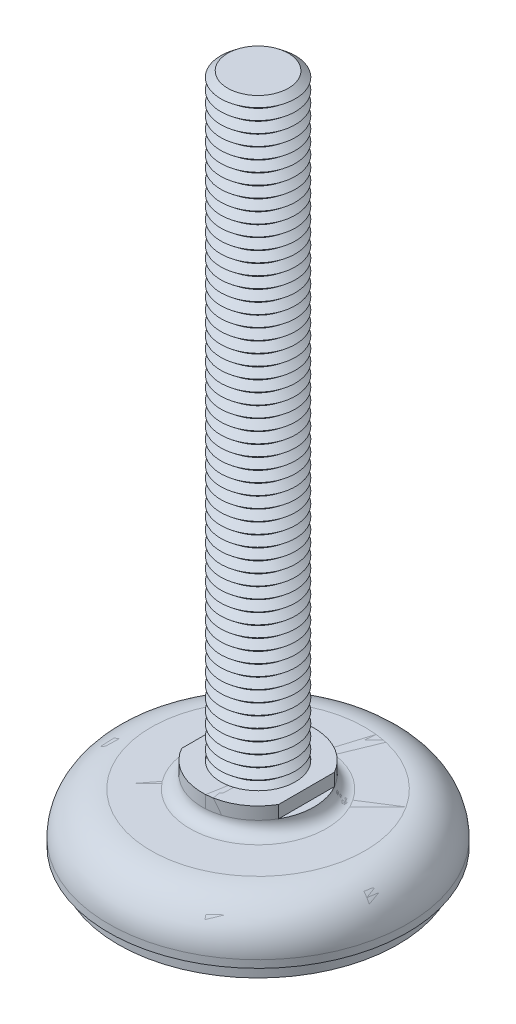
ISO-10303-21;
HEADER;
FILE_DESCRIPTION(('STEP AP214'),'2;1');
FILE_NAME('part.step','',(''),(''),'','','');
FILE_SCHEMA(('AUTOMOTIVE_DESIGN { 1 0 10303 214 1 1 1 1 }'));
ENDSEC;
DATA;
#1=APPLICATION_CONTEXT('core data for automotive mechanical design processes');
#2=APPLICATION_PROTOCOL_DEFINITION('international standard','automotive_design',2000,#1);
#3=PRODUCT_CONTEXT('',#1,'mechanical');
#4=PRODUCT('Part','Part','',(#3));
#5=PRODUCT_RELATED_PRODUCT_CATEGORY('part','',(#4));
#6=PRODUCT_DEFINITION_FORMATION('','',#4);
#7=PRODUCT_DEFINITION_CONTEXT('part definition',#1,'design');
#8=PRODUCT_DEFINITION('design','',#6,#7);
#9=PRODUCT_DEFINITION_SHAPE('','',#8);
#10=(LENGTH_UNIT() NAMED_UNIT(*) SI_UNIT(.MILLI.,.METRE.));
#11=(NAMED_UNIT(*) PLANE_ANGLE_UNIT() SI_UNIT($,.RADIAN.));
#12=(NAMED_UNIT(*) SI_UNIT($,.STERADIAN.) SOLID_ANGLE_UNIT());
#13=UNCERTAINTY_MEASURE_WITH_UNIT(LENGTH_MEASURE(1.E-05),#10,'distance_accuracy_value','');
#14=(GEOMETRIC_REPRESENTATION_CONTEXT(3) GLOBAL_UNCERTAINTY_ASSIGNED_CONTEXT((#13)) GLOBAL_UNIT_ASSIGNED_CONTEXT((#10,
#11,#12)) REPRESENTATION_CONTEXT('',''));
#15=CARTESIAN_POINT('',(0.,0.,0.));
#16=DIRECTION('',(0.,0.,1.));
#17=DIRECTION('',(1.,0.,0.));
#18=AXIS2_PLACEMENT_3D('',#15,#16,#17);
#19=CARTESIAN_POINT('',(0.,87.5,0.));
#20=DIRECTION('',(0.,-1.,0.));
#21=DIRECTION('',(0.998136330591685,0.,-0.0610234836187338));
#22=AXIS2_PLACEMENT_3D('',#19,#20,#21);
#23=CONICAL_SURFACE('',#22,4.06325030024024,0.895664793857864);
#24=CARTESIAN_POINT('',(0.,86.75,0.));
#25=DIRECTION('',(0.,-1.,0.));
#26=DIRECTION('',(0.998136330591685,0.,-0.0610234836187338));
#27=AXIS2_PLACEMENT_3D('',#24,#25,#26);
#28=CIRCLE('',#27,5.);
#29=CARTESIAN_POINT('',(4.99068165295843,86.75,-0.305117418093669));
#30=VERTEX_POINT('',#29);
#31=EDGE_CURVE('P0_E37',#30,#30,#28,.T.);
#32=ORIENTED_EDGE('',*,*,#31,.F.);
#33=EDGE_LOOP('',(#32));
#34=FACE_BOUND('',#33,.T.);
#35=CARTESIAN_POINT('',(0.,87.5,0.));
#36=DIRECTION('',(0.,-1.,0.));
#37=DIRECTION('',(0.998136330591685,0.,-0.0610234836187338));
#38=AXIS2_PLACEMENT_3D('',#35,#36,#37);
#39=CIRCLE('',#38,4.06325030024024);
#40=CARTESIAN_POINT('',(4.05567774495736,87.5,-0.247953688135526));
#41=VERTEX_POINT('',#40);
#42=EDGE_CURVE('P0_E25',#41,#41,#39,.T.);
#43=ORIENTED_EDGE('',*,*,#42,.T.);
#44=EDGE_LOOP('',(#43));
#45=FACE_BOUND('',#44,.T.);
#46=ADVANCED_FACE('P0_F14',(#34,#45),#23,.T.);
#47=CARTESIAN_POINT('',(0.,88.25,0.));
#48=DIRECTION('',(0.,1.,0.));
#49=DIRECTION('',(-0.998136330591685,0.,0.0610234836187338));
#50=AXIS2_PLACEMENT_3D('',#47,#48,#49);
#51=CONICAL_SURFACE('',#50,5.,0.895664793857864);
#52=ORIENTED_EDGE('',*,*,#42,.F.);
#53=EDGE_LOOP('',(#52));
#54=FACE_BOUND('',#53,.T.);
#55=CARTESIAN_POINT('',(0.,88.25,0.));
#56=DIRECTION('',(0.,-1.,0.));
#57=DIRECTION('',(0.998136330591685,0.,-0.0610234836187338));
#58=AXIS2_PLACEMENT_3D('',#55,#56,#57);
#59=CIRCLE('',#58,5.);
#60=CARTESIAN_POINT('',(4.99068165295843,88.25,-0.305117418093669));
#61=VERTEX_POINT('',#60);
#62=EDGE_CURVE('P0_E29',#61,#61,#59,.T.);
#63=ORIENTED_EDGE('',*,*,#62,.T.);
#64=EDGE_LOOP('',(#63));
#65=FACE_BOUND('',#64,.T.);
#66=ADVANCED_FACE('P0_F1033',(#54,#65),#51,.T.);
#67=CARTESIAN_POINT('',(0.,89.,0.));
#68=DIRECTION('',(0.,1.,0.));
#69=DIRECTION('',(-0.998136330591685,0.,0.0610234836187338));
#70=AXIS2_PLACEMENT_3D('',#67,#68,#69);
#71=PLANE('',#70);
#72=CARTESIAN_POINT('',(0.,89.,0.));
#73=DIRECTION('',(0.,-1.,0.));
#74=DIRECTION('',(0.998136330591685,0.,-0.0610234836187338));
#75=AXIS2_PLACEMENT_3D('',#72,#73,#74);
#76=CIRCLE('',#75,4.06325030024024);
#77=CARTESIAN_POINT('',(4.05567774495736,89.,-0.247953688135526));
#78=VERTEX_POINT('',#77);
#79=EDGE_CURVE('P0_E21',#78,#78,#76,.T.);
#80=ORIENTED_EDGE('',*,*,#79,.F.);
#81=EDGE_LOOP('',(#80));
#82=FACE_BOUND('',#81,.T.);
#83=ADVANCED_FACE('P0_F1039',(#82),#71,.T.);
#84=CARTESIAN_POINT('',(0.,89.,0.));
#85=DIRECTION('',(0.,-1.,0.));
#86=DIRECTION('',(0.998136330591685,0.,-0.0610234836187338));
#87=AXIS2_PLACEMENT_3D('',#84,#85,#86);
#88=CONICAL_SURFACE('',#87,4.06325030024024,0.895664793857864);
#89=ORIENTED_EDGE('',*,*,#62,.F.);
#90=EDGE_LOOP('',(#89));
#91=FACE_BOUND('',#90,.T.);
#92=ORIENTED_EDGE('',*,*,#79,.T.);
#93=EDGE_LOOP('',(#92));
#94=FACE_BOUND('',#93,.T.);
#95=ADVANCED_FACE('P0_F1022',(#91,#94),#88,.T.);
#96=CARTESIAN_POINT('',(0.,86.,0.));
#97=DIRECTION('',(0.,-1.,0.));
#98=DIRECTION('',(0.998136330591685,0.,-0.0610234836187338));
#99=AXIS2_PLACEMENT_3D('',#96,#97,#98);
#100=CONICAL_SURFACE('',#99,4.06325030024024,0.895664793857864);
#101=CARTESIAN_POINT('',(0.,85.25,0.));
#102=DIRECTION('',(0.,-1.,0.));
#103=DIRECTION('',(0.998136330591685,0.,-0.0610234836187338));
#104=AXIS2_PLACEMENT_3D('',#101,#102,#103);
#105=CIRCLE('',#104,5.);
#106=CARTESIAN_POINT('',(4.99068165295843,85.25,-0.305117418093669));
#107=VERTEX_POINT('',#106);
#108=EDGE_CURVE('P0_E43',#107,#107,#105,.T.);
#109=ORIENTED_EDGE('',*,*,#108,.F.);
#110=EDGE_LOOP('',(#109));
#111=FACE_BOUND('',#110,.T.);
#112=CARTESIAN_POINT('',(0.,86.,0.));
#113=DIRECTION('',(0.,-1.,0.));
#114=DIRECTION('',(0.998136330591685,0.,-0.0610234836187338));
#115=AXIS2_PLACEMENT_3D('',#112,#113,#114);
#116=CIRCLE('',#115,4.06325030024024);
#117=CARTESIAN_POINT('',(4.05567774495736,86.,-0.247953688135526));
#118=VERTEX_POINT('',#117);
#119=EDGE_CURVE('P0_E34',#118,#118,#116,.T.);
#120=ORIENTED_EDGE('',*,*,#119,.T.);
#121=EDGE_LOOP('',(#120));
#122=FACE_BOUND('',#121,.T.);
#123=ADVANCED_FACE('P0_F1019',(#111,#122),#100,.T.);
#124=CARTESIAN_POINT('',(0.,86.75,0.));
#125=DIRECTION('',(0.,1.,0.));
#126=DIRECTION('',(-0.998136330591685,0.,0.0610234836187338));
#127=AXIS2_PLACEMENT_3D('',#124,#125,#126);
#128=CONICAL_SURFACE('',#127,5.,0.895664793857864);
#129=ORIENTED_EDGE('',*,*,#119,.F.);
#130=EDGE_LOOP('',(#129));
#131=FACE_BOUND('',#130,.T.);
#132=ORIENTED_EDGE('',*,*,#31,.T.);
#133=EDGE_LOOP('',(#132));
#134=FACE_BOUND('',#133,.T.);
#135=ADVANCED_FACE('P0_F1010',(#131,#134),#128,.T.);
#136=CARTESIAN_POINT('',(0.,84.5,0.));
#137=DIRECTION('',(0.,-1.,0.));
#138=DIRECTION('',(0.998136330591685,0.,-0.0610234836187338));
#139=AXIS2_PLACEMENT_3D('',#136,#137,#138);
#140=CONICAL_SURFACE('',#139,4.06325030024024,0.895664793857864);
#141=CARTESIAN_POINT('',(0.,83.75,0.));
#142=DIRECTION('',(0.,-1.,0.));
#143=DIRECTION('',(0.998136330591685,0.,-0.0610234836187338));
#144=AXIS2_PLACEMENT_3D('',#141,#142,#143);
#145=CIRCLE('',#144,5.);
#146=CARTESIAN_POINT('',(4.99068165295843,83.75,-0.305117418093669));
#147=VERTEX_POINT('',#146);
#148=EDGE_CURVE('P0_E49',#147,#147,#145,.T.);
#149=ORIENTED_EDGE('',*,*,#148,.F.);
#150=EDGE_LOOP('',(#149));
#151=FACE_BOUND('',#150,.T.);
#152=CARTESIAN_POINT('',(0.,84.5,0.));
#153=DIRECTION('',(0.,-1.,0.));
#154=DIRECTION('',(0.998136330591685,0.,-0.0610234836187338));
#155=AXIS2_PLACEMENT_3D('',#152,#153,#154);
#156=CIRCLE('',#155,4.06325030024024);
#157=CARTESIAN_POINT('',(4.05567774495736,84.5,-0.247953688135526));
#158=VERTEX_POINT('',#157);
#159=EDGE_CURVE('P0_E40',#158,#158,#156,.T.);
#160=ORIENTED_EDGE('',*,*,#159,.T.);
#161=EDGE_LOOP('',(#160));
#162=FACE_BOUND('',#161,.T.);
#163=ADVANCED_FACE('P0_F1007',(#151,#162),#140,.T.);
#164=CARTESIAN_POINT('',(0.,85.25,0.));
#165=DIRECTION('',(0.,1.,0.));
#166=DIRECTION('',(-0.998136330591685,0.,0.0610234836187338));
#167=AXIS2_PLACEMENT_3D('',#164,#165,#166);
#168=CONICAL_SURFACE('',#167,5.,0.895664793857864);
#169=ORIENTED_EDGE('',*,*,#159,.F.);
#170=EDGE_LOOP('',(#169));
#171=FACE_BOUND('',#170,.T.);
#172=ORIENTED_EDGE('',*,*,#108,.T.);
#173=EDGE_LOOP('',(#172));
#174=FACE_BOUND('',#173,.T.);
#175=ADVANCED_FACE('P0_F998',(#171,#174),#168,.T.);
#176=CARTESIAN_POINT('',(0.,83.,0.));
#177=DIRECTION('',(0.,-1.,0.));
#178=DIRECTION('',(0.998136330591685,0.,-0.0610234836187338));
#179=AXIS2_PLACEMENT_3D('',#176,#177,#178);
#180=CONICAL_SURFACE('',#179,4.06325030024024,0.895664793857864);
#181=CARTESIAN_POINT('',(0.,82.25,0.));
#182=DIRECTION('',(0.,-1.,0.));
#183=DIRECTION('',(0.998136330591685,0.,-0.0610234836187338));
#184=AXIS2_PLACEMENT_3D('',#181,#182,#183);
#185=CIRCLE('',#184,5.);
#186=CARTESIAN_POINT('',(4.99068165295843,82.25,-0.305117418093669));
#187=VERTEX_POINT('',#186);
#188=EDGE_CURVE('P0_E55',#187,#187,#185,.T.);
#189=ORIENTED_EDGE('',*,*,#188,.F.);
#190=EDGE_LOOP('',(#189));
#191=FACE_BOUND('',#190,.T.);
#192=CARTESIAN_POINT('',(0.,83.,0.));
#193=DIRECTION('',(0.,-1.,0.));
#194=DIRECTION('',(0.998136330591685,0.,-0.0610234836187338));
#195=AXIS2_PLACEMENT_3D('',#192,#193,#194);
#196=CIRCLE('',#195,4.06325030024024);
#197=CARTESIAN_POINT('',(4.05567774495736,83.,-0.247953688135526));
#198=VERTEX_POINT('',#197);
#199=EDGE_CURVE('P0_E46',#198,#198,#196,.T.);
#200=ORIENTED_EDGE('',*,*,#199,.T.);
#201=EDGE_LOOP('',(#200));
#202=FACE_BOUND('',#201,.T.);
#203=ADVANCED_FACE('P0_F995',(#191,#202),#180,.T.);
#204=CARTESIAN_POINT('',(0.,83.75,0.));
#205=DIRECTION('',(0.,1.,0.));
#206=DIRECTION('',(-0.998136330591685,0.,0.0610234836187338));
#207=AXIS2_PLACEMENT_3D('',#204,#205,#206);
#208=CONICAL_SURFACE('',#207,5.,0.895664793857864);
#209=ORIENTED_EDGE('',*,*,#199,.F.);
#210=EDGE_LOOP('',(#209));
#211=FACE_BOUND('',#210,.T.);
#212=ORIENTED_EDGE('',*,*,#148,.T.);
#213=EDGE_LOOP('',(#212));
#214=FACE_BOUND('',#213,.T.);
#215=ADVANCED_FACE('P0_F986',(#211,#214),#208,.T.);
#216=CARTESIAN_POINT('',(0.,81.5,0.));
#217=DIRECTION('',(0.,-1.,0.));
#218=DIRECTION('',(0.998136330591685,0.,-0.0610234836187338));
#219=AXIS2_PLACEMENT_3D('',#216,#217,#218);
#220=CONICAL_SURFACE('',#219,4.06325030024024,0.895664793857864);
#221=CARTESIAN_POINT('',(0.,80.75,0.));
#222=DIRECTION('',(0.,-1.,0.));
#223=DIRECTION('',(0.998136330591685,0.,-0.0610234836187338));
#224=AXIS2_PLACEMENT_3D('',#221,#222,#223);
#225=CIRCLE('',#224,5.);
#226=CARTESIAN_POINT('',(4.99068165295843,80.75,-0.305117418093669));
#227=VERTEX_POINT('',#226);
#228=EDGE_CURVE('P0_E61',#227,#227,#225,.T.);
#229=ORIENTED_EDGE('',*,*,#228,.F.);
#230=EDGE_LOOP('',(#229));
#231=FACE_BOUND('',#230,.T.);
#232=CARTESIAN_POINT('',(0.,81.5,0.));
#233=DIRECTION('',(0.,-1.,0.));
#234=DIRECTION('',(0.998136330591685,0.,-0.0610234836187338));
#235=AXIS2_PLACEMENT_3D('',#232,#233,#234);
#236=CIRCLE('',#235,4.06325030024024);
#237=CARTESIAN_POINT('',(4.05567774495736,81.5,-0.247953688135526));
#238=VERTEX_POINT('',#237);
#239=EDGE_CURVE('P0_E52',#238,#238,#236,.T.);
#240=ORIENTED_EDGE('',*,*,#239,.T.);
#241=EDGE_LOOP('',(#240));
#242=FACE_BOUND('',#241,.T.);
#243=ADVANCED_FACE('P0_F983',(#231,#242),#220,.T.);
#244=CARTESIAN_POINT('',(0.,82.25,0.));
#245=DIRECTION('',(0.,1.,0.));
#246=DIRECTION('',(-0.998136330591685,0.,0.0610234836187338));
#247=AXIS2_PLACEMENT_3D('',#244,#245,#246);
#248=CONICAL_SURFACE('',#247,5.,0.895664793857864);
#249=ORIENTED_EDGE('',*,*,#239,.F.);
#250=EDGE_LOOP('',(#249));
#251=FACE_BOUND('',#250,.T.);
#252=ORIENTED_EDGE('',*,*,#188,.T.);
#253=EDGE_LOOP('',(#252));
#254=FACE_BOUND('',#253,.T.);
#255=ADVANCED_FACE('P0_F974',(#251,#254),#248,.T.);
#256=CARTESIAN_POINT('',(0.,80.,0.));
#257=DIRECTION('',(0.,-1.,0.));
#258=DIRECTION('',(0.998136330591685,0.,-0.0610234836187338));
#259=AXIS2_PLACEMENT_3D('',#256,#257,#258);
#260=CONICAL_SURFACE('',#259,4.06325030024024,0.895664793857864);
#261=CARTESIAN_POINT('',(0.,79.25,0.));
#262=DIRECTION('',(0.,-1.,0.));
#263=DIRECTION('',(0.998136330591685,0.,-0.0610234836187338));
#264=AXIS2_PLACEMENT_3D('',#261,#262,#263);
#265=CIRCLE('',#264,5.);
#266=CARTESIAN_POINT('',(4.99068165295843,79.25,-0.305117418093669));
#267=VERTEX_POINT('',#266);
#268=EDGE_CURVE('P0_E67',#267,#267,#265,.T.);
#269=ORIENTED_EDGE('',*,*,#268,.F.);
#270=EDGE_LOOP('',(#269));
#271=FACE_BOUND('',#270,.T.);
#272=CARTESIAN_POINT('',(0.,80.,0.));
#273=DIRECTION('',(0.,-1.,0.));
#274=DIRECTION('',(0.998136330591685,0.,-0.0610234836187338));
#275=AXIS2_PLACEMENT_3D('',#272,#273,#274);
#276=CIRCLE('',#275,4.06325030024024);
#277=CARTESIAN_POINT('',(4.05567774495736,80.,-0.247953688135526));
#278=VERTEX_POINT('',#277);
#279=EDGE_CURVE('P0_E58',#278,#278,#276,.T.);
#280=ORIENTED_EDGE('',*,*,#279,.T.);
#281=EDGE_LOOP('',(#280));
#282=FACE_BOUND('',#281,.T.);
#283=ADVANCED_FACE('P0_F971',(#271,#282),#260,.T.);
#284=CARTESIAN_POINT('',(0.,80.75,0.));
#285=DIRECTION('',(0.,1.,0.));
#286=DIRECTION('',(-0.998136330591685,0.,0.0610234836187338));
#287=AXIS2_PLACEMENT_3D('',#284,#285,#286);
#288=CONICAL_SURFACE('',#287,5.,0.895664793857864);
#289=ORIENTED_EDGE('',*,*,#279,.F.);
#290=EDGE_LOOP('',(#289));
#291=FACE_BOUND('',#290,.T.);
#292=ORIENTED_EDGE('',*,*,#228,.T.);
#293=EDGE_LOOP('',(#292));
#294=FACE_BOUND('',#293,.T.);
#295=ADVANCED_FACE('P0_F962',(#291,#294),#288,.T.);
#296=CARTESIAN_POINT('',(0.,78.5,0.));
#297=DIRECTION('',(0.,-1.,0.));
#298=DIRECTION('',(0.998136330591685,0.,-0.0610234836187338));
#299=AXIS2_PLACEMENT_3D('',#296,#297,#298);
#300=CONICAL_SURFACE('',#299,4.06325030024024,0.895664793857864);
#301=CARTESIAN_POINT('',(0.,77.75,0.));
#302=DIRECTION('',(0.,-1.,0.));
#303=DIRECTION('',(0.998136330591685,0.,-0.0610234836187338));
#304=AXIS2_PLACEMENT_3D('',#301,#302,#303);
#305=CIRCLE('',#304,5.);
#306=CARTESIAN_POINT('',(4.99068165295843,77.75,-0.305117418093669));
#307=VERTEX_POINT('',#306);
#308=EDGE_CURVE('P0_E73',#307,#307,#305,.T.);
#309=ORIENTED_EDGE('',*,*,#308,.F.);
#310=EDGE_LOOP('',(#309));
#311=FACE_BOUND('',#310,.T.);
#312=CARTESIAN_POINT('',(0.,78.5,0.));
#313=DIRECTION('',(0.,-1.,0.));
#314=DIRECTION('',(0.998136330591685,0.,-0.0610234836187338));
#315=AXIS2_PLACEMENT_3D('',#312,#313,#314);
#316=CIRCLE('',#315,4.06325030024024);
#317=CARTESIAN_POINT('',(4.05567774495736,78.5,-0.247953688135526));
#318=VERTEX_POINT('',#317);
#319=EDGE_CURVE('P0_E64',#318,#318,#316,.T.);
#320=ORIENTED_EDGE('',*,*,#319,.T.);
#321=EDGE_LOOP('',(#320));
#322=FACE_BOUND('',#321,.T.);
#323=ADVANCED_FACE('P0_F959',(#311,#322),#300,.T.);
#324=CARTESIAN_POINT('',(0.,79.25,0.));
#325=DIRECTION('',(0.,1.,0.));
#326=DIRECTION('',(-0.998136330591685,0.,0.0610234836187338));
#327=AXIS2_PLACEMENT_3D('',#324,#325,#326);
#328=CONICAL_SURFACE('',#327,5.,0.895664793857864);
#329=ORIENTED_EDGE('',*,*,#319,.F.);
#330=EDGE_LOOP('',(#329));
#331=FACE_BOUND('',#330,.T.);
#332=ORIENTED_EDGE('',*,*,#268,.T.);
#333=EDGE_LOOP('',(#332));
#334=FACE_BOUND('',#333,.T.);
#335=ADVANCED_FACE('P0_F950',(#331,#334),#328,.T.);
#336=CARTESIAN_POINT('',(0.,77.,0.));
#337=DIRECTION('',(0.,-1.,0.));
#338=DIRECTION('',(0.998136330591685,0.,-0.0610234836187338));
#339=AXIS2_PLACEMENT_3D('',#336,#337,#338);
#340=CONICAL_SURFACE('',#339,4.06325030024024,0.895664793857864);
#341=CARTESIAN_POINT('',(0.,76.25,0.));
#342=DIRECTION('',(0.,-1.,0.));
#343=DIRECTION('',(0.998136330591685,0.,-0.0610234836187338));
#344=AXIS2_PLACEMENT_3D('',#341,#342,#343);
#345=CIRCLE('',#344,5.);
#346=CARTESIAN_POINT('',(4.99068165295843,76.25,-0.305117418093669));
#347=VERTEX_POINT('',#346);
#348=EDGE_CURVE('P0_E79',#347,#347,#345,.T.);
#349=ORIENTED_EDGE('',*,*,#348,.F.);
#350=EDGE_LOOP('',(#349));
#351=FACE_BOUND('',#350,.T.);
#352=CARTESIAN_POINT('',(0.,77.,0.));
#353=DIRECTION('',(0.,-1.,0.));
#354=DIRECTION('',(0.998136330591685,0.,-0.0610234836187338));
#355=AXIS2_PLACEMENT_3D('',#352,#353,#354);
#356=CIRCLE('',#355,4.06325030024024);
#357=CARTESIAN_POINT('',(4.05567774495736,77.,-0.247953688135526));
#358=VERTEX_POINT('',#357);
#359=EDGE_CURVE('P0_E70',#358,#358,#356,.T.);
#360=ORIENTED_EDGE('',*,*,#359,.T.);
#361=EDGE_LOOP('',(#360));
#362=FACE_BOUND('',#361,.T.);
#363=ADVANCED_FACE('P0_F947',(#351,#362),#340,.T.);
#364=CARTESIAN_POINT('',(0.,77.75,0.));
#365=DIRECTION('',(0.,1.,0.));
#366=DIRECTION('',(-0.998136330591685,0.,0.0610234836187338));
#367=AXIS2_PLACEMENT_3D('',#364,#365,#366);
#368=CONICAL_SURFACE('',#367,5.,0.895664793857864);
#369=ORIENTED_EDGE('',*,*,#359,.F.);
#370=EDGE_LOOP('',(#369));
#371=FACE_BOUND('',#370,.T.);
#372=ORIENTED_EDGE('',*,*,#308,.T.);
#373=EDGE_LOOP('',(#372));
#374=FACE_BOUND('',#373,.T.);
#375=ADVANCED_FACE('P0_F938',(#371,#374),#368,.T.);
#376=CARTESIAN_POINT('',(0.,75.5,0.));
#377=DIRECTION('',(0.,-1.,0.));
#378=DIRECTION('',(0.998136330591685,0.,-0.0610234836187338));
#379=AXIS2_PLACEMENT_3D('',#376,#377,#378);
#380=CONICAL_SURFACE('',#379,4.06325030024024,0.895664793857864);
#381=CARTESIAN_POINT('',(0.,74.75,0.));
#382=DIRECTION('',(0.,-1.,0.));
#383=DIRECTION('',(0.998136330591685,0.,-0.0610234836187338));
#384=AXIS2_PLACEMENT_3D('',#381,#382,#383);
#385=CIRCLE('',#384,5.);
#386=CARTESIAN_POINT('',(4.99068165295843,74.75,-0.305117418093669));
#387=VERTEX_POINT('',#386);
#388=EDGE_CURVE('P0_E85',#387,#387,#385,.T.);
#389=ORIENTED_EDGE('',*,*,#388,.F.);
#390=EDGE_LOOP('',(#389));
#391=FACE_BOUND('',#390,.T.);
#392=CARTESIAN_POINT('',(0.,75.5,0.));
#393=DIRECTION('',(0.,-1.,0.));
#394=DIRECTION('',(0.998136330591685,0.,-0.0610234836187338));
#395=AXIS2_PLACEMENT_3D('',#392,#393,#394);
#396=CIRCLE('',#395,4.06325030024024);
#397=CARTESIAN_POINT('',(4.05567774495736,75.5,-0.247953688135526));
#398=VERTEX_POINT('',#397);
#399=EDGE_CURVE('P0_E76',#398,#398,#396,.T.);
#400=ORIENTED_EDGE('',*,*,#399,.T.);
#401=EDGE_LOOP('',(#400));
#402=FACE_BOUND('',#401,.T.);
#403=ADVANCED_FACE('P0_F935',(#391,#402),#380,.T.);
#404=CARTESIAN_POINT('',(0.,76.25,0.));
#405=DIRECTION('',(0.,1.,0.));
#406=DIRECTION('',(-0.998136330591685,0.,0.0610234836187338));
#407=AXIS2_PLACEMENT_3D('',#404,#405,#406);
#408=CONICAL_SURFACE('',#407,5.,0.895664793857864);
#409=ORIENTED_EDGE('',*,*,#399,.F.);
#410=EDGE_LOOP('',(#409));
#411=FACE_BOUND('',#410,.T.);
#412=ORIENTED_EDGE('',*,*,#348,.T.);
#413=EDGE_LOOP('',(#412));
#414=FACE_BOUND('',#413,.T.);
#415=ADVANCED_FACE('P0_F926',(#411,#414),#408,.T.);
#416=CARTESIAN_POINT('',(0.,74.,0.));
#417=DIRECTION('',(0.,-1.,0.));
#418=DIRECTION('',(0.998136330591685,0.,-0.0610234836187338));
#419=AXIS2_PLACEMENT_3D('',#416,#417,#418);
#420=CONICAL_SURFACE('',#419,4.06325030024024,0.895664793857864);
#421=CARTESIAN_POINT('',(0.,73.25,0.));
#422=DIRECTION('',(0.,-1.,0.));
#423=DIRECTION('',(0.998136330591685,0.,-0.0610234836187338));
#424=AXIS2_PLACEMENT_3D('',#421,#422,#423);
#425=CIRCLE('',#424,5.);
#426=CARTESIAN_POINT('',(4.99068165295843,73.25,-0.305117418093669));
#427=VERTEX_POINT('',#426);
#428=EDGE_CURVE('P0_E91',#427,#427,#425,.T.);
#429=ORIENTED_EDGE('',*,*,#428,.F.);
#430=EDGE_LOOP('',(#429));
#431=FACE_BOUND('',#430,.T.);
#432=CARTESIAN_POINT('',(0.,74.,0.));
#433=DIRECTION('',(0.,-1.,0.));
#434=DIRECTION('',(0.998136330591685,0.,-0.0610234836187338));
#435=AXIS2_PLACEMENT_3D('',#432,#433,#434);
#436=CIRCLE('',#435,4.06325030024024);
#437=CARTESIAN_POINT('',(4.05567774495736,74.,-0.247953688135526));
#438=VERTEX_POINT('',#437);
#439=EDGE_CURVE('P0_E82',#438,#438,#436,.T.);
#440=ORIENTED_EDGE('',*,*,#439,.T.);
#441=EDGE_LOOP('',(#440));
#442=FACE_BOUND('',#441,.T.);
#443=ADVANCED_FACE('P0_F923',(#431,#442),#420,.T.);
#444=CARTESIAN_POINT('',(0.,74.75,0.));
#445=DIRECTION('',(0.,1.,0.));
#446=DIRECTION('',(-0.998136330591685,0.,0.0610234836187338));
#447=AXIS2_PLACEMENT_3D('',#444,#445,#446);
#448=CONICAL_SURFACE('',#447,5.,0.895664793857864);
#449=ORIENTED_EDGE('',*,*,#439,.F.);
#450=EDGE_LOOP('',(#449));
#451=FACE_BOUND('',#450,.T.);
#452=ORIENTED_EDGE('',*,*,#388,.T.);
#453=EDGE_LOOP('',(#452));
#454=FACE_BOUND('',#453,.T.);
#455=ADVANCED_FACE('P0_F914',(#451,#454),#448,.T.);
#456=CARTESIAN_POINT('',(0.,72.5,0.));
#457=DIRECTION('',(0.,-1.,0.));
#458=DIRECTION('',(0.998136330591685,0.,-0.0610234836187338));
#459=AXIS2_PLACEMENT_3D('',#456,#457,#458);
#460=CONICAL_SURFACE('',#459,4.06325030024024,0.895664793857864);
#461=CARTESIAN_POINT('',(0.,71.75,0.));
#462=DIRECTION('',(0.,-1.,0.));
#463=DIRECTION('',(0.998136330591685,0.,-0.0610234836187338));
#464=AXIS2_PLACEMENT_3D('',#461,#462,#463);
#465=CIRCLE('',#464,5.);
#466=CARTESIAN_POINT('',(4.99068165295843,71.75,-0.305117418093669));
#467=VERTEX_POINT('',#466);
#468=EDGE_CURVE('P0_E97',#467,#467,#465,.T.);
#469=ORIENTED_EDGE('',*,*,#468,.F.);
#470=EDGE_LOOP('',(#469));
#471=FACE_BOUND('',#470,.T.);
#472=CARTESIAN_POINT('',(0.,72.5,0.));
#473=DIRECTION('',(0.,-1.,0.));
#474=DIRECTION('',(0.998136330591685,0.,-0.0610234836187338));
#475=AXIS2_PLACEMENT_3D('',#472,#473,#474);
#476=CIRCLE('',#475,4.06325030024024);
#477=CARTESIAN_POINT('',(4.05567774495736,72.5,-0.247953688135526));
#478=VERTEX_POINT('',#477);
#479=EDGE_CURVE('P0_E88',#478,#478,#476,.T.);
#480=ORIENTED_EDGE('',*,*,#479,.T.);
#481=EDGE_LOOP('',(#480));
#482=FACE_BOUND('',#481,.T.);
#483=ADVANCED_FACE('P0_F911',(#471,#482),#460,.T.);
#484=CARTESIAN_POINT('',(0.,73.25,0.));
#485=DIRECTION('',(0.,1.,0.));
#486=DIRECTION('',(-0.998136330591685,0.,0.0610234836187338));
#487=AXIS2_PLACEMENT_3D('',#484,#485,#486);
#488=CONICAL_SURFACE('',#487,5.,0.895664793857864);
#489=ORIENTED_EDGE('',*,*,#479,.F.);
#490=EDGE_LOOP('',(#489));
#491=FACE_BOUND('',#490,.T.);
#492=ORIENTED_EDGE('',*,*,#428,.T.);
#493=EDGE_LOOP('',(#492));
#494=FACE_BOUND('',#493,.T.);
#495=ADVANCED_FACE('P0_F902',(#491,#494),#488,.T.);
#496=CARTESIAN_POINT('',(0.,71.,0.));
#497=DIRECTION('',(0.,-1.,0.));
#498=DIRECTION('',(0.998136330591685,0.,-0.0610234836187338));
#499=AXIS2_PLACEMENT_3D('',#496,#497,#498);
#500=CONICAL_SURFACE('',#499,4.06325030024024,0.895664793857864);
#501=CARTESIAN_POINT('',(0.,70.25,0.));
#502=DIRECTION('',(0.,-1.,0.));
#503=DIRECTION('',(0.998136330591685,0.,-0.0610234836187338));
#504=AXIS2_PLACEMENT_3D('',#501,#502,#503);
#505=CIRCLE('',#504,5.);
#506=CARTESIAN_POINT('',(4.99068165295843,70.25,-0.305117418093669));
#507=VERTEX_POINT('',#506);
#508=EDGE_CURVE('P0_E103',#507,#507,#505,.T.);
#509=ORIENTED_EDGE('',*,*,#508,.F.);
#510=EDGE_LOOP('',(#509));
#511=FACE_BOUND('',#510,.T.);
#512=CARTESIAN_POINT('',(0.,71.,0.));
#513=DIRECTION('',(0.,-1.,0.));
#514=DIRECTION('',(0.998136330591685,0.,-0.0610234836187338));
#515=AXIS2_PLACEMENT_3D('',#512,#513,#514);
#516=CIRCLE('',#515,4.06325030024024);
#517=CARTESIAN_POINT('',(4.05567774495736,71.,-0.247953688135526));
#518=VERTEX_POINT('',#517);
#519=EDGE_CURVE('P0_E94',#518,#518,#516,.T.);
#520=ORIENTED_EDGE('',*,*,#519,.T.);
#521=EDGE_LOOP('',(#520));
#522=FACE_BOUND('',#521,.T.);
#523=ADVANCED_FACE('P0_F899',(#511,#522),#500,.T.);
#524=CARTESIAN_POINT('',(0.,71.75,0.));
#525=DIRECTION('',(0.,1.,0.));
#526=DIRECTION('',(-0.998136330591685,0.,0.0610234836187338));
#527=AXIS2_PLACEMENT_3D('',#524,#525,#526);
#528=CONICAL_SURFACE('',#527,5.,0.895664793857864);
#529=ORIENTED_EDGE('',*,*,#519,.F.);
#530=EDGE_LOOP('',(#529));
#531=FACE_BOUND('',#530,.T.);
#532=ORIENTED_EDGE('',*,*,#468,.T.);
#533=EDGE_LOOP('',(#532));
#534=FACE_BOUND('',#533,.T.);
#535=ADVANCED_FACE('P0_F890',(#531,#534),#528,.T.);
#536=CARTESIAN_POINT('',(0.,69.5,0.));
#537=DIRECTION('',(0.,-1.,0.));
#538=DIRECTION('',(0.998136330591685,0.,-0.0610234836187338));
#539=AXIS2_PLACEMENT_3D('',#536,#537,#538);
#540=CONICAL_SURFACE('',#539,4.06325030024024,0.895664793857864);
#541=CARTESIAN_POINT('',(0.,68.75,0.));
#542=DIRECTION('',(0.,-1.,0.));
#543=DIRECTION('',(0.998136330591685,0.,-0.0610234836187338));
#544=AXIS2_PLACEMENT_3D('',#541,#542,#543);
#545=CIRCLE('',#544,5.);
#546=CARTESIAN_POINT('',(4.99068165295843,68.75,-0.305117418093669));
#547=VERTEX_POINT('',#546);
#548=EDGE_CURVE('P0_E109',#547,#547,#545,.T.);
#549=ORIENTED_EDGE('',*,*,#548,.F.);
#550=EDGE_LOOP('',(#549));
#551=FACE_BOUND('',#550,.T.);
#552=CARTESIAN_POINT('',(0.,69.5,0.));
#553=DIRECTION('',(0.,-1.,0.));
#554=DIRECTION('',(0.998136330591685,0.,-0.0610234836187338));
#555=AXIS2_PLACEMENT_3D('',#552,#553,#554);
#556=CIRCLE('',#555,4.06325030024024);
#557=CARTESIAN_POINT('',(4.05567774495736,69.5,-0.247953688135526));
#558=VERTEX_POINT('',#557);
#559=EDGE_CURVE('P0_E100',#558,#558,#556,.T.);
#560=ORIENTED_EDGE('',*,*,#559,.T.);
#561=EDGE_LOOP('',(#560));
#562=FACE_BOUND('',#561,.T.);
#563=ADVANCED_FACE('P0_F887',(#551,#562),#540,.T.);
#564=CARTESIAN_POINT('',(0.,70.25,0.));
#565=DIRECTION('',(0.,1.,0.));
#566=DIRECTION('',(-0.998136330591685,0.,0.0610234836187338));
#567=AXIS2_PLACEMENT_3D('',#564,#565,#566);
#568=CONICAL_SURFACE('',#567,5.,0.895664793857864);
#569=ORIENTED_EDGE('',*,*,#559,.F.);
#570=EDGE_LOOP('',(#569));
#571=FACE_BOUND('',#570,.T.);
#572=ORIENTED_EDGE('',*,*,#508,.T.);
#573=EDGE_LOOP('',(#572));
#574=FACE_BOUND('',#573,.T.);
#575=ADVANCED_FACE('P0_F878',(#571,#574),#568,.T.);
#576=CARTESIAN_POINT('',(0.,68.,0.));
#577=DIRECTION('',(0.,-1.,0.));
#578=DIRECTION('',(0.998136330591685,0.,-0.0610234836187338));
#579=AXIS2_PLACEMENT_3D('',#576,#577,#578);
#580=CONICAL_SURFACE('',#579,4.06325030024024,0.895664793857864);
#581=CARTESIAN_POINT('',(0.,67.25,0.));
#582=DIRECTION('',(0.,-1.,0.));
#583=DIRECTION('',(0.998136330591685,0.,-0.0610234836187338));
#584=AXIS2_PLACEMENT_3D('',#581,#582,#583);
#585=CIRCLE('',#584,5.);
#586=CARTESIAN_POINT('',(4.99068165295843,67.25,-0.305117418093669));
#587=VERTEX_POINT('',#586);
#588=EDGE_CURVE('P0_E115',#587,#587,#585,.T.);
#589=ORIENTED_EDGE('',*,*,#588,.F.);
#590=EDGE_LOOP('',(#589));
#591=FACE_BOUND('',#590,.T.);
#592=CARTESIAN_POINT('',(0.,68.,0.));
#593=DIRECTION('',(0.,-1.,0.));
#594=DIRECTION('',(0.998136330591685,0.,-0.0610234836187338));
#595=AXIS2_PLACEMENT_3D('',#592,#593,#594);
#596=CIRCLE('',#595,4.06325030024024);
#597=CARTESIAN_POINT('',(4.05567774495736,68.,-0.247953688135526));
#598=VERTEX_POINT('',#597);
#599=EDGE_CURVE('P0_E106',#598,#598,#596,.T.);
#600=ORIENTED_EDGE('',*,*,#599,.T.);
#601=EDGE_LOOP('',(#600));
#602=FACE_BOUND('',#601,.T.);
#603=ADVANCED_FACE('P0_F875',(#591,#602),#580,.T.);
#604=CARTESIAN_POINT('',(0.,68.75,0.));
#605=DIRECTION('',(0.,1.,0.));
#606=DIRECTION('',(-0.998136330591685,0.,0.0610234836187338));
#607=AXIS2_PLACEMENT_3D('',#604,#605,#606);
#608=CONICAL_SURFACE('',#607,5.,0.895664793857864);
#609=ORIENTED_EDGE('',*,*,#599,.F.);
#610=EDGE_LOOP('',(#609));
#611=FACE_BOUND('',#610,.T.);
#612=ORIENTED_EDGE('',*,*,#548,.T.);
#613=EDGE_LOOP('',(#612));
#614=FACE_BOUND('',#613,.T.);
#615=ADVANCED_FACE('P0_F866',(#611,#614),#608,.T.);
#616=CARTESIAN_POINT('',(0.,66.5,0.));
#617=DIRECTION('',(0.,-1.,0.));
#618=DIRECTION('',(0.998136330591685,0.,-0.0610234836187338));
#619=AXIS2_PLACEMENT_3D('',#616,#617,#618);
#620=CONICAL_SURFACE('',#619,4.06325030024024,0.895664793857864);
#621=CARTESIAN_POINT('',(0.,65.75,0.));
#622=DIRECTION('',(0.,-1.,0.));
#623=DIRECTION('',(0.998136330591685,0.,-0.0610234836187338));
#624=AXIS2_PLACEMENT_3D('',#621,#622,#623);
#625=CIRCLE('',#624,5.);
#626=CARTESIAN_POINT('',(4.99068165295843,65.75,-0.305117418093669));
#627=VERTEX_POINT('',#626);
#628=EDGE_CURVE('P0_E121',#627,#627,#625,.T.);
#629=ORIENTED_EDGE('',*,*,#628,.F.);
#630=EDGE_LOOP('',(#629));
#631=FACE_BOUND('',#630,.T.);
#632=CARTESIAN_POINT('',(0.,66.5,0.));
#633=DIRECTION('',(0.,-1.,0.));
#634=DIRECTION('',(0.998136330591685,0.,-0.0610234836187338));
#635=AXIS2_PLACEMENT_3D('',#632,#633,#634);
#636=CIRCLE('',#635,4.06325030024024);
#637=CARTESIAN_POINT('',(4.05567774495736,66.5,-0.247953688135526));
#638=VERTEX_POINT('',#637);
#639=EDGE_CURVE('P0_E112',#638,#638,#636,.T.);
#640=ORIENTED_EDGE('',*,*,#639,.T.);
#641=EDGE_LOOP('',(#640));
#642=FACE_BOUND('',#641,.T.);
#643=ADVANCED_FACE('P0_F863',(#631,#642),#620,.T.);
#644=CARTESIAN_POINT('',(0.,67.25,0.));
#645=DIRECTION('',(0.,1.,0.));
#646=DIRECTION('',(-0.998136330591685,0.,0.0610234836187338));
#647=AXIS2_PLACEMENT_3D('',#644,#645,#646);
#648=CONICAL_SURFACE('',#647,5.,0.895664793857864);
#649=ORIENTED_EDGE('',*,*,#639,.F.);
#650=EDGE_LOOP('',(#649));
#651=FACE_BOUND('',#650,.T.);
#652=ORIENTED_EDGE('',*,*,#588,.T.);
#653=EDGE_LOOP('',(#652));
#654=FACE_BOUND('',#653,.T.);
#655=ADVANCED_FACE('P0_F854',(#651,#654),#648,.T.);
#656=CARTESIAN_POINT('',(0.,65.,0.));
#657=DIRECTION('',(0.,-1.,0.));
#658=DIRECTION('',(0.998136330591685,0.,-0.0610234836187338));
#659=AXIS2_PLACEMENT_3D('',#656,#657,#658);
#660=CONICAL_SURFACE('',#659,4.06325030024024,0.895664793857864);
#661=CARTESIAN_POINT('',(0.,64.25,0.));
#662=DIRECTION('',(0.,-1.,0.));
#663=DIRECTION('',(0.998136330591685,0.,-0.0610234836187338));
#664=AXIS2_PLACEMENT_3D('',#661,#662,#663);
#665=CIRCLE('',#664,5.);
#666=CARTESIAN_POINT('',(4.99068165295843,64.25,-0.305117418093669));
#667=VERTEX_POINT('',#666);
#668=EDGE_CURVE('P0_E127',#667,#667,#665,.T.);
#669=ORIENTED_EDGE('',*,*,#668,.F.);
#670=EDGE_LOOP('',(#669));
#671=FACE_BOUND('',#670,.T.);
#672=CARTESIAN_POINT('',(0.,65.,0.));
#673=DIRECTION('',(0.,-1.,0.));
#674=DIRECTION('',(0.998136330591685,0.,-0.0610234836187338));
#675=AXIS2_PLACEMENT_3D('',#672,#673,#674);
#676=CIRCLE('',#675,4.06325030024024);
#677=CARTESIAN_POINT('',(4.05567774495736,65.,-0.247953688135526));
#678=VERTEX_POINT('',#677);
#679=EDGE_CURVE('P0_E118',#678,#678,#676,.T.);
#680=ORIENTED_EDGE('',*,*,#679,.T.);
#681=EDGE_LOOP('',(#680));
#682=FACE_BOUND('',#681,.T.);
#683=ADVANCED_FACE('P0_F851',(#671,#682),#660,.T.);
#684=CARTESIAN_POINT('',(0.,65.75,0.));
#685=DIRECTION('',(0.,1.,0.));
#686=DIRECTION('',(-0.998136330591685,0.,0.0610234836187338));
#687=AXIS2_PLACEMENT_3D('',#684,#685,#686);
#688=CONICAL_SURFACE('',#687,5.,0.895664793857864);
#689=ORIENTED_EDGE('',*,*,#679,.F.);
#690=EDGE_LOOP('',(#689));
#691=FACE_BOUND('',#690,.T.);
#692=ORIENTED_EDGE('',*,*,#628,.T.);
#693=EDGE_LOOP('',(#692));
#694=FACE_BOUND('',#693,.T.);
#695=ADVANCED_FACE('P0_F842',(#691,#694),#688,.T.);
#696=CARTESIAN_POINT('',(0.,63.5,0.));
#697=DIRECTION('',(0.,-1.,0.));
#698=DIRECTION('',(0.998136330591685,0.,-0.0610234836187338));
#699=AXIS2_PLACEMENT_3D('',#696,#697,#698);
#700=CONICAL_SURFACE('',#699,4.06325030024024,0.895664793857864);
#701=CARTESIAN_POINT('',(0.,62.75,0.));
#702=DIRECTION('',(0.,-1.,0.));
#703=DIRECTION('',(0.998136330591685,0.,-0.0610234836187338));
#704=AXIS2_PLACEMENT_3D('',#701,#702,#703);
#705=CIRCLE('',#704,5.);
#706=CARTESIAN_POINT('',(4.99068165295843,62.75,-0.305117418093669));
#707=VERTEX_POINT('',#706);
#708=EDGE_CURVE('P0_E133',#707,#707,#705,.T.);
#709=ORIENTED_EDGE('',*,*,#708,.F.);
#710=EDGE_LOOP('',(#709));
#711=FACE_BOUND('',#710,.T.);
#712=CARTESIAN_POINT('',(0.,63.5,0.));
#713=DIRECTION('',(0.,-1.,0.));
#714=DIRECTION('',(0.998136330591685,0.,-0.0610234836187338));
#715=AXIS2_PLACEMENT_3D('',#712,#713,#714);
#716=CIRCLE('',#715,4.06325030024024);
#717=CARTESIAN_POINT('',(4.05567774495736,63.5,-0.247953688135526));
#718=VERTEX_POINT('',#717);
#719=EDGE_CURVE('P0_E124',#718,#718,#716,.T.);
#720=ORIENTED_EDGE('',*,*,#719,.T.);
#721=EDGE_LOOP('',(#720));
#722=FACE_BOUND('',#721,.T.);
#723=ADVANCED_FACE('P0_F839',(#711,#722),#700,.T.);
#724=CARTESIAN_POINT('',(0.,64.25,0.));
#725=DIRECTION('',(0.,1.,0.));
#726=DIRECTION('',(-0.998136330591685,0.,0.0610234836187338));
#727=AXIS2_PLACEMENT_3D('',#724,#725,#726);
#728=CONICAL_SURFACE('',#727,5.,0.895664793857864);
#729=ORIENTED_EDGE('',*,*,#719,.F.);
#730=EDGE_LOOP('',(#729));
#731=FACE_BOUND('',#730,.T.);
#732=ORIENTED_EDGE('',*,*,#668,.T.);
#733=EDGE_LOOP('',(#732));
#734=FACE_BOUND('',#733,.T.);
#735=ADVANCED_FACE('P0_F830',(#731,#734),#728,.T.);
#736=CARTESIAN_POINT('',(0.,62.,0.));
#737=DIRECTION('',(0.,-1.,0.));
#738=DIRECTION('',(0.998136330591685,0.,-0.0610234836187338));
#739=AXIS2_PLACEMENT_3D('',#736,#737,#738);
#740=CONICAL_SURFACE('',#739,4.06325030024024,0.895664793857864);
#741=CARTESIAN_POINT('',(0.,61.25,0.));
#742=DIRECTION('',(0.,-1.,0.));
#743=DIRECTION('',(0.998136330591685,0.,-0.0610234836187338));
#744=AXIS2_PLACEMENT_3D('',#741,#742,#743);
#745=CIRCLE('',#744,5.);
#746=CARTESIAN_POINT('',(4.99068165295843,61.25,-0.305117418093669));
#747=VERTEX_POINT('',#746);
#748=EDGE_CURVE('P0_E139',#747,#747,#745,.T.);
#749=ORIENTED_EDGE('',*,*,#748,.F.);
#750=EDGE_LOOP('',(#749));
#751=FACE_BOUND('',#750,.T.);
#752=CARTESIAN_POINT('',(0.,62.,0.));
#753=DIRECTION('',(0.,-1.,0.));
#754=DIRECTION('',(0.998136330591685,0.,-0.0610234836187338));
#755=AXIS2_PLACEMENT_3D('',#752,#753,#754);
#756=CIRCLE('',#755,4.06325030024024);
#757=CARTESIAN_POINT('',(4.05567774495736,62.,-0.247953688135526));
#758=VERTEX_POINT('',#757);
#759=EDGE_CURVE('P0_E130',#758,#758,#756,.T.);
#760=ORIENTED_EDGE('',*,*,#759,.T.);
#761=EDGE_LOOP('',(#760));
#762=FACE_BOUND('',#761,.T.);
#763=ADVANCED_FACE('P0_F827',(#751,#762),#740,.T.);
#764=CARTESIAN_POINT('',(0.,62.75,0.));
#765=DIRECTION('',(0.,1.,0.));
#766=DIRECTION('',(-0.998136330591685,0.,0.0610234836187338));
#767=AXIS2_PLACEMENT_3D('',#764,#765,#766);
#768=CONICAL_SURFACE('',#767,5.,0.895664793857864);
#769=ORIENTED_EDGE('',*,*,#759,.F.);
#770=EDGE_LOOP('',(#769));
#771=FACE_BOUND('',#770,.T.);
#772=ORIENTED_EDGE('',*,*,#708,.T.);
#773=EDGE_LOOP('',(#772));
#774=FACE_BOUND('',#773,.T.);
#775=ADVANCED_FACE('P0_F818',(#771,#774),#768,.T.);
#776=CARTESIAN_POINT('',(0.,60.5,0.));
#777=DIRECTION('',(0.,-1.,0.));
#778=DIRECTION('',(0.998136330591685,0.,-0.0610234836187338));
#779=AXIS2_PLACEMENT_3D('',#776,#777,#778);
#780=CONICAL_SURFACE('',#779,4.06325030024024,0.895664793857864);
#781=CARTESIAN_POINT('',(0.,59.75,0.));
#782=DIRECTION('',(0.,-1.,0.));
#783=DIRECTION('',(0.998136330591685,0.,-0.0610234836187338));
#784=AXIS2_PLACEMENT_3D('',#781,#782,#783);
#785=CIRCLE('',#784,5.);
#786=CARTESIAN_POINT('',(4.99068165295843,59.75,-0.305117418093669));
#787=VERTEX_POINT('',#786);
#788=EDGE_CURVE('P0_E145',#787,#787,#785,.T.);
#789=ORIENTED_EDGE('',*,*,#788,.F.);
#790=EDGE_LOOP('',(#789));
#791=FACE_BOUND('',#790,.T.);
#792=CARTESIAN_POINT('',(0.,60.5,0.));
#793=DIRECTION('',(0.,-1.,0.));
#794=DIRECTION('',(0.998136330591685,0.,-0.0610234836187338));
#795=AXIS2_PLACEMENT_3D('',#792,#793,#794);
#796=CIRCLE('',#795,4.06325030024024);
#797=CARTESIAN_POINT('',(4.05567774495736,60.5,-0.247953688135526));
#798=VERTEX_POINT('',#797);
#799=EDGE_CURVE('P0_E136',#798,#798,#796,.T.);
#800=ORIENTED_EDGE('',*,*,#799,.T.);
#801=EDGE_LOOP('',(#800));
#802=FACE_BOUND('',#801,.T.);
#803=ADVANCED_FACE('P0_F815',(#791,#802),#780,.T.);
#804=CARTESIAN_POINT('',(0.,61.25,0.));
#805=DIRECTION('',(0.,1.,0.));
#806=DIRECTION('',(-0.998136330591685,0.,0.0610234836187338));
#807=AXIS2_PLACEMENT_3D('',#804,#805,#806);
#808=CONICAL_SURFACE('',#807,5.,0.895664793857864);
#809=ORIENTED_EDGE('',*,*,#799,.F.);
#810=EDGE_LOOP('',(#809));
#811=FACE_BOUND('',#810,.T.);
#812=ORIENTED_EDGE('',*,*,#748,.T.);
#813=EDGE_LOOP('',(#812));
#814=FACE_BOUND('',#813,.T.);
#815=ADVANCED_FACE('P0_F806',(#811,#814),#808,.T.);
#816=CARTESIAN_POINT('',(0.,59.,0.));
#817=DIRECTION('',(0.,-1.,0.));
#818=DIRECTION('',(0.998136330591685,0.,-0.0610234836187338));
#819=AXIS2_PLACEMENT_3D('',#816,#817,#818);
#820=CONICAL_SURFACE('',#819,4.06325030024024,0.895664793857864);
#821=CARTESIAN_POINT('',(0.,58.25,0.));
#822=DIRECTION('',(0.,-1.,0.));
#823=DIRECTION('',(0.998136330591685,0.,-0.0610234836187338));
#824=AXIS2_PLACEMENT_3D('',#821,#822,#823);
#825=CIRCLE('',#824,5.);
#826=CARTESIAN_POINT('',(4.99068165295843,58.25,-0.305117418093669));
#827=VERTEX_POINT('',#826);
#828=EDGE_CURVE('P0_E151',#827,#827,#825,.T.);
#829=ORIENTED_EDGE('',*,*,#828,.F.);
#830=EDGE_LOOP('',(#829));
#831=FACE_BOUND('',#830,.T.);
#832=CARTESIAN_POINT('',(0.,59.,0.));
#833=DIRECTION('',(0.,-1.,0.));
#834=DIRECTION('',(0.998136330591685,0.,-0.0610234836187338));
#835=AXIS2_PLACEMENT_3D('',#832,#833,#834);
#836=CIRCLE('',#835,4.06325030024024);
#837=CARTESIAN_POINT('',(4.05567774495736,59.,-0.247953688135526));
#838=VERTEX_POINT('',#837);
#839=EDGE_CURVE('P0_E142',#838,#838,#836,.T.);
#840=ORIENTED_EDGE('',*,*,#839,.T.);
#841=EDGE_LOOP('',(#840));
#842=FACE_BOUND('',#841,.T.);
#843=ADVANCED_FACE('P0_F803',(#831,#842),#820,.T.);
#844=CARTESIAN_POINT('',(0.,59.75,0.));
#845=DIRECTION('',(0.,1.,0.));
#846=DIRECTION('',(-0.998136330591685,0.,0.0610234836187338));
#847=AXIS2_PLACEMENT_3D('',#844,#845,#846);
#848=CONICAL_SURFACE('',#847,5.,0.895664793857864);
#849=ORIENTED_EDGE('',*,*,#839,.F.);
#850=EDGE_LOOP('',(#849));
#851=FACE_BOUND('',#850,.T.);
#852=ORIENTED_EDGE('',*,*,#788,.T.);
#853=EDGE_LOOP('',(#852));
#854=FACE_BOUND('',#853,.T.);
#855=ADVANCED_FACE('P0_F794',(#851,#854),#848,.T.);
#856=CARTESIAN_POINT('',(0.,57.5,0.));
#857=DIRECTION('',(0.,-1.,0.));
#858=DIRECTION('',(0.998136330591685,0.,-0.0610234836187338));
#859=AXIS2_PLACEMENT_3D('',#856,#857,#858);
#860=CONICAL_SURFACE('',#859,4.06325030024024,0.895664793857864);
#861=CARTESIAN_POINT('',(0.,56.75,0.));
#862=DIRECTION('',(0.,-1.,0.));
#863=DIRECTION('',(0.998136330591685,0.,-0.0610234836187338));
#864=AXIS2_PLACEMENT_3D('',#861,#862,#863);
#865=CIRCLE('',#864,5.);
#866=CARTESIAN_POINT('',(4.99068165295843,56.75,-0.305117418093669));
#867=VERTEX_POINT('',#866);
#868=EDGE_CURVE('P0_E157',#867,#867,#865,.T.);
#869=ORIENTED_EDGE('',*,*,#868,.F.);
#870=EDGE_LOOP('',(#869));
#871=FACE_BOUND('',#870,.T.);
#872=CARTESIAN_POINT('',(0.,57.5,0.));
#873=DIRECTION('',(0.,-1.,0.));
#874=DIRECTION('',(0.998136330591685,0.,-0.0610234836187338));
#875=AXIS2_PLACEMENT_3D('',#872,#873,#874);
#876=CIRCLE('',#875,4.06325030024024);
#877=CARTESIAN_POINT('',(4.05567774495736,57.5,-0.247953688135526));
#878=VERTEX_POINT('',#877);
#879=EDGE_CURVE('P0_E148',#878,#878,#876,.T.);
#880=ORIENTED_EDGE('',*,*,#879,.T.);
#881=EDGE_LOOP('',(#880));
#882=FACE_BOUND('',#881,.T.);
#883=ADVANCED_FACE('P0_F791',(#871,#882),#860,.T.);
#884=CARTESIAN_POINT('',(0.,58.25,0.));
#885=DIRECTION('',(0.,1.,0.));
#886=DIRECTION('',(-0.998136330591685,0.,0.0610234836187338));
#887=AXIS2_PLACEMENT_3D('',#884,#885,#886);
#888=CONICAL_SURFACE('',#887,5.,0.895664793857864);
#889=ORIENTED_EDGE('',*,*,#879,.F.);
#890=EDGE_LOOP('',(#889));
#891=FACE_BOUND('',#890,.T.);
#892=ORIENTED_EDGE('',*,*,#828,.T.);
#893=EDGE_LOOP('',(#892));
#894=FACE_BOUND('',#893,.T.);
#895=ADVANCED_FACE('P0_F782',(#891,#894),#888,.T.);
#896=CARTESIAN_POINT('',(0.,56.,0.));
#897=DIRECTION('',(0.,-1.,0.));
#898=DIRECTION('',(0.998136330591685,0.,-0.0610234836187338));
#899=AXIS2_PLACEMENT_3D('',#896,#897,#898);
#900=CONICAL_SURFACE('',#899,4.06325030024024,0.895664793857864);
#901=CARTESIAN_POINT('',(0.,55.25,0.));
#902=DIRECTION('',(0.,-1.,0.));
#903=DIRECTION('',(0.998136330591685,0.,-0.0610234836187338));
#904=AXIS2_PLACEMENT_3D('',#901,#902,#903);
#905=CIRCLE('',#904,5.);
#906=CARTESIAN_POINT('',(4.99068165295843,55.25,-0.305117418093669));
#907=VERTEX_POINT('',#906);
#908=EDGE_CURVE('P0_E163',#907,#907,#905,.T.);
#909=ORIENTED_EDGE('',*,*,#908,.F.);
#910=EDGE_LOOP('',(#909));
#911=FACE_BOUND('',#910,.T.);
#912=CARTESIAN_POINT('',(0.,56.,0.));
#913=DIRECTION('',(0.,-1.,0.));
#914=DIRECTION('',(0.998136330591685,0.,-0.0610234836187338));
#915=AXIS2_PLACEMENT_3D('',#912,#913,#914);
#916=CIRCLE('',#915,4.06325030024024);
#917=CARTESIAN_POINT('',(4.05567774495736,56.,-0.247953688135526));
#918=VERTEX_POINT('',#917);
#919=EDGE_CURVE('P0_E154',#918,#918,#916,.T.);
#920=ORIENTED_EDGE('',*,*,#919,.T.);
#921=EDGE_LOOP('',(#920));
#922=FACE_BOUND('',#921,.T.);
#923=ADVANCED_FACE('P0_F779',(#911,#922),#900,.T.);
#924=CARTESIAN_POINT('',(0.,56.75,0.));
#925=DIRECTION('',(0.,1.,0.));
#926=DIRECTION('',(-0.998136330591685,0.,0.0610234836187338));
#927=AXIS2_PLACEMENT_3D('',#924,#925,#926);
#928=CONICAL_SURFACE('',#927,5.,0.895664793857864);
#929=ORIENTED_EDGE('',*,*,#919,.F.);
#930=EDGE_LOOP('',(#929));
#931=FACE_BOUND('',#930,.T.);
#932=ORIENTED_EDGE('',*,*,#868,.T.);
#933=EDGE_LOOP('',(#932));
#934=FACE_BOUND('',#933,.T.);
#935=ADVANCED_FACE('P0_F770',(#931,#934),#928,.T.);
#936=CARTESIAN_POINT('',(0.,54.5,0.));
#937=DIRECTION('',(0.,-1.,0.));
#938=DIRECTION('',(0.998136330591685,0.,-0.0610234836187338));
#939=AXIS2_PLACEMENT_3D('',#936,#937,#938);
#940=CONICAL_SURFACE('',#939,4.06325030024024,0.895664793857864);
#941=CARTESIAN_POINT('',(0.,53.75,0.));
#942=DIRECTION('',(0.,-1.,0.));
#943=DIRECTION('',(0.998136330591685,0.,-0.0610234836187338));
#944=AXIS2_PLACEMENT_3D('',#941,#942,#943);
#945=CIRCLE('',#944,5.);
#946=CARTESIAN_POINT('',(4.99068165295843,53.75,-0.305117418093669));
#947=VERTEX_POINT('',#946);
#948=EDGE_CURVE('P0_E169',#947,#947,#945,.T.);
#949=ORIENTED_EDGE('',*,*,#948,.F.);
#950=EDGE_LOOP('',(#949));
#951=FACE_BOUND('',#950,.T.);
#952=CARTESIAN_POINT('',(0.,54.5,0.));
#953=DIRECTION('',(0.,-1.,0.));
#954=DIRECTION('',(0.998136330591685,0.,-0.0610234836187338));
#955=AXIS2_PLACEMENT_3D('',#952,#953,#954);
#956=CIRCLE('',#955,4.06325030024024);
#957=CARTESIAN_POINT('',(4.05567774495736,54.5,-0.247953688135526));
#958=VERTEX_POINT('',#957);
#959=EDGE_CURVE('P0_E160',#958,#958,#956,.T.);
#960=ORIENTED_EDGE('',*,*,#959,.T.);
#961=EDGE_LOOP('',(#960));
#962=FACE_BOUND('',#961,.T.);
#963=ADVANCED_FACE('P0_F767',(#951,#962),#940,.T.);
#964=CARTESIAN_POINT('',(0.,55.25,0.));
#965=DIRECTION('',(0.,1.,0.));
#966=DIRECTION('',(-0.998136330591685,0.,0.0610234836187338));
#967=AXIS2_PLACEMENT_3D('',#964,#965,#966);
#968=CONICAL_SURFACE('',#967,5.,0.895664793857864);
#969=ORIENTED_EDGE('',*,*,#959,.F.);
#970=EDGE_LOOP('',(#969));
#971=FACE_BOUND('',#970,.T.);
#972=ORIENTED_EDGE('',*,*,#908,.T.);
#973=EDGE_LOOP('',(#972));
#974=FACE_BOUND('',#973,.T.);
#975=ADVANCED_FACE('P0_F758',(#971,#974),#968,.T.);
#976=CARTESIAN_POINT('',(0.,53.,0.));
#977=DIRECTION('',(0.,-1.,0.));
#978=DIRECTION('',(0.998136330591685,0.,-0.0610234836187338));
#979=AXIS2_PLACEMENT_3D('',#976,#977,#978);
#980=CONICAL_SURFACE('',#979,4.06325030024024,0.895664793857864);
#981=CARTESIAN_POINT('',(0.,52.25,0.));
#982=DIRECTION('',(0.,-1.,0.));
#983=DIRECTION('',(0.998136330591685,0.,-0.0610234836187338));
#984=AXIS2_PLACEMENT_3D('',#981,#982,#983);
#985=CIRCLE('',#984,5.);
#986=CARTESIAN_POINT('',(4.99068165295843,52.25,-0.305117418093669));
#987=VERTEX_POINT('',#986);
#988=EDGE_CURVE('P0_E175',#987,#987,#985,.T.);
#989=ORIENTED_EDGE('',*,*,#988,.F.);
#990=EDGE_LOOP('',(#989));
#991=FACE_BOUND('',#990,.T.);
#992=CARTESIAN_POINT('',(0.,53.,0.));
#993=DIRECTION('',(0.,-1.,0.));
#994=DIRECTION('',(0.998136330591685,0.,-0.0610234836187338));
#995=AXIS2_PLACEMENT_3D('',#992,#993,#994);
#996=CIRCLE('',#995,4.06325030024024);
#997=CARTESIAN_POINT('',(4.05567774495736,53.,-0.247953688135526));
#998=VERTEX_POINT('',#997);
#999=EDGE_CURVE('P0_E166',#998,#998,#996,.T.);
#1000=ORIENTED_EDGE('',*,*,#999,.T.);
#1001=EDGE_LOOP('',(#1000));
#1002=FACE_BOUND('',#1001,.T.);
#1003=ADVANCED_FACE('P0_F755',(#991,#1002),#980,.T.);
#1004=CARTESIAN_POINT('',(0.,53.75,0.));
#1005=DIRECTION('',(0.,1.,0.));
#1006=DIRECTION('',(-0.998136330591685,0.,0.0610234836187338));
#1007=AXIS2_PLACEMENT_3D('',#1004,#1005,#1006);
#1008=CONICAL_SURFACE('',#1007,5.,0.895664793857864);
#1009=ORIENTED_EDGE('',*,*,#999,.F.);
#1010=EDGE_LOOP('',(#1009));
#1011=FACE_BOUND('',#1010,.T.);
#1012=ORIENTED_EDGE('',*,*,#948,.T.);
#1013=EDGE_LOOP('',(#1012));
#1014=FACE_BOUND('',#1013,.T.);
#1015=ADVANCED_FACE('P0_F746',(#1011,#1014),#1008,.T.);
#1016=CARTESIAN_POINT('',(0.,51.5,0.));
#1017=DIRECTION('',(0.,-1.,0.));
#1018=DIRECTION('',(0.998136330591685,0.,-0.0610234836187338));
#1019=AXIS2_PLACEMENT_3D('',#1016,#1017,#1018);
#1020=CONICAL_SURFACE('',#1019,4.06325030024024,0.895664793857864);
#1021=CARTESIAN_POINT('',(0.,50.75,0.));
#1022=DIRECTION('',(0.,-1.,0.));
#1023=DIRECTION('',(0.998136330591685,0.,-0.0610234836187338));
#1024=AXIS2_PLACEMENT_3D('',#1021,#1022,#1023);
#1025=CIRCLE('',#1024,5.);
#1026=CARTESIAN_POINT('',(4.99068165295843,50.75,-0.305117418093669));
#1027=VERTEX_POINT('',#1026);
#1028=EDGE_CURVE('P0_E181',#1027,#1027,#1025,.T.);
#1029=ORIENTED_EDGE('',*,*,#1028,.F.);
#1030=EDGE_LOOP('',(#1029));
#1031=FACE_BOUND('',#1030,.T.);
#1032=CARTESIAN_POINT('',(0.,51.5,0.));
#1033=DIRECTION('',(0.,-1.,0.));
#1034=DIRECTION('',(0.998136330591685,0.,-0.0610234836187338));
#1035=AXIS2_PLACEMENT_3D('',#1032,#1033,#1034);
#1036=CIRCLE('',#1035,4.06325030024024);
#1037=CARTESIAN_POINT('',(4.05567774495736,51.5,-0.247953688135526));
#1038=VERTEX_POINT('',#1037);
#1039=EDGE_CURVE('P0_E172',#1038,#1038,#1036,.T.);
#1040=ORIENTED_EDGE('',*,*,#1039,.T.);
#1041=EDGE_LOOP('',(#1040));
#1042=FACE_BOUND('',#1041,.T.);
#1043=ADVANCED_FACE('P0_F743',(#1031,#1042),#1020,.T.);
#1044=CARTESIAN_POINT('',(0.,52.25,0.));
#1045=DIRECTION('',(0.,1.,0.));
#1046=DIRECTION('',(-0.998136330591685,0.,0.0610234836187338));
#1047=AXIS2_PLACEMENT_3D('',#1044,#1045,#1046);
#1048=CONICAL_SURFACE('',#1047,5.,0.895664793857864);
#1049=ORIENTED_EDGE('',*,*,#1039,.F.);
#1050=EDGE_LOOP('',(#1049));
#1051=FACE_BOUND('',#1050,.T.);
#1052=ORIENTED_EDGE('',*,*,#988,.T.);
#1053=EDGE_LOOP('',(#1052));
#1054=FACE_BOUND('',#1053,.T.);
#1055=ADVANCED_FACE('P0_F734',(#1051,#1054),#1048,.T.);
#1056=CARTESIAN_POINT('',(0.,50.,0.));
#1057=DIRECTION('',(0.,-1.,0.));
#1058=DIRECTION('',(0.998136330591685,0.,-0.0610234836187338));
#1059=AXIS2_PLACEMENT_3D('',#1056,#1057,#1058);
#1060=CONICAL_SURFACE('',#1059,4.06325030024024,0.895664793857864);
#1061=CARTESIAN_POINT('',(0.,49.25,0.));
#1062=DIRECTION('',(0.,-1.,0.));
#1063=DIRECTION('',(0.998136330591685,0.,-0.0610234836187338));
#1064=AXIS2_PLACEMENT_3D('',#1061,#1062,#1063);
#1065=CIRCLE('',#1064,5.);
#1066=CARTESIAN_POINT('',(4.99068165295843,49.25,-0.305117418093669));
#1067=VERTEX_POINT('',#1066);
#1068=EDGE_CURVE('P0_E187',#1067,#1067,#1065,.T.);
#1069=ORIENTED_EDGE('',*,*,#1068,.F.);
#1070=EDGE_LOOP('',(#1069));
#1071=FACE_BOUND('',#1070,.T.);
#1072=CARTESIAN_POINT('',(0.,50.,0.));
#1073=DIRECTION('',(0.,-1.,0.));
#1074=DIRECTION('',(0.998136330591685,0.,-0.0610234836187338));
#1075=AXIS2_PLACEMENT_3D('',#1072,#1073,#1074);
#1076=CIRCLE('',#1075,4.06325030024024);
#1077=CARTESIAN_POINT('',(4.05567774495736,50.,-0.247953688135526));
#1078=VERTEX_POINT('',#1077);
#1079=EDGE_CURVE('P0_E178',#1078,#1078,#1076,.T.);
#1080=ORIENTED_EDGE('',*,*,#1079,.T.);
#1081=EDGE_LOOP('',(#1080));
#1082=FACE_BOUND('',#1081,.T.);
#1083=ADVANCED_FACE('P0_F731',(#1071,#1082),#1060,.T.);
#1084=CARTESIAN_POINT('',(0.,50.75,0.));
#1085=DIRECTION('',(0.,1.,0.));
#1086=DIRECTION('',(-0.998136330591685,0.,0.0610234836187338));
#1087=AXIS2_PLACEMENT_3D('',#1084,#1085,#1086);
#1088=CONICAL_SURFACE('',#1087,5.,0.895664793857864);
#1089=ORIENTED_EDGE('',*,*,#1079,.F.);
#1090=EDGE_LOOP('',(#1089));
#1091=FACE_BOUND('',#1090,.T.);
#1092=ORIENTED_EDGE('',*,*,#1028,.T.);
#1093=EDGE_LOOP('',(#1092));
#1094=FACE_BOUND('',#1093,.T.);
#1095=ADVANCED_FACE('P0_F722',(#1091,#1094),#1088,.T.);
#1096=CARTESIAN_POINT('',(0.,48.5,0.));
#1097=DIRECTION('',(0.,-1.,0.));
#1098=DIRECTION('',(0.998136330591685,0.,-0.0610234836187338));
#1099=AXIS2_PLACEMENT_3D('',#1096,#1097,#1098);
#1100=CONICAL_SURFACE('',#1099,4.06325030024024,0.895664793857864);
#1101=CARTESIAN_POINT('',(0.,47.75,0.));
#1102=DIRECTION('',(0.,-1.,0.));
#1103=DIRECTION('',(0.998136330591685,0.,-0.0610234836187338));
#1104=AXIS2_PLACEMENT_3D('',#1101,#1102,#1103);
#1105=CIRCLE('',#1104,5.);
#1106=CARTESIAN_POINT('',(4.99068165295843,47.75,-0.305117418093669));
#1107=VERTEX_POINT('',#1106);
#1108=EDGE_CURVE('P0_E193',#1107,#1107,#1105,.T.);
#1109=ORIENTED_EDGE('',*,*,#1108,.F.);
#1110=EDGE_LOOP('',(#1109));
#1111=FACE_BOUND('',#1110,.T.);
#1112=CARTESIAN_POINT('',(0.,48.5,0.));
#1113=DIRECTION('',(0.,-1.,0.));
#1114=DIRECTION('',(0.998136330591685,0.,-0.0610234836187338));
#1115=AXIS2_PLACEMENT_3D('',#1112,#1113,#1114);
#1116=CIRCLE('',#1115,4.06325030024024);
#1117=CARTESIAN_POINT('',(4.05567774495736,48.5,-0.247953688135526));
#1118=VERTEX_POINT('',#1117);
#1119=EDGE_CURVE('P0_E184',#1118,#1118,#1116,.T.);
#1120=ORIENTED_EDGE('',*,*,#1119,.T.);
#1121=EDGE_LOOP('',(#1120));
#1122=FACE_BOUND('',#1121,.T.);
#1123=ADVANCED_FACE('P0_F719',(#1111,#1122),#1100,.T.);
#1124=CARTESIAN_POINT('',(0.,49.25,0.));
#1125=DIRECTION('',(0.,1.,0.));
#1126=DIRECTION('',(-0.998136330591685,0.,0.0610234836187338));
#1127=AXIS2_PLACEMENT_3D('',#1124,#1125,#1126);
#1128=CONICAL_SURFACE('',#1127,5.,0.895664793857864);
#1129=ORIENTED_EDGE('',*,*,#1119,.F.);
#1130=EDGE_LOOP('',(#1129));
#1131=FACE_BOUND('',#1130,.T.);
#1132=ORIENTED_EDGE('',*,*,#1068,.T.);
#1133=EDGE_LOOP('',(#1132));
#1134=FACE_BOUND('',#1133,.T.);
#1135=ADVANCED_FACE('P0_F710',(#1131,#1134),#1128,.T.);
#1136=CARTESIAN_POINT('',(0.,47.,0.));
#1137=DIRECTION('',(0.,-1.,0.));
#1138=DIRECTION('',(0.998136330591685,0.,-0.0610234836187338));
#1139=AXIS2_PLACEMENT_3D('',#1136,#1137,#1138);
#1140=CONICAL_SURFACE('',#1139,4.06325030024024,0.895664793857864);
#1141=CARTESIAN_POINT('',(0.,46.25,0.));
#1142=DIRECTION('',(0.,-1.,0.));
#1143=DIRECTION('',(0.998136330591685,0.,-0.0610234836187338));
#1144=AXIS2_PLACEMENT_3D('',#1141,#1142,#1143);
#1145=CIRCLE('',#1144,5.);
#1146=CARTESIAN_POINT('',(4.99068165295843,46.25,-0.305117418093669));
#1147=VERTEX_POINT('',#1146);
#1148=EDGE_CURVE('P0_E199',#1147,#1147,#1145,.T.);
#1149=ORIENTED_EDGE('',*,*,#1148,.F.);
#1150=EDGE_LOOP('',(#1149));
#1151=FACE_BOUND('',#1150,.T.);
#1152=CARTESIAN_POINT('',(0.,47.,0.));
#1153=DIRECTION('',(0.,-1.,0.));
#1154=DIRECTION('',(0.998136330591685,0.,-0.0610234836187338));
#1155=AXIS2_PLACEMENT_3D('',#1152,#1153,#1154);
#1156=CIRCLE('',#1155,4.06325030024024);
#1157=CARTESIAN_POINT('',(4.05567774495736,47.,-0.247953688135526));
#1158=VERTEX_POINT('',#1157);
#1159=EDGE_CURVE('P0_E190',#1158,#1158,#1156,.T.);
#1160=ORIENTED_EDGE('',*,*,#1159,.T.);
#1161=EDGE_LOOP('',(#1160));
#1162=FACE_BOUND('',#1161,.T.);
#1163=ADVANCED_FACE('P0_F707',(#1151,#1162),#1140,.T.);
#1164=CARTESIAN_POINT('',(0.,47.75,0.));
#1165=DIRECTION('',(0.,1.,0.));
#1166=DIRECTION('',(-0.998136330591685,0.,0.0610234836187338));
#1167=AXIS2_PLACEMENT_3D('',#1164,#1165,#1166);
#1168=CONICAL_SURFACE('',#1167,5.,0.895664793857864);
#1169=ORIENTED_EDGE('',*,*,#1159,.F.);
#1170=EDGE_LOOP('',(#1169));
#1171=FACE_BOUND('',#1170,.T.);
#1172=ORIENTED_EDGE('',*,*,#1108,.T.);
#1173=EDGE_LOOP('',(#1172));
#1174=FACE_BOUND('',#1173,.T.);
#1175=ADVANCED_FACE('P0_F698',(#1171,#1174),#1168,.T.);
#1176=CARTESIAN_POINT('',(0.,45.5,0.));
#1177=DIRECTION('',(0.,-1.,0.));
#1178=DIRECTION('',(0.998136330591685,0.,-0.0610234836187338));
#1179=AXIS2_PLACEMENT_3D('',#1176,#1177,#1178);
#1180=CONICAL_SURFACE('',#1179,4.06325030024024,0.895664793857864);
#1181=CARTESIAN_POINT('',(0.,44.75,0.));
#1182=DIRECTION('',(0.,-1.,0.));
#1183=DIRECTION('',(0.998136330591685,0.,-0.0610234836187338));
#1184=AXIS2_PLACEMENT_3D('',#1181,#1182,#1183);
#1185=CIRCLE('',#1184,5.);
#1186=CARTESIAN_POINT('',(4.99068165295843,44.75,-0.305117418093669));
#1187=VERTEX_POINT('',#1186);
#1188=EDGE_CURVE('P0_E205',#1187,#1187,#1185,.T.);
#1189=ORIENTED_EDGE('',*,*,#1188,.F.);
#1190=EDGE_LOOP('',(#1189));
#1191=FACE_BOUND('',#1190,.T.);
#1192=CARTESIAN_POINT('',(0.,45.5,0.));
#1193=DIRECTION('',(0.,-1.,0.));
#1194=DIRECTION('',(0.998136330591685,0.,-0.0610234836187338));
#1195=AXIS2_PLACEMENT_3D('',#1192,#1193,#1194);
#1196=CIRCLE('',#1195,4.06325030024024);
#1197=CARTESIAN_POINT('',(4.05567774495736,45.5,-0.247953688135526));
#1198=VERTEX_POINT('',#1197);
#1199=EDGE_CURVE('P0_E196',#1198,#1198,#1196,.T.);
#1200=ORIENTED_EDGE('',*,*,#1199,.T.);
#1201=EDGE_LOOP('',(#1200));
#1202=FACE_BOUND('',#1201,.T.);
#1203=ADVANCED_FACE('P0_F695',(#1191,#1202),#1180,.T.);
#1204=CARTESIAN_POINT('',(0.,46.25,0.));
#1205=DIRECTION('',(0.,1.,0.));
#1206=DIRECTION('',(-0.998136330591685,0.,0.0610234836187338));
#1207=AXIS2_PLACEMENT_3D('',#1204,#1205,#1206);
#1208=CONICAL_SURFACE('',#1207,5.,0.895664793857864);
#1209=ORIENTED_EDGE('',*,*,#1199,.F.);
#1210=EDGE_LOOP('',(#1209));
#1211=FACE_BOUND('',#1210,.T.);
#1212=ORIENTED_EDGE('',*,*,#1148,.T.);
#1213=EDGE_LOOP('',(#1212));
#1214=FACE_BOUND('',#1213,.T.);
#1215=ADVANCED_FACE('P0_F686',(#1211,#1214),#1208,.T.);
#1216=CARTESIAN_POINT('',(0.,44.,0.));
#1217=DIRECTION('',(0.,-1.,0.));
#1218=DIRECTION('',(0.998136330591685,0.,-0.0610234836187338));
#1219=AXIS2_PLACEMENT_3D('',#1216,#1217,#1218);
#1220=CONICAL_SURFACE('',#1219,4.06325030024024,0.895664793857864);
#1221=CARTESIAN_POINT('',(0.,43.25,0.));
#1222=DIRECTION('',(0.,-1.,0.));
#1223=DIRECTION('',(0.998136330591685,0.,-0.0610234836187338));
#1224=AXIS2_PLACEMENT_3D('',#1221,#1222,#1223);
#1225=CIRCLE('',#1224,5.);
#1226=CARTESIAN_POINT('',(4.99068165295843,43.25,-0.305117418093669));
#1227=VERTEX_POINT('',#1226);
#1228=EDGE_CURVE('P0_E211',#1227,#1227,#1225,.T.);
#1229=ORIENTED_EDGE('',*,*,#1228,.F.);
#1230=EDGE_LOOP('',(#1229));
#1231=FACE_BOUND('',#1230,.T.);
#1232=CARTESIAN_POINT('',(0.,44.,0.));
#1233=DIRECTION('',(0.,-1.,0.));
#1234=DIRECTION('',(0.998136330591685,0.,-0.0610234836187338));
#1235=AXIS2_PLACEMENT_3D('',#1232,#1233,#1234);
#1236=CIRCLE('',#1235,4.06325030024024);
#1237=CARTESIAN_POINT('',(4.05567774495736,44.,-0.247953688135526));
#1238=VERTEX_POINT('',#1237);
#1239=EDGE_CURVE('P0_E202',#1238,#1238,#1236,.T.);
#1240=ORIENTED_EDGE('',*,*,#1239,.T.);
#1241=EDGE_LOOP('',(#1240));
#1242=FACE_BOUND('',#1241,.T.);
#1243=ADVANCED_FACE('P0_F683',(#1231,#1242),#1220,.T.);
#1244=CARTESIAN_POINT('',(0.,44.75,0.));
#1245=DIRECTION('',(0.,1.,0.));
#1246=DIRECTION('',(-0.998136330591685,0.,0.0610234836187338));
#1247=AXIS2_PLACEMENT_3D('',#1244,#1245,#1246);
#1248=CONICAL_SURFACE('',#1247,5.,0.895664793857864);
#1249=ORIENTED_EDGE('',*,*,#1239,.F.);
#1250=EDGE_LOOP('',(#1249));
#1251=FACE_BOUND('',#1250,.T.);
#1252=ORIENTED_EDGE('',*,*,#1188,.T.);
#1253=EDGE_LOOP('',(#1252));
#1254=FACE_BOUND('',#1253,.T.);
#1255=ADVANCED_FACE('P0_F674',(#1251,#1254),#1248,.T.);
#1256=CARTESIAN_POINT('',(0.,42.5,0.));
#1257=DIRECTION('',(0.,-1.,0.));
#1258=DIRECTION('',(0.998136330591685,0.,-0.0610234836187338));
#1259=AXIS2_PLACEMENT_3D('',#1256,#1257,#1258);
#1260=CONICAL_SURFACE('',#1259,4.06325030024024,0.895664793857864);
#1261=CARTESIAN_POINT('',(0.,41.75,0.));
#1262=DIRECTION('',(0.,-1.,0.));
#1263=DIRECTION('',(0.998136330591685,0.,-0.0610234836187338));
#1264=AXIS2_PLACEMENT_3D('',#1261,#1262,#1263);
#1265=CIRCLE('',#1264,5.);
#1266=CARTESIAN_POINT('',(4.99068165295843,41.75,-0.305117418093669));
#1267=VERTEX_POINT('',#1266);
#1268=EDGE_CURVE('P0_E217',#1267,#1267,#1265,.T.);
#1269=ORIENTED_EDGE('',*,*,#1268,.F.);
#1270=EDGE_LOOP('',(#1269));
#1271=FACE_BOUND('',#1270,.T.);
#1272=CARTESIAN_POINT('',(0.,42.5,0.));
#1273=DIRECTION('',(0.,-1.,0.));
#1274=DIRECTION('',(0.998136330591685,0.,-0.0610234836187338));
#1275=AXIS2_PLACEMENT_3D('',#1272,#1273,#1274);
#1276=CIRCLE('',#1275,4.06325030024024);
#1277=CARTESIAN_POINT('',(4.05567774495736,42.5,-0.247953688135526));
#1278=VERTEX_POINT('',#1277);
#1279=EDGE_CURVE('P0_E208',#1278,#1278,#1276,.T.);
#1280=ORIENTED_EDGE('',*,*,#1279,.T.);
#1281=EDGE_LOOP('',(#1280));
#1282=FACE_BOUND('',#1281,.T.);
#1283=ADVANCED_FACE('P0_F671',(#1271,#1282),#1260,.T.);
#1284=CARTESIAN_POINT('',(0.,43.25,0.));
#1285=DIRECTION('',(0.,1.,0.));
#1286=DIRECTION('',(-0.998136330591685,0.,0.0610234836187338));
#1287=AXIS2_PLACEMENT_3D('',#1284,#1285,#1286);
#1288=CONICAL_SURFACE('',#1287,5.,0.895664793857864);
#1289=ORIENTED_EDGE('',*,*,#1279,.F.);
#1290=EDGE_LOOP('',(#1289));
#1291=FACE_BOUND('',#1290,.T.);
#1292=ORIENTED_EDGE('',*,*,#1228,.T.);
#1293=EDGE_LOOP('',(#1292));
#1294=FACE_BOUND('',#1293,.T.);
#1295=ADVANCED_FACE('P0_F662',(#1291,#1294),#1288,.T.);
#1296=CARTESIAN_POINT('',(0.,41.,0.));
#1297=DIRECTION('',(0.,-1.,0.));
#1298=DIRECTION('',(0.998136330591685,0.,-0.0610234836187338));
#1299=AXIS2_PLACEMENT_3D('',#1296,#1297,#1298);
#1300=CONICAL_SURFACE('',#1299,4.06325030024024,0.895664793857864);
#1301=CARTESIAN_POINT('',(0.,40.25,0.));
#1302=DIRECTION('',(0.,-1.,0.));
#1303=DIRECTION('',(0.998136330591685,0.,-0.0610234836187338));
#1304=AXIS2_PLACEMENT_3D('',#1301,#1302,#1303);
#1305=CIRCLE('',#1304,5.);
#1306=CARTESIAN_POINT('',(4.99068165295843,40.25,-0.305117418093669));
#1307=VERTEX_POINT('',#1306);
#1308=EDGE_CURVE('P0_E223',#1307,#1307,#1305,.T.);
#1309=ORIENTED_EDGE('',*,*,#1308,.F.);
#1310=EDGE_LOOP('',(#1309));
#1311=FACE_BOUND('',#1310,.T.);
#1312=CARTESIAN_POINT('',(0.,41.,0.));
#1313=DIRECTION('',(0.,-1.,0.));
#1314=DIRECTION('',(0.998136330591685,0.,-0.0610234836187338));
#1315=AXIS2_PLACEMENT_3D('',#1312,#1313,#1314);
#1316=CIRCLE('',#1315,4.06325030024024);
#1317=CARTESIAN_POINT('',(4.05567774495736,41.,-0.247953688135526));
#1318=VERTEX_POINT('',#1317);
#1319=EDGE_CURVE('P0_E214',#1318,#1318,#1316,.T.);
#1320=ORIENTED_EDGE('',*,*,#1319,.T.);
#1321=EDGE_LOOP('',(#1320));
#1322=FACE_BOUND('',#1321,.T.);
#1323=ADVANCED_FACE('P0_F659',(#1311,#1322),#1300,.T.);
#1324=CARTESIAN_POINT('',(0.,41.75,0.));
#1325=DIRECTION('',(0.,1.,0.));
#1326=DIRECTION('',(-0.998136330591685,0.,0.0610234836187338));
#1327=AXIS2_PLACEMENT_3D('',#1324,#1325,#1326);
#1328=CONICAL_SURFACE('',#1327,5.,0.895664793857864);
#1329=ORIENTED_EDGE('',*,*,#1319,.F.);
#1330=EDGE_LOOP('',(#1329));
#1331=FACE_BOUND('',#1330,.T.);
#1332=ORIENTED_EDGE('',*,*,#1268,.T.);
#1333=EDGE_LOOP('',(#1332));
#1334=FACE_BOUND('',#1333,.T.);
#1335=ADVANCED_FACE('P0_F650',(#1331,#1334),#1328,.T.);
#1336=CARTESIAN_POINT('',(0.,39.5,0.));
#1337=DIRECTION('',(0.,-1.,0.));
#1338=DIRECTION('',(0.998136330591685,0.,-0.0610234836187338));
#1339=AXIS2_PLACEMENT_3D('',#1336,#1337,#1338);
#1340=CONICAL_SURFACE('',#1339,4.06325030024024,0.895664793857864);
#1341=CARTESIAN_POINT('',(0.,38.75,0.));
#1342=DIRECTION('',(0.,-1.,0.));
#1343=DIRECTION('',(0.998136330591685,0.,-0.0610234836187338));
#1344=AXIS2_PLACEMENT_3D('',#1341,#1342,#1343);
#1345=CIRCLE('',#1344,5.);
#1346=CARTESIAN_POINT('',(4.99068165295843,38.75,-0.305117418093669));
#1347=VERTEX_POINT('',#1346);
#1348=EDGE_CURVE('P0_E229',#1347,#1347,#1345,.T.);
#1349=ORIENTED_EDGE('',*,*,#1348,.F.);
#1350=EDGE_LOOP('',(#1349));
#1351=FACE_BOUND('',#1350,.T.);
#1352=CARTESIAN_POINT('',(0.,39.5,0.));
#1353=DIRECTION('',(0.,-1.,0.));
#1354=DIRECTION('',(0.998136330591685,0.,-0.0610234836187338));
#1355=AXIS2_PLACEMENT_3D('',#1352,#1353,#1354);
#1356=CIRCLE('',#1355,4.06325030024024);
#1357=CARTESIAN_POINT('',(4.05567774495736,39.5,-0.247953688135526));
#1358=VERTEX_POINT('',#1357);
#1359=EDGE_CURVE('P0_E220',#1358,#1358,#1356,.T.);
#1360=ORIENTED_EDGE('',*,*,#1359,.T.);
#1361=EDGE_LOOP('',(#1360));
#1362=FACE_BOUND('',#1361,.T.);
#1363=ADVANCED_FACE('P0_F647',(#1351,#1362),#1340,.T.);
#1364=CARTESIAN_POINT('',(0.,40.25,0.));
#1365=DIRECTION('',(0.,1.,0.));
#1366=DIRECTION('',(-0.998136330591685,0.,0.0610234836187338));
#1367=AXIS2_PLACEMENT_3D('',#1364,#1365,#1366);
#1368=CONICAL_SURFACE('',#1367,5.,0.895664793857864);
#1369=ORIENTED_EDGE('',*,*,#1359,.F.);
#1370=EDGE_LOOP('',(#1369));
#1371=FACE_BOUND('',#1370,.T.);
#1372=ORIENTED_EDGE('',*,*,#1308,.T.);
#1373=EDGE_LOOP('',(#1372));
#1374=FACE_BOUND('',#1373,.T.);
#1375=ADVANCED_FACE('P0_F638',(#1371,#1374),#1368,.T.);
#1376=CARTESIAN_POINT('',(0.,38.,0.));
#1377=DIRECTION('',(0.,-1.,0.));
#1378=DIRECTION('',(0.998136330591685,0.,-0.0610234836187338));
#1379=AXIS2_PLACEMENT_3D('',#1376,#1377,#1378);
#1380=CONICAL_SURFACE('',#1379,4.06325030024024,0.895664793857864);
#1381=CARTESIAN_POINT('',(0.,37.25,0.));
#1382=DIRECTION('',(0.,-1.,0.));
#1383=DIRECTION('',(0.998136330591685,0.,-0.0610234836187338));
#1384=AXIS2_PLACEMENT_3D('',#1381,#1382,#1383);
#1385=CIRCLE('',#1384,5.);
#1386=CARTESIAN_POINT('',(4.99068165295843,37.25,-0.305117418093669));
#1387=VERTEX_POINT('',#1386);
#1388=EDGE_CURVE('P0_E235',#1387,#1387,#1385,.T.);
#1389=ORIENTED_EDGE('',*,*,#1388,.F.);
#1390=EDGE_LOOP('',(#1389));
#1391=FACE_BOUND('',#1390,.T.);
#1392=CARTESIAN_POINT('',(0.,38.,0.));
#1393=DIRECTION('',(0.,-1.,0.));
#1394=DIRECTION('',(0.998136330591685,0.,-0.0610234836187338));
#1395=AXIS2_PLACEMENT_3D('',#1392,#1393,#1394);
#1396=CIRCLE('',#1395,4.06325030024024);
#1397=CARTESIAN_POINT('',(4.05567774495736,38.,-0.247953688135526));
#1398=VERTEX_POINT('',#1397);
#1399=EDGE_CURVE('P0_E226',#1398,#1398,#1396,.T.);
#1400=ORIENTED_EDGE('',*,*,#1399,.T.);
#1401=EDGE_LOOP('',(#1400));
#1402=FACE_BOUND('',#1401,.T.);
#1403=ADVANCED_FACE('P0_F635',(#1391,#1402),#1380,.T.);
#1404=CARTESIAN_POINT('',(0.,38.75,0.));
#1405=DIRECTION('',(0.,1.,0.));
#1406=DIRECTION('',(-0.998136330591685,0.,0.0610234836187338));
#1407=AXIS2_PLACEMENT_3D('',#1404,#1405,#1406);
#1408=CONICAL_SURFACE('',#1407,5.,0.895664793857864);
#1409=ORIENTED_EDGE('',*,*,#1399,.F.);
#1410=EDGE_LOOP('',(#1409));
#1411=FACE_BOUND('',#1410,.T.);
#1412=ORIENTED_EDGE('',*,*,#1348,.T.);
#1413=EDGE_LOOP('',(#1412));
#1414=FACE_BOUND('',#1413,.T.);
#1415=ADVANCED_FACE('P0_F626',(#1411,#1414),#1408,.T.);
#1416=CARTESIAN_POINT('',(0.,36.5,0.));
#1417=DIRECTION('',(0.,-1.,0.));
#1418=DIRECTION('',(0.998136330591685,0.,-0.0610234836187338));
#1419=AXIS2_PLACEMENT_3D('',#1416,#1417,#1418);
#1420=CONICAL_SURFACE('',#1419,4.06325030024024,0.895664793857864);
#1421=CARTESIAN_POINT('',(0.,35.75,0.));
#1422=DIRECTION('',(0.,-1.,0.));
#1423=DIRECTION('',(0.998136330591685,0.,-0.0610234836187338));
#1424=AXIS2_PLACEMENT_3D('',#1421,#1422,#1423);
#1425=CIRCLE('',#1424,5.);
#1426=CARTESIAN_POINT('',(4.99068165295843,35.75,-0.305117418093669));
#1427=VERTEX_POINT('',#1426);
#1428=EDGE_CURVE('P0_E241',#1427,#1427,#1425,.T.);
#1429=ORIENTED_EDGE('',*,*,#1428,.F.);
#1430=EDGE_LOOP('',(#1429));
#1431=FACE_BOUND('',#1430,.T.);
#1432=CARTESIAN_POINT('',(0.,36.5,0.));
#1433=DIRECTION('',(0.,-1.,0.));
#1434=DIRECTION('',(0.998136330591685,0.,-0.0610234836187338));
#1435=AXIS2_PLACEMENT_3D('',#1432,#1433,#1434);
#1436=CIRCLE('',#1435,4.06325030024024);
#1437=CARTESIAN_POINT('',(4.05567774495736,36.5,-0.247953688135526));
#1438=VERTEX_POINT('',#1437);
#1439=EDGE_CURVE('P0_E232',#1438,#1438,#1436,.T.);
#1440=ORIENTED_EDGE('',*,*,#1439,.T.);
#1441=EDGE_LOOP('',(#1440));
#1442=FACE_BOUND('',#1441,.T.);
#1443=ADVANCED_FACE('P0_F623',(#1431,#1442),#1420,.T.);
#1444=CARTESIAN_POINT('',(0.,37.25,0.));
#1445=DIRECTION('',(0.,1.,0.));
#1446=DIRECTION('',(-0.998136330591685,0.,0.0610234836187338));
#1447=AXIS2_PLACEMENT_3D('',#1444,#1445,#1446);
#1448=CONICAL_SURFACE('',#1447,5.,0.895664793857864);
#1449=ORIENTED_EDGE('',*,*,#1439,.F.);
#1450=EDGE_LOOP('',(#1449));
#1451=FACE_BOUND('',#1450,.T.);
#1452=ORIENTED_EDGE('',*,*,#1388,.T.);
#1453=EDGE_LOOP('',(#1452));
#1454=FACE_BOUND('',#1453,.T.);
#1455=ADVANCED_FACE('P0_F614',(#1451,#1454),#1448,.T.);
#1456=CARTESIAN_POINT('',(0.,35.,0.));
#1457=DIRECTION('',(0.,-1.,0.));
#1458=DIRECTION('',(0.998136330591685,0.,-0.0610234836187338));
#1459=AXIS2_PLACEMENT_3D('',#1456,#1457,#1458);
#1460=CONICAL_SURFACE('',#1459,4.06325030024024,0.895664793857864);
#1461=CARTESIAN_POINT('',(0.,34.25,0.));
#1462=DIRECTION('',(0.,-1.,0.));
#1463=DIRECTION('',(0.998136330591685,0.,-0.0610234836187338));
#1464=AXIS2_PLACEMENT_3D('',#1461,#1462,#1463);
#1465=CIRCLE('',#1464,5.);
#1466=CARTESIAN_POINT('',(4.99068165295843,34.25,-0.305117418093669));
#1467=VERTEX_POINT('',#1466);
#1468=EDGE_CURVE('P0_E247',#1467,#1467,#1465,.T.);
#1469=ORIENTED_EDGE('',*,*,#1468,.F.);
#1470=EDGE_LOOP('',(#1469));
#1471=FACE_BOUND('',#1470,.T.);
#1472=CARTESIAN_POINT('',(0.,35.,0.));
#1473=DIRECTION('',(0.,-1.,0.));
#1474=DIRECTION('',(0.998136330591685,0.,-0.0610234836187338));
#1475=AXIS2_PLACEMENT_3D('',#1472,#1473,#1474);
#1476=CIRCLE('',#1475,4.06325030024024);
#1477=CARTESIAN_POINT('',(4.05567774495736,35.,-0.247953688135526));
#1478=VERTEX_POINT('',#1477);
#1479=EDGE_CURVE('P0_E238',#1478,#1478,#1476,.T.);
#1480=ORIENTED_EDGE('',*,*,#1479,.T.);
#1481=EDGE_LOOP('',(#1480));
#1482=FACE_BOUND('',#1481,.T.);
#1483=ADVANCED_FACE('P0_F611',(#1471,#1482),#1460,.T.);
#1484=CARTESIAN_POINT('',(0.,35.75,0.));
#1485=DIRECTION('',(0.,1.,0.));
#1486=DIRECTION('',(-0.998136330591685,0.,0.0610234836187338));
#1487=AXIS2_PLACEMENT_3D('',#1484,#1485,#1486);
#1488=CONICAL_SURFACE('',#1487,5.,0.895664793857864);
#1489=ORIENTED_EDGE('',*,*,#1479,.F.);
#1490=EDGE_LOOP('',(#1489));
#1491=FACE_BOUND('',#1490,.T.);
#1492=ORIENTED_EDGE('',*,*,#1428,.T.);
#1493=EDGE_LOOP('',(#1492));
#1494=FACE_BOUND('',#1493,.T.);
#1495=ADVANCED_FACE('P0_F602',(#1491,#1494),#1488,.T.);
#1496=CARTESIAN_POINT('',(0.,33.5,0.));
#1497=DIRECTION('',(0.,-1.,0.));
#1498=DIRECTION('',(0.998136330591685,0.,-0.0610234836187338));
#1499=AXIS2_PLACEMENT_3D('',#1496,#1497,#1498);
#1500=CONICAL_SURFACE('',#1499,4.06325030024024,0.895664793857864);
#1501=CARTESIAN_POINT('',(0.,32.75,0.));
#1502=DIRECTION('',(0.,-1.,0.));
#1503=DIRECTION('',(0.998136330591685,0.,-0.0610234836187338));
#1504=AXIS2_PLACEMENT_3D('',#1501,#1502,#1503);
#1505=CIRCLE('',#1504,5.);
#1506=CARTESIAN_POINT('',(4.99068165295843,32.75,-0.305117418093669));
#1507=VERTEX_POINT('',#1506);
#1508=EDGE_CURVE('P0_E253',#1507,#1507,#1505,.T.);
#1509=ORIENTED_EDGE('',*,*,#1508,.F.);
#1510=EDGE_LOOP('',(#1509));
#1511=FACE_BOUND('',#1510,.T.);
#1512=CARTESIAN_POINT('',(0.,33.5,0.));
#1513=DIRECTION('',(0.,-1.,0.));
#1514=DIRECTION('',(0.998136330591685,0.,-0.0610234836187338));
#1515=AXIS2_PLACEMENT_3D('',#1512,#1513,#1514);
#1516=CIRCLE('',#1515,4.06325030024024);
#1517=CARTESIAN_POINT('',(4.05567774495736,33.5,-0.247953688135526));
#1518=VERTEX_POINT('',#1517);
#1519=EDGE_CURVE('P0_E244',#1518,#1518,#1516,.T.);
#1520=ORIENTED_EDGE('',*,*,#1519,.T.);
#1521=EDGE_LOOP('',(#1520));
#1522=FACE_BOUND('',#1521,.T.);
#1523=ADVANCED_FACE('P0_F599',(#1511,#1522),#1500,.T.);
#1524=CARTESIAN_POINT('',(0.,34.25,0.));
#1525=DIRECTION('',(0.,1.,0.));
#1526=DIRECTION('',(-0.998136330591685,0.,0.0610234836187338));
#1527=AXIS2_PLACEMENT_3D('',#1524,#1525,#1526);
#1528=CONICAL_SURFACE('',#1527,5.,0.895664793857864);
#1529=ORIENTED_EDGE('',*,*,#1519,.F.);
#1530=EDGE_LOOP('',(#1529));
#1531=FACE_BOUND('',#1530,.T.);
#1532=ORIENTED_EDGE('',*,*,#1468,.T.);
#1533=EDGE_LOOP('',(#1532));
#1534=FACE_BOUND('',#1533,.T.);
#1535=ADVANCED_FACE('P0_F590',(#1531,#1534),#1528,.T.);
#1536=CARTESIAN_POINT('',(0.,32.,0.));
#1537=DIRECTION('',(0.,-1.,0.));
#1538=DIRECTION('',(0.998136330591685,0.,-0.0610234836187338));
#1539=AXIS2_PLACEMENT_3D('',#1536,#1537,#1538);
#1540=CONICAL_SURFACE('',#1539,4.06325030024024,0.895664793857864);
#1541=CARTESIAN_POINT('',(0.,31.25,0.));
#1542=DIRECTION('',(0.,-1.,0.));
#1543=DIRECTION('',(0.998136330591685,0.,-0.0610234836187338));
#1544=AXIS2_PLACEMENT_3D('',#1541,#1542,#1543);
#1545=CIRCLE('',#1544,5.);
#1546=CARTESIAN_POINT('',(4.99068165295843,31.25,-0.305117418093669));
#1547=VERTEX_POINT('',#1546);
#1548=EDGE_CURVE('P0_E259',#1547,#1547,#1545,.T.);
#1549=ORIENTED_EDGE('',*,*,#1548,.F.);
#1550=EDGE_LOOP('',(#1549));
#1551=FACE_BOUND('',#1550,.T.);
#1552=CARTESIAN_POINT('',(0.,32.,0.));
#1553=DIRECTION('',(0.,-1.,0.));
#1554=DIRECTION('',(0.998136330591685,0.,-0.0610234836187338));
#1555=AXIS2_PLACEMENT_3D('',#1552,#1553,#1554);
#1556=CIRCLE('',#1555,4.06325030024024);
#1557=CARTESIAN_POINT('',(4.05567774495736,32.,-0.247953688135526));
#1558=VERTEX_POINT('',#1557);
#1559=EDGE_CURVE('P0_E250',#1558,#1558,#1556,.T.);
#1560=ORIENTED_EDGE('',*,*,#1559,.T.);
#1561=EDGE_LOOP('',(#1560));
#1562=FACE_BOUND('',#1561,.T.);
#1563=ADVANCED_FACE('P0_F587',(#1551,#1562),#1540,.T.);
#1564=CARTESIAN_POINT('',(0.,32.75,0.));
#1565=DIRECTION('',(0.,1.,0.));
#1566=DIRECTION('',(-0.998136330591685,0.,0.0610234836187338));
#1567=AXIS2_PLACEMENT_3D('',#1564,#1565,#1566);
#1568=CONICAL_SURFACE('',#1567,5.,0.895664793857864);
#1569=ORIENTED_EDGE('',*,*,#1559,.F.);
#1570=EDGE_LOOP('',(#1569));
#1571=FACE_BOUND('',#1570,.T.);
#1572=ORIENTED_EDGE('',*,*,#1508,.T.);
#1573=EDGE_LOOP('',(#1572));
#1574=FACE_BOUND('',#1573,.T.);
#1575=ADVANCED_FACE('P0_F578',(#1571,#1574),#1568,.T.);
#1576=CARTESIAN_POINT('',(0.,30.5,0.));
#1577=DIRECTION('',(0.,-1.,0.));
#1578=DIRECTION('',(0.998136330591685,0.,-0.0610234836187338));
#1579=AXIS2_PLACEMENT_3D('',#1576,#1577,#1578);
#1580=CONICAL_SURFACE('',#1579,4.06325030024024,0.895664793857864);
#1581=CARTESIAN_POINT('',(0.,29.75,0.));
#1582=DIRECTION('',(0.,-1.,0.));
#1583=DIRECTION('',(0.998136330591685,0.,-0.0610234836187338));
#1584=AXIS2_PLACEMENT_3D('',#1581,#1582,#1583);
#1585=CIRCLE('',#1584,5.);
#1586=CARTESIAN_POINT('',(4.99068165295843,29.75,-0.305117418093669));
#1587=VERTEX_POINT('',#1586);
#1588=EDGE_CURVE('P0_E265',#1587,#1587,#1585,.T.);
#1589=ORIENTED_EDGE('',*,*,#1588,.F.);
#1590=EDGE_LOOP('',(#1589));
#1591=FACE_BOUND('',#1590,.T.);
#1592=CARTESIAN_POINT('',(0.,30.5,0.));
#1593=DIRECTION('',(0.,-1.,0.));
#1594=DIRECTION('',(0.998136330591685,0.,-0.0610234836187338));
#1595=AXIS2_PLACEMENT_3D('',#1592,#1593,#1594);
#1596=CIRCLE('',#1595,4.06325030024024);
#1597=CARTESIAN_POINT('',(4.05567774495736,30.5,-0.247953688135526));
#1598=VERTEX_POINT('',#1597);
#1599=EDGE_CURVE('P0_E256',#1598,#1598,#1596,.T.);
#1600=ORIENTED_EDGE('',*,*,#1599,.T.);
#1601=EDGE_LOOP('',(#1600));
#1602=FACE_BOUND('',#1601,.T.);
#1603=ADVANCED_FACE('P0_F575',(#1591,#1602),#1580,.T.);
#1604=CARTESIAN_POINT('',(0.,31.25,0.));
#1605=DIRECTION('',(0.,1.,0.));
#1606=DIRECTION('',(-0.998136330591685,0.,0.0610234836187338));
#1607=AXIS2_PLACEMENT_3D('',#1604,#1605,#1606);
#1608=CONICAL_SURFACE('',#1607,5.,0.895664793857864);
#1609=ORIENTED_EDGE('',*,*,#1599,.F.);
#1610=EDGE_LOOP('',(#1609));
#1611=FACE_BOUND('',#1610,.T.);
#1612=ORIENTED_EDGE('',*,*,#1548,.T.);
#1613=EDGE_LOOP('',(#1612));
#1614=FACE_BOUND('',#1613,.T.);
#1615=ADVANCED_FACE('P0_F566',(#1611,#1614),#1608,.T.);
#1616=CARTESIAN_POINT('',(0.,29.,0.));
#1617=DIRECTION('',(0.,-1.,0.));
#1618=DIRECTION('',(0.998136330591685,0.,-0.0610234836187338));
#1619=AXIS2_PLACEMENT_3D('',#1616,#1617,#1618);
#1620=CONICAL_SURFACE('',#1619,4.06325030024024,0.895664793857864);
#1621=CARTESIAN_POINT('',(0.,28.25,0.));
#1622=DIRECTION('',(0.,-1.,0.));
#1623=DIRECTION('',(0.998136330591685,0.,-0.0610234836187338));
#1624=AXIS2_PLACEMENT_3D('',#1621,#1622,#1623);
#1625=CIRCLE('',#1624,5.);
#1626=CARTESIAN_POINT('',(4.99068165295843,28.25,-0.305117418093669));
#1627=VERTEX_POINT('',#1626);
#1628=EDGE_CURVE('P0_E271',#1627,#1627,#1625,.T.);
#1629=ORIENTED_EDGE('',*,*,#1628,.F.);
#1630=EDGE_LOOP('',(#1629));
#1631=FACE_BOUND('',#1630,.T.);
#1632=CARTESIAN_POINT('',(0.,29.,0.));
#1633=DIRECTION('',(0.,-1.,0.));
#1634=DIRECTION('',(0.998136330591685,0.,-0.0610234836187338));
#1635=AXIS2_PLACEMENT_3D('',#1632,#1633,#1634);
#1636=CIRCLE('',#1635,4.06325030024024);
#1637=CARTESIAN_POINT('',(4.05567774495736,29.,-0.247953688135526));
#1638=VERTEX_POINT('',#1637);
#1639=EDGE_CURVE('P0_E262',#1638,#1638,#1636,.T.);
#1640=ORIENTED_EDGE('',*,*,#1639,.T.);
#1641=EDGE_LOOP('',(#1640));
#1642=FACE_BOUND('',#1641,.T.);
#1643=ADVANCED_FACE('P0_F563',(#1631,#1642),#1620,.T.);
#1644=CARTESIAN_POINT('',(0.,29.75,0.));
#1645=DIRECTION('',(0.,1.,0.));
#1646=DIRECTION('',(-0.998136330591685,0.,0.0610234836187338));
#1647=AXIS2_PLACEMENT_3D('',#1644,#1645,#1646);
#1648=CONICAL_SURFACE('',#1647,5.,0.895664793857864);
#1649=ORIENTED_EDGE('',*,*,#1639,.F.);
#1650=EDGE_LOOP('',(#1649));
#1651=FACE_BOUND('',#1650,.T.);
#1652=ORIENTED_EDGE('',*,*,#1588,.T.);
#1653=EDGE_LOOP('',(#1652));
#1654=FACE_BOUND('',#1653,.T.);
#1655=ADVANCED_FACE('P0_F554',(#1651,#1654),#1648,.T.);
#1656=CARTESIAN_POINT('',(0.,27.5,0.));
#1657=DIRECTION('',(0.,-1.,0.));
#1658=DIRECTION('',(0.998136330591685,0.,-0.0610234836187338));
#1659=AXIS2_PLACEMENT_3D('',#1656,#1657,#1658);
#1660=CONICAL_SURFACE('',#1659,4.06325030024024,0.895664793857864);
#1661=CARTESIAN_POINT('',(0.,26.75,0.));
#1662=DIRECTION('',(0.,-1.,0.));
#1663=DIRECTION('',(0.998136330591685,0.,-0.0610234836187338));
#1664=AXIS2_PLACEMENT_3D('',#1661,#1662,#1663);
#1665=CIRCLE('',#1664,5.);
#1666=CARTESIAN_POINT('',(4.99068165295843,26.75,-0.305117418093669));
#1667=VERTEX_POINT('',#1666);
#1668=EDGE_CURVE('P0_E277',#1667,#1667,#1665,.T.);
#1669=ORIENTED_EDGE('',*,*,#1668,.F.);
#1670=EDGE_LOOP('',(#1669));
#1671=FACE_BOUND('',#1670,.T.);
#1672=CARTESIAN_POINT('',(0.,27.5,0.));
#1673=DIRECTION('',(0.,-1.,0.));
#1674=DIRECTION('',(0.998136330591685,0.,-0.0610234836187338));
#1675=AXIS2_PLACEMENT_3D('',#1672,#1673,#1674);
#1676=CIRCLE('',#1675,4.06325030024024);
#1677=CARTESIAN_POINT('',(4.05567774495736,27.5,-0.247953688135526));
#1678=VERTEX_POINT('',#1677);
#1679=EDGE_CURVE('P0_E268',#1678,#1678,#1676,.T.);
#1680=ORIENTED_EDGE('',*,*,#1679,.T.);
#1681=EDGE_LOOP('',(#1680));
#1682=FACE_BOUND('',#1681,.T.);
#1683=ADVANCED_FACE('P0_F551',(#1671,#1682),#1660,.T.);
#1684=CARTESIAN_POINT('',(0.,28.25,0.));
#1685=DIRECTION('',(0.,1.,0.));
#1686=DIRECTION('',(-0.998136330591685,0.,0.0610234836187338));
#1687=AXIS2_PLACEMENT_3D('',#1684,#1685,#1686);
#1688=CONICAL_SURFACE('',#1687,5.,0.895664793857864);
#1689=ORIENTED_EDGE('',*,*,#1679,.F.);
#1690=EDGE_LOOP('',(#1689));
#1691=FACE_BOUND('',#1690,.T.);
#1692=ORIENTED_EDGE('',*,*,#1628,.T.);
#1693=EDGE_LOOP('',(#1692));
#1694=FACE_BOUND('',#1693,.T.);
#1695=ADVANCED_FACE('P0_F542',(#1691,#1694),#1688,.T.);
#1696=CARTESIAN_POINT('',(0.,26.,0.));
#1697=DIRECTION('',(0.,-1.,0.));
#1698=DIRECTION('',(0.998136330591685,0.,-0.0610234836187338));
#1699=AXIS2_PLACEMENT_3D('',#1696,#1697,#1698);
#1700=CONICAL_SURFACE('',#1699,4.06325030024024,0.895664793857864);
#1701=CARTESIAN_POINT('',(0.,25.25,0.));
#1702=DIRECTION('',(0.,-1.,0.));
#1703=DIRECTION('',(0.998136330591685,0.,-0.0610234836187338));
#1704=AXIS2_PLACEMENT_3D('',#1701,#1702,#1703);
#1705=CIRCLE('',#1704,5.);
#1706=CARTESIAN_POINT('',(4.99068165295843,25.25,-0.305117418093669));
#1707=VERTEX_POINT('',#1706);
#1708=EDGE_CURVE('P0_E283',#1707,#1707,#1705,.T.);
#1709=ORIENTED_EDGE('',*,*,#1708,.F.);
#1710=EDGE_LOOP('',(#1709));
#1711=FACE_BOUND('',#1710,.T.);
#1712=CARTESIAN_POINT('',(0.,26.,0.));
#1713=DIRECTION('',(0.,-1.,0.));
#1714=DIRECTION('',(0.998136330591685,0.,-0.0610234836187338));
#1715=AXIS2_PLACEMENT_3D('',#1712,#1713,#1714);
#1716=CIRCLE('',#1715,4.06325030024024);
#1717=CARTESIAN_POINT('',(4.05567774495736,26.,-0.247953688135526));
#1718=VERTEX_POINT('',#1717);
#1719=EDGE_CURVE('P0_E274',#1718,#1718,#1716,.T.);
#1720=ORIENTED_EDGE('',*,*,#1719,.T.);
#1721=EDGE_LOOP('',(#1720));
#1722=FACE_BOUND('',#1721,.T.);
#1723=ADVANCED_FACE('P0_F539',(#1711,#1722),#1700,.T.);
#1724=CARTESIAN_POINT('',(0.,26.75,0.));
#1725=DIRECTION('',(0.,1.,0.));
#1726=DIRECTION('',(-0.998136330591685,0.,0.0610234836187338));
#1727=AXIS2_PLACEMENT_3D('',#1724,#1725,#1726);
#1728=CONICAL_SURFACE('',#1727,5.,0.895664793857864);
#1729=ORIENTED_EDGE('',*,*,#1719,.F.);
#1730=EDGE_LOOP('',(#1729));
#1731=FACE_BOUND('',#1730,.T.);
#1732=ORIENTED_EDGE('',*,*,#1668,.T.);
#1733=EDGE_LOOP('',(#1732));
#1734=FACE_BOUND('',#1733,.T.);
#1735=ADVANCED_FACE('P0_F530',(#1731,#1734),#1728,.T.);
#1736=CARTESIAN_POINT('',(0.,24.5,0.));
#1737=DIRECTION('',(0.,-1.,0.));
#1738=DIRECTION('',(0.998136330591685,0.,-0.0610234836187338));
#1739=AXIS2_PLACEMENT_3D('',#1736,#1737,#1738);
#1740=CONICAL_SURFACE('',#1739,4.06325030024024,0.895664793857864);
#1741=CARTESIAN_POINT('',(0.,23.75,0.));
#1742=DIRECTION('',(0.,-1.,0.));
#1743=DIRECTION('',(0.998136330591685,0.,-0.0610234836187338));
#1744=AXIS2_PLACEMENT_3D('',#1741,#1742,#1743);
#1745=CIRCLE('',#1744,5.);
#1746=CARTESIAN_POINT('',(4.99068165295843,23.75,-0.305117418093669));
#1747=VERTEX_POINT('',#1746);
#1748=EDGE_CURVE('P0_E289',#1747,#1747,#1745,.T.);
#1749=ORIENTED_EDGE('',*,*,#1748,.F.);
#1750=EDGE_LOOP('',(#1749));
#1751=FACE_BOUND('',#1750,.T.);
#1752=CARTESIAN_POINT('',(0.,24.5,0.));
#1753=DIRECTION('',(0.,-1.,0.));
#1754=DIRECTION('',(0.998136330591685,0.,-0.0610234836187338));
#1755=AXIS2_PLACEMENT_3D('',#1752,#1753,#1754);
#1756=CIRCLE('',#1755,4.06325030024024);
#1757=CARTESIAN_POINT('',(4.05567774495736,24.5,-0.247953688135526));
#1758=VERTEX_POINT('',#1757);
#1759=EDGE_CURVE('P0_E280',#1758,#1758,#1756,.T.);
#1760=ORIENTED_EDGE('',*,*,#1759,.T.);
#1761=EDGE_LOOP('',(#1760));
#1762=FACE_BOUND('',#1761,.T.);
#1763=ADVANCED_FACE('P0_F527',(#1751,#1762),#1740,.T.);
#1764=CARTESIAN_POINT('',(0.,25.25,0.));
#1765=DIRECTION('',(0.,1.,0.));
#1766=DIRECTION('',(-0.998136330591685,0.,0.0610234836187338));
#1767=AXIS2_PLACEMENT_3D('',#1764,#1765,#1766);
#1768=CONICAL_SURFACE('',#1767,5.,0.895664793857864);
#1769=ORIENTED_EDGE('',*,*,#1759,.F.);
#1770=EDGE_LOOP('',(#1769));
#1771=FACE_BOUND('',#1770,.T.);
#1772=ORIENTED_EDGE('',*,*,#1708,.T.);
#1773=EDGE_LOOP('',(#1772));
#1774=FACE_BOUND('',#1773,.T.);
#1775=ADVANCED_FACE('P0_F518',(#1771,#1774),#1768,.T.);
#1776=CARTESIAN_POINT('',(0.,23.,0.));
#1777=DIRECTION('',(0.,-1.,0.));
#1778=DIRECTION('',(0.998136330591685,0.,-0.0610234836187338));
#1779=AXIS2_PLACEMENT_3D('',#1776,#1777,#1778);
#1780=CONICAL_SURFACE('',#1779,4.06325030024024,0.895664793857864);
#1781=CARTESIAN_POINT('',(0.,22.25,0.));
#1782=DIRECTION('',(0.,-1.,0.));
#1783=DIRECTION('',(0.998136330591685,0.,-0.0610234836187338));
#1784=AXIS2_PLACEMENT_3D('',#1781,#1782,#1783);
#1785=CIRCLE('',#1784,5.);
#1786=CARTESIAN_POINT('',(4.99068165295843,22.25,-0.305117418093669));
#1787=VERTEX_POINT('',#1786);
#1788=EDGE_CURVE('P0_E295',#1787,#1787,#1785,.T.);
#1789=ORIENTED_EDGE('',*,*,#1788,.F.);
#1790=EDGE_LOOP('',(#1789));
#1791=FACE_BOUND('',#1790,.T.);
#1792=CARTESIAN_POINT('',(0.,23.,0.));
#1793=DIRECTION('',(0.,-1.,0.));
#1794=DIRECTION('',(0.998136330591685,0.,-0.0610234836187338));
#1795=AXIS2_PLACEMENT_3D('',#1792,#1793,#1794);
#1796=CIRCLE('',#1795,4.06325030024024);
#1797=CARTESIAN_POINT('',(4.05567774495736,23.,-0.247953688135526));
#1798=VERTEX_POINT('',#1797);
#1799=EDGE_CURVE('P0_E286',#1798,#1798,#1796,.T.);
#1800=ORIENTED_EDGE('',*,*,#1799,.T.);
#1801=EDGE_LOOP('',(#1800));
#1802=FACE_BOUND('',#1801,.T.);
#1803=ADVANCED_FACE('P0_F515',(#1791,#1802),#1780,.T.);
#1804=CARTESIAN_POINT('',(0.,23.75,0.));
#1805=DIRECTION('',(0.,1.,0.));
#1806=DIRECTION('',(-0.998136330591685,0.,0.0610234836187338));
#1807=AXIS2_PLACEMENT_3D('',#1804,#1805,#1806);
#1808=CONICAL_SURFACE('',#1807,5.,0.895664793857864);
#1809=ORIENTED_EDGE('',*,*,#1799,.F.);
#1810=EDGE_LOOP('',(#1809));
#1811=FACE_BOUND('',#1810,.T.);
#1812=ORIENTED_EDGE('',*,*,#1748,.T.);
#1813=EDGE_LOOP('',(#1812));
#1814=FACE_BOUND('',#1813,.T.);
#1815=ADVANCED_FACE('P0_F506',(#1811,#1814),#1808,.T.);
#1816=CARTESIAN_POINT('',(0.,21.5,0.));
#1817=DIRECTION('',(0.,-1.,0.));
#1818=DIRECTION('',(0.998136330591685,0.,-0.0610234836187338));
#1819=AXIS2_PLACEMENT_3D('',#1816,#1817,#1818);
#1820=CONICAL_SURFACE('',#1819,4.06325030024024,0.895664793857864);
#1821=CARTESIAN_POINT('',(0.,20.75,0.));
#1822=DIRECTION('',(0.,-1.,0.));
#1823=DIRECTION('',(0.998136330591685,0.,-0.0610234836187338));
#1824=AXIS2_PLACEMENT_3D('',#1821,#1822,#1823);
#1825=CIRCLE('',#1824,5.);
#1826=CARTESIAN_POINT('',(4.99068165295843,20.75,-0.305117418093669));
#1827=VERTEX_POINT('',#1826);
#1828=EDGE_CURVE('P0_E301',#1827,#1827,#1825,.T.);
#1829=ORIENTED_EDGE('',*,*,#1828,.F.);
#1830=EDGE_LOOP('',(#1829));
#1831=FACE_BOUND('',#1830,.T.);
#1832=CARTESIAN_POINT('',(0.,21.5,0.));
#1833=DIRECTION('',(0.,-1.,0.));
#1834=DIRECTION('',(0.998136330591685,0.,-0.0610234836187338));
#1835=AXIS2_PLACEMENT_3D('',#1832,#1833,#1834);
#1836=CIRCLE('',#1835,4.06325030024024);
#1837=CARTESIAN_POINT('',(4.05567774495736,21.5,-0.247953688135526));
#1838=VERTEX_POINT('',#1837);
#1839=EDGE_CURVE('P0_E292',#1838,#1838,#1836,.T.);
#1840=ORIENTED_EDGE('',*,*,#1839,.T.);
#1841=EDGE_LOOP('',(#1840));
#1842=FACE_BOUND('',#1841,.T.);
#1843=ADVANCED_FACE('P0_F503',(#1831,#1842),#1820,.T.);
#1844=CARTESIAN_POINT('',(0.,22.25,0.));
#1845=DIRECTION('',(0.,1.,0.));
#1846=DIRECTION('',(-0.998136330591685,0.,0.0610234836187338));
#1847=AXIS2_PLACEMENT_3D('',#1844,#1845,#1846);
#1848=CONICAL_SURFACE('',#1847,5.,0.895664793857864);
#1849=ORIENTED_EDGE('',*,*,#1839,.F.);
#1850=EDGE_LOOP('',(#1849));
#1851=FACE_BOUND('',#1850,.T.);
#1852=ORIENTED_EDGE('',*,*,#1788,.T.);
#1853=EDGE_LOOP('',(#1852));
#1854=FACE_BOUND('',#1853,.T.);
#1855=ADVANCED_FACE('P0_F494',(#1851,#1854),#1848,.T.);
#1856=CARTESIAN_POINT('',(0.,20.,0.));
#1857=DIRECTION('',(0.,-1.,0.));
#1858=DIRECTION('',(0.998136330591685,0.,-0.0610234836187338));
#1859=AXIS2_PLACEMENT_3D('',#1856,#1857,#1858);
#1860=CONICAL_SURFACE('',#1859,4.06325030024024,0.895664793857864);
#1861=CARTESIAN_POINT('',(0.,19.25,0.));
#1862=DIRECTION('',(0.,-1.,0.));
#1863=DIRECTION('',(0.998136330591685,0.,-0.0610234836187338));
#1864=AXIS2_PLACEMENT_3D('',#1861,#1862,#1863);
#1865=CIRCLE('',#1864,5.);
#1866=CARTESIAN_POINT('',(4.99068165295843,19.25,-0.305117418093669));
#1867=VERTEX_POINT('',#1866);
#1868=EDGE_CURVE('P0_E307',#1867,#1867,#1865,.T.);
#1869=ORIENTED_EDGE('',*,*,#1868,.F.);
#1870=EDGE_LOOP('',(#1869));
#1871=FACE_BOUND('',#1870,.T.);
#1872=CARTESIAN_POINT('',(0.,20.,0.));
#1873=DIRECTION('',(0.,-1.,0.));
#1874=DIRECTION('',(0.998136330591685,0.,-0.0610234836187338));
#1875=AXIS2_PLACEMENT_3D('',#1872,#1873,#1874);
#1876=CIRCLE('',#1875,4.06325030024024);
#1877=CARTESIAN_POINT('',(4.05567774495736,20.,-0.247953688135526));
#1878=VERTEX_POINT('',#1877);
#1879=EDGE_CURVE('P0_E298',#1878,#1878,#1876,.T.);
#1880=ORIENTED_EDGE('',*,*,#1879,.T.);
#1881=EDGE_LOOP('',(#1880));
#1882=FACE_BOUND('',#1881,.T.);
#1883=ADVANCED_FACE('P0_F491',(#1871,#1882),#1860,.T.);
#1884=CARTESIAN_POINT('',(0.,20.75,0.));
#1885=DIRECTION('',(0.,1.,0.));
#1886=DIRECTION('',(-0.998136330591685,0.,0.0610234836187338));
#1887=AXIS2_PLACEMENT_3D('',#1884,#1885,#1886);
#1888=CONICAL_SURFACE('',#1887,5.,0.895664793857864);
#1889=ORIENTED_EDGE('',*,*,#1879,.F.);
#1890=EDGE_LOOP('',(#1889));
#1891=FACE_BOUND('',#1890,.T.);
#1892=ORIENTED_EDGE('',*,*,#1828,.T.);
#1893=EDGE_LOOP('',(#1892));
#1894=FACE_BOUND('',#1893,.T.);
#1895=ADVANCED_FACE('P0_F482',(#1891,#1894),#1888,.T.);
#1896=CARTESIAN_POINT('',(0.,18.5,0.));
#1897=DIRECTION('',(0.,-1.,0.));
#1898=DIRECTION('',(0.998136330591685,0.,-0.0610234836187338));
#1899=AXIS2_PLACEMENT_3D('',#1896,#1897,#1898);
#1900=CONICAL_SURFACE('',#1899,4.06325030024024,0.895664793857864);
#1901=CARTESIAN_POINT('',(0.,17.75,0.));
#1902=DIRECTION('',(0.,-1.,0.));
#1903=DIRECTION('',(0.998136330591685,0.,-0.0610234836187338));
#1904=AXIS2_PLACEMENT_3D('',#1901,#1902,#1903);
#1905=CIRCLE('',#1904,5.);
#1906=CARTESIAN_POINT('',(4.99068165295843,17.75,-0.305117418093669));
#1907=VERTEX_POINT('',#1906);
#1908=EDGE_CURVE('P0_E313',#1907,#1907,#1905,.T.);
#1909=ORIENTED_EDGE('',*,*,#1908,.F.);
#1910=EDGE_LOOP('',(#1909));
#1911=FACE_BOUND('',#1910,.T.);
#1912=CARTESIAN_POINT('',(0.,18.5,0.));
#1913=DIRECTION('',(0.,-1.,0.));
#1914=DIRECTION('',(0.998136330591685,0.,-0.0610234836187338));
#1915=AXIS2_PLACEMENT_3D('',#1912,#1913,#1914);
#1916=CIRCLE('',#1915,4.06325030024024);
#1917=CARTESIAN_POINT('',(4.05567774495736,18.5,-0.247953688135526));
#1918=VERTEX_POINT('',#1917);
#1919=EDGE_CURVE('P0_E304',#1918,#1918,#1916,.T.);
#1920=ORIENTED_EDGE('',*,*,#1919,.T.);
#1921=EDGE_LOOP('',(#1920));
#1922=FACE_BOUND('',#1921,.T.);
#1923=ADVANCED_FACE('P0_F479',(#1911,#1922),#1900,.T.);
#1924=CARTESIAN_POINT('',(0.,19.25,0.));
#1925=DIRECTION('',(0.,1.,0.));
#1926=DIRECTION('',(-0.998136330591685,0.,0.0610234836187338));
#1927=AXIS2_PLACEMENT_3D('',#1924,#1925,#1926);
#1928=CONICAL_SURFACE('',#1927,5.,0.895664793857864);
#1929=ORIENTED_EDGE('',*,*,#1919,.F.);
#1930=EDGE_LOOP('',(#1929));
#1931=FACE_BOUND('',#1930,.T.);
#1932=ORIENTED_EDGE('',*,*,#1868,.T.);
#1933=EDGE_LOOP('',(#1932));
#1934=FACE_BOUND('',#1933,.T.);
#1935=ADVANCED_FACE('P0_F470',(#1931,#1934),#1928,.T.);
#1936=CARTESIAN_POINT('',(0.,17.,0.));
#1937=DIRECTION('',(0.,-1.,0.));
#1938=DIRECTION('',(0.998136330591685,0.,-0.0610234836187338));
#1939=AXIS2_PLACEMENT_3D('',#1936,#1937,#1938);
#1940=CONICAL_SURFACE('',#1939,4.06325030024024,0.895664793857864);
#1941=CARTESIAN_POINT('',(0.,16.25,0.));
#1942=DIRECTION('',(0.,-1.,0.));
#1943=DIRECTION('',(0.998136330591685,0.,-0.0610234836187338));
#1944=AXIS2_PLACEMENT_3D('',#1941,#1942,#1943);
#1945=CIRCLE('',#1944,5.);
#1946=CARTESIAN_POINT('',(4.99068165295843,16.25,-0.305117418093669));
#1947=VERTEX_POINT('',#1946);
#1948=EDGE_CURVE('P0_E319',#1947,#1947,#1945,.T.);
#1949=ORIENTED_EDGE('',*,*,#1948,.F.);
#1950=EDGE_LOOP('',(#1949));
#1951=FACE_BOUND('',#1950,.T.);
#1952=CARTESIAN_POINT('',(0.,17.,0.));
#1953=DIRECTION('',(0.,-1.,0.));
#1954=DIRECTION('',(0.998136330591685,0.,-0.0610234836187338));
#1955=AXIS2_PLACEMENT_3D('',#1952,#1953,#1954);
#1956=CIRCLE('',#1955,4.06325030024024);
#1957=CARTESIAN_POINT('',(4.05567774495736,17.,-0.247953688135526));
#1958=VERTEX_POINT('',#1957);
#1959=EDGE_CURVE('P0_E310',#1958,#1958,#1956,.T.);
#1960=ORIENTED_EDGE('',*,*,#1959,.T.);
#1961=EDGE_LOOP('',(#1960));
#1962=FACE_BOUND('',#1961,.T.);
#1963=ADVANCED_FACE('P0_F467',(#1951,#1962),#1940,.T.);
#1964=CARTESIAN_POINT('',(0.,17.75,0.));
#1965=DIRECTION('',(0.,1.,0.));
#1966=DIRECTION('',(-0.998136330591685,0.,0.0610234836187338));
#1967=AXIS2_PLACEMENT_3D('',#1964,#1965,#1966);
#1968=CONICAL_SURFACE('',#1967,5.,0.895664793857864);
#1969=ORIENTED_EDGE('',*,*,#1959,.F.);
#1970=EDGE_LOOP('',(#1969));
#1971=FACE_BOUND('',#1970,.T.);
#1972=ORIENTED_EDGE('',*,*,#1908,.T.);
#1973=EDGE_LOOP('',(#1972));
#1974=FACE_BOUND('',#1973,.T.);
#1975=ADVANCED_FACE('P0_F458',(#1971,#1974),#1968,.T.);
#1976=CARTESIAN_POINT('',(0.,15.5,0.));
#1977=DIRECTION('',(0.,-1.,0.));
#1978=DIRECTION('',(0.998136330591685,0.,-0.0610234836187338));
#1979=AXIS2_PLACEMENT_3D('',#1976,#1977,#1978);
#1980=CONICAL_SURFACE('',#1979,4.06325030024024,0.895664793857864);
#1981=CARTESIAN_POINT('',(0.,14.75,0.));
#1982=DIRECTION('',(0.,-1.,0.));
#1983=DIRECTION('',(0.998136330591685,0.,-0.0610234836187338));
#1984=AXIS2_PLACEMENT_3D('',#1981,#1982,#1983);
#1985=CIRCLE('',#1984,5.);
#1986=CARTESIAN_POINT('',(4.99068165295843,14.75,-0.305117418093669));
#1987=VERTEX_POINT('',#1986);
#1988=EDGE_CURVE('P0_E325',#1987,#1987,#1985,.T.);
#1989=ORIENTED_EDGE('',*,*,#1988,.F.);
#1990=EDGE_LOOP('',(#1989));
#1991=FACE_BOUND('',#1990,.T.);
#1992=CARTESIAN_POINT('',(0.,15.5,0.));
#1993=DIRECTION('',(0.,-1.,0.));
#1994=DIRECTION('',(0.998136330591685,0.,-0.0610234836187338));
#1995=AXIS2_PLACEMENT_3D('',#1992,#1993,#1994);
#1996=CIRCLE('',#1995,4.06325030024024);
#1997=CARTESIAN_POINT('',(4.05567774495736,15.5,-0.247953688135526));
#1998=VERTEX_POINT('',#1997);
#1999=EDGE_CURVE('P0_E316',#1998,#1998,#1996,.T.);
#2000=ORIENTED_EDGE('',*,*,#1999,.T.);
#2001=EDGE_LOOP('',(#2000));
#2002=FACE_BOUND('',#2001,.T.);
#2003=ADVANCED_FACE('P0_F455',(#1991,#2002),#1980,.T.);
#2004=CARTESIAN_POINT('',(0.,16.25,0.));
#2005=DIRECTION('',(0.,1.,0.));
#2006=DIRECTION('',(-0.998136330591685,0.,0.0610234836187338));
#2007=AXIS2_PLACEMENT_3D('',#2004,#2005,#2006);
#2008=CONICAL_SURFACE('',#2007,5.,0.895664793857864);
#2009=ORIENTED_EDGE('',*,*,#1999,.F.);
#2010=EDGE_LOOP('',(#2009));
#2011=FACE_BOUND('',#2010,.T.);
#2012=ORIENTED_EDGE('',*,*,#1948,.T.);
#2013=EDGE_LOOP('',(#2012));
#2014=FACE_BOUND('',#2013,.T.);
#2015=ADVANCED_FACE('P0_F446',(#2011,#2014),#2008,.T.);
#2016=CARTESIAN_POINT('',(0.,14.,0.));
#2017=DIRECTION('',(0.,-1.,0.));
#2018=DIRECTION('',(0.998136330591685,0.,-0.0610234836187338));
#2019=AXIS2_PLACEMENT_3D('',#2016,#2017,#2018);
#2020=CONICAL_SURFACE('',#2019,4.06325030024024,0.895664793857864);
#2021=CARTESIAN_POINT('',(0.,13.25,0.));
#2022=DIRECTION('',(0.,-1.,0.));
#2023=DIRECTION('',(0.998136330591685,0.,-0.0610234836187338));
#2024=AXIS2_PLACEMENT_3D('',#2021,#2022,#2023);
#2025=CIRCLE('',#2024,5.);
#2026=CARTESIAN_POINT('',(4.99068165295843,13.25,-0.305117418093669));
#2027=VERTEX_POINT('',#2026);
#2028=EDGE_CURVE('P0_E331',#2027,#2027,#2025,.T.);
#2029=ORIENTED_EDGE('',*,*,#2028,.F.);
#2030=EDGE_LOOP('',(#2029));
#2031=FACE_BOUND('',#2030,.T.);
#2032=CARTESIAN_POINT('',(0.,14.,0.));
#2033=DIRECTION('',(0.,-1.,0.));
#2034=DIRECTION('',(0.998136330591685,0.,-0.0610234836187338));
#2035=AXIS2_PLACEMENT_3D('',#2032,#2033,#2034);
#2036=CIRCLE('',#2035,4.06325030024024);
#2037=CARTESIAN_POINT('',(4.05567774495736,14.,-0.247953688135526));
#2038=VERTEX_POINT('',#2037);
#2039=EDGE_CURVE('P0_E322',#2038,#2038,#2036,.T.);
#2040=ORIENTED_EDGE('',*,*,#2039,.T.);
#2041=EDGE_LOOP('',(#2040));
#2042=FACE_BOUND('',#2041,.T.);
#2043=ADVANCED_FACE('P0_F443',(#2031,#2042),#2020,.T.);
#2044=CARTESIAN_POINT('',(0.,14.75,0.));
#2045=DIRECTION('',(0.,1.,0.));
#2046=DIRECTION('',(-0.998136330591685,0.,0.0610234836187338));
#2047=AXIS2_PLACEMENT_3D('',#2044,#2045,#2046);
#2048=CONICAL_SURFACE('',#2047,5.,0.895664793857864);
#2049=ORIENTED_EDGE('',*,*,#2039,.F.);
#2050=EDGE_LOOP('',(#2049));
#2051=FACE_BOUND('',#2050,.T.);
#2052=ORIENTED_EDGE('',*,*,#1988,.T.);
#2053=EDGE_LOOP('',(#2052));
#2054=FACE_BOUND('',#2053,.T.);
#2055=ADVANCED_FACE('P0_F434',(#2051,#2054),#2048,.T.);
#2056=CARTESIAN_POINT('',(0.,12.5,0.));
#2057=DIRECTION('',(0.,-1.,0.));
#2058=DIRECTION('',(0.998136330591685,0.,-0.0610234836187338));
#2059=AXIS2_PLACEMENT_3D('',#2056,#2057,#2058);
#2060=CONICAL_SURFACE('',#2059,4.06325030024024,0.895664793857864);
#2061=CARTESIAN_POINT('',(0.,11.75,0.));
#2062=DIRECTION('',(0.,-1.,0.));
#2063=DIRECTION('',(0.998136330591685,0.,-0.0610234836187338));
#2064=AXIS2_PLACEMENT_3D('',#2061,#2062,#2063);
#2065=CIRCLE('',#2064,5.);
#2066=CARTESIAN_POINT('',(4.99068165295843,11.75,-0.305117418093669));
#2067=VERTEX_POINT('',#2066);
#2068=EDGE_CURVE('P0_E337',#2067,#2067,#2065,.T.);
#2069=ORIENTED_EDGE('',*,*,#2068,.F.);
#2070=EDGE_LOOP('',(#2069));
#2071=FACE_BOUND('',#2070,.T.);
#2072=CARTESIAN_POINT('',(0.,12.5,0.));
#2073=DIRECTION('',(0.,-1.,0.));
#2074=DIRECTION('',(0.998136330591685,0.,-0.0610234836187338));
#2075=AXIS2_PLACEMENT_3D('',#2072,#2073,#2074);
#2076=CIRCLE('',#2075,4.06325030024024);
#2077=CARTESIAN_POINT('',(4.05567774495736,12.5,-0.247953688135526));
#2078=VERTEX_POINT('',#2077);
#2079=EDGE_CURVE('P0_E328',#2078,#2078,#2076,.T.);
#2080=ORIENTED_EDGE('',*,*,#2079,.T.);
#2081=EDGE_LOOP('',(#2080));
#2082=FACE_BOUND('',#2081,.T.);
#2083=ADVANCED_FACE('P0_F431',(#2071,#2082),#2060,.T.);
#2084=CARTESIAN_POINT('',(0.,13.25,0.));
#2085=DIRECTION('',(0.,1.,0.));
#2086=DIRECTION('',(-0.998136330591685,0.,0.0610234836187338));
#2087=AXIS2_PLACEMENT_3D('',#2084,#2085,#2086);
#2088=CONICAL_SURFACE('',#2087,5.,0.895664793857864);
#2089=ORIENTED_EDGE('',*,*,#2079,.F.);
#2090=EDGE_LOOP('',(#2089));
#2091=FACE_BOUND('',#2090,.T.);
#2092=ORIENTED_EDGE('',*,*,#2028,.T.);
#2093=EDGE_LOOP('',(#2092));
#2094=FACE_BOUND('',#2093,.T.);
#2095=ADVANCED_FACE('P0_F422',(#2091,#2094),#2088,.T.);
#2096=CARTESIAN_POINT('',(0.,11.,0.));
#2097=DIRECTION('',(0.,-1.,0.));
#2098=DIRECTION('',(0.998136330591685,0.,-0.0610234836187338));
#2099=AXIS2_PLACEMENT_3D('',#2096,#2097,#2098);
#2100=CONICAL_SURFACE('',#2099,4.06325030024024,0.895664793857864);
#2101=CARTESIAN_POINT('',(0.,10.25,0.));
#2102=DIRECTION('',(0.,-1.,0.));
#2103=DIRECTION('',(0.998136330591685,0.,-0.0610234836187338));
#2104=AXIS2_PLACEMENT_3D('',#2101,#2102,#2103);
#2105=CIRCLE('',#2104,5.);
#2106=CARTESIAN_POINT('',(4.99068165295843,10.25,-0.305117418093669));
#2107=VERTEX_POINT('',#2106);
#2108=EDGE_CURVE('P0_E343',#2107,#2107,#2105,.T.);
#2109=ORIENTED_EDGE('',*,*,#2108,.F.);
#2110=EDGE_LOOP('',(#2109));
#2111=FACE_BOUND('',#2110,.T.);
#2112=CARTESIAN_POINT('',(0.,11.,0.));
#2113=DIRECTION('',(0.,-1.,0.));
#2114=DIRECTION('',(0.998136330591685,0.,-0.0610234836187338));
#2115=AXIS2_PLACEMENT_3D('',#2112,#2113,#2114);
#2116=CIRCLE('',#2115,4.06325030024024);
#2117=CARTESIAN_POINT('',(4.05567774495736,11.,-0.247953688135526));
#2118=VERTEX_POINT('',#2117);
#2119=EDGE_CURVE('P0_E334',#2118,#2118,#2116,.T.);
#2120=ORIENTED_EDGE('',*,*,#2119,.T.);
#2121=EDGE_LOOP('',(#2120));
#2122=FACE_BOUND('',#2121,.T.);
#2123=ADVANCED_FACE('P0_F419',(#2111,#2122),#2100,.T.);
#2124=CARTESIAN_POINT('',(0.,11.75,0.));
#2125=DIRECTION('',(0.,1.,0.));
#2126=DIRECTION('',(-0.998136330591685,0.,0.0610234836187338));
#2127=AXIS2_PLACEMENT_3D('',#2124,#2125,#2126);
#2128=CONICAL_SURFACE('',#2127,5.,0.895664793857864);
#2129=ORIENTED_EDGE('',*,*,#2119,.F.);
#2130=EDGE_LOOP('',(#2129));
#2131=FACE_BOUND('',#2130,.T.);
#2132=ORIENTED_EDGE('',*,*,#2068,.T.);
#2133=EDGE_LOOP('',(#2132));
#2134=FACE_BOUND('',#2133,.T.);
#2135=ADVANCED_FACE('P0_F410',(#2131,#2134),#2128,.T.);
#2136=CARTESIAN_POINT('',(0.,9.49999999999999,0.));
#2137=DIRECTION('',(0.,-1.,0.));
#2138=DIRECTION('',(0.998136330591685,0.,-0.0610234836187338));
#2139=AXIS2_PLACEMENT_3D('',#2136,#2137,#2138);
#2140=CONICAL_SURFACE('',#2139,4.06325030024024,0.895664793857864);
#2141=CARTESIAN_POINT('',(0.,8.74999999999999,0.));
#2142=DIRECTION('',(0.,-1.,0.));
#2143=DIRECTION('',(0.998136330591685,0.,-0.0610234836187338));
#2144=AXIS2_PLACEMENT_3D('',#2141,#2142,#2143);
#2145=CIRCLE('',#2144,5.);
#2146=CARTESIAN_POINT('',(4.99068165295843,8.74999999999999,-0.305117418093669));
#2147=VERTEX_POINT('',#2146);
#2148=EDGE_CURVE('P0_E349',#2147,#2147,#2145,.T.);
#2149=ORIENTED_EDGE('',*,*,#2148,.F.);
#2150=EDGE_LOOP('',(#2149));
#2151=FACE_BOUND('',#2150,.T.);
#2152=CARTESIAN_POINT('',(0.,9.49999999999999,0.));
#2153=DIRECTION('',(0.,-1.,0.));
#2154=DIRECTION('',(0.998136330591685,0.,-0.0610234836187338));
#2155=AXIS2_PLACEMENT_3D('',#2152,#2153,#2154);
#2156=CIRCLE('',#2155,4.06325030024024);
#2157=CARTESIAN_POINT('',(4.05567774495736,9.49999999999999,-0.247953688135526));
#2158=VERTEX_POINT('',#2157);
#2159=EDGE_CURVE('P0_E340',#2158,#2158,#2156,.T.);
#2160=ORIENTED_EDGE('',*,*,#2159,.T.);
#2161=EDGE_LOOP('',(#2160));
#2162=FACE_BOUND('',#2161,.T.);
#2163=ADVANCED_FACE('P0_F407',(#2151,#2162),#2140,.T.);
#2164=CARTESIAN_POINT('',(0.,10.25,0.));
#2165=DIRECTION('',(0.,1.,0.));
#2166=DIRECTION('',(-0.998136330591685,0.,0.0610234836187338));
#2167=AXIS2_PLACEMENT_3D('',#2164,#2165,#2166);
#2168=CONICAL_SURFACE('',#2167,5.,0.895664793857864);
#2169=ORIENTED_EDGE('',*,*,#2159,.F.);
#2170=EDGE_LOOP('',(#2169));
#2171=FACE_BOUND('',#2170,.T.);
#2172=ORIENTED_EDGE('',*,*,#2108,.T.);
#2173=EDGE_LOOP('',(#2172));
#2174=FACE_BOUND('',#2173,.T.);
#2175=ADVANCED_FACE('P0_F398',(#2171,#2174),#2168,.T.);
#2176=CARTESIAN_POINT('',(0.,7.99999999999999,0.));
#2177=DIRECTION('',(0.,-1.,0.));
#2178=DIRECTION('',(0.998136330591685,0.,-0.0610234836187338));
#2179=AXIS2_PLACEMENT_3D('',#2176,#2177,#2178);
#2180=CONICAL_SURFACE('',#2179,4.06325030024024,0.895664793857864);
#2181=CARTESIAN_POINT('',(0.,7.24999999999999,0.));
#2182=DIRECTION('',(0.,-1.,0.));
#2183=DIRECTION('',(0.998136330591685,0.,-0.0610234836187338));
#2184=AXIS2_PLACEMENT_3D('',#2181,#2182,#2183);
#2185=CIRCLE('',#2184,5.);
#2186=CARTESIAN_POINT('',(4.99068165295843,7.24999999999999,-0.305117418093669));
#2187=VERTEX_POINT('',#2186);
#2188=EDGE_CURVE('P0_E355',#2187,#2187,#2185,.T.);
#2189=ORIENTED_EDGE('',*,*,#2188,.F.);
#2190=EDGE_LOOP('',(#2189));
#2191=FACE_BOUND('',#2190,.T.);
#2192=CARTESIAN_POINT('',(0.,7.99999999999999,0.));
#2193=DIRECTION('',(0.,-1.,0.));
#2194=DIRECTION('',(0.998136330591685,0.,-0.0610234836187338));
#2195=AXIS2_PLACEMENT_3D('',#2192,#2193,#2194);
#2196=CIRCLE('',#2195,4.06325030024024);
#2197=CARTESIAN_POINT('',(4.05567774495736,7.99999999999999,-0.247953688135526));
#2198=VERTEX_POINT('',#2197);
#2199=EDGE_CURVE('P0_E346',#2198,#2198,#2196,.T.);
#2200=ORIENTED_EDGE('',*,*,#2199,.T.);
#2201=EDGE_LOOP('',(#2200));
#2202=FACE_BOUND('',#2201,.T.);
#2203=ADVANCED_FACE('P0_F395',(#2191,#2202),#2180,.T.);
#2204=CARTESIAN_POINT('',(0.,8.74999999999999,0.));
#2205=DIRECTION('',(0.,1.,0.));
#2206=DIRECTION('',(-0.998136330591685,0.,0.0610234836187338));
#2207=AXIS2_PLACEMENT_3D('',#2204,#2205,#2206);
#2208=CONICAL_SURFACE('',#2207,5.,0.895664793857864);
#2209=ORIENTED_EDGE('',*,*,#2199,.F.);
#2210=EDGE_LOOP('',(#2209));
#2211=FACE_BOUND('',#2210,.T.);
#2212=ORIENTED_EDGE('',*,*,#2148,.T.);
#2213=EDGE_LOOP('',(#2212));
#2214=FACE_BOUND('',#2213,.T.);
#2215=ADVANCED_FACE('P0_F386',(#2211,#2214),#2208,.T.);
#2216=CARTESIAN_POINT('',(0.,6.49999999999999,0.));
#2217=DIRECTION('',(0.,-1.,0.));
#2218=DIRECTION('',(0.998136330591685,0.,-0.0610234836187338));
#2219=AXIS2_PLACEMENT_3D('',#2216,#2217,#2218);
#2220=CONICAL_SURFACE('',#2219,4.06325030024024,0.895664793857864);
#2221=CARTESIAN_POINT('',(0.,5.74999999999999,0.));
#2222=DIRECTION('',(0.,-1.,0.));
#2223=DIRECTION('',(0.998136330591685,0.,-0.0610234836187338));
#2224=AXIS2_PLACEMENT_3D('',#2221,#2222,#2223);
#2225=CIRCLE('',#2224,5.);
#2226=CARTESIAN_POINT('',(4.99068165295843,5.74999999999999,-0.305117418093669));
#2227=VERTEX_POINT('',#2226);
#2228=EDGE_CURVE('P0_E361',#2227,#2227,#2225,.T.);
#2229=ORIENTED_EDGE('',*,*,#2228,.F.);
#2230=EDGE_LOOP('',(#2229));
#2231=FACE_BOUND('',#2230,.T.);
#2232=CARTESIAN_POINT('',(0.,6.49999999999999,0.));
#2233=DIRECTION('',(0.,-1.,0.));
#2234=DIRECTION('',(0.998136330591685,0.,-0.0610234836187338));
#2235=AXIS2_PLACEMENT_3D('',#2232,#2233,#2234);
#2236=CIRCLE('',#2235,4.06325030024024);
#2237=CARTESIAN_POINT('',(4.05567774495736,6.49999999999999,-0.247953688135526));
#2238=VERTEX_POINT('',#2237);
#2239=EDGE_CURVE('P0_E352',#2238,#2238,#2236,.T.);
#2240=ORIENTED_EDGE('',*,*,#2239,.T.);
#2241=EDGE_LOOP('',(#2240));
#2242=FACE_BOUND('',#2241,.T.);
#2243=ADVANCED_FACE('P0_F383',(#2231,#2242),#2220,.T.);
#2244=CARTESIAN_POINT('',(0.,7.24999999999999,0.));
#2245=DIRECTION('',(0.,1.,0.));
#2246=DIRECTION('',(-0.998136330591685,0.,0.0610234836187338));
#2247=AXIS2_PLACEMENT_3D('',#2244,#2245,#2246);
#2248=CONICAL_SURFACE('',#2247,5.,0.895664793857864);
#2249=ORIENTED_EDGE('',*,*,#2239,.F.);
#2250=EDGE_LOOP('',(#2249));
#2251=FACE_BOUND('',#2250,.T.);
#2252=ORIENTED_EDGE('',*,*,#2188,.T.);
#2253=EDGE_LOOP('',(#2252));
#2254=FACE_BOUND('',#2253,.T.);
#2255=ADVANCED_FACE('P0_F373',(#2251,#2254),#2248,.T.);
#2256=CARTESIAN_POINT('',(0.,4.99999999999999,0.));
#2257=DIRECTION('',(0.,-1.,0.));
#2258=DIRECTION('',(0.998136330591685,0.,-0.0610234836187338));
#2259=AXIS2_PLACEMENT_3D('',#2256,#2257,#2258);
#2260=CONICAL_SURFACE('',#2259,4.06325030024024,0.895664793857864);
#2261=CARTESIAN_POINT('',(0.,4.24999999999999,0.));
#2262=DIRECTION('',(0.,-1.,0.));
#2263=DIRECTION('',(0.998136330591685,0.,-0.0610234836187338));
#2264=AXIS2_PLACEMENT_3D('',#2261,#2262,#2263);
#2265=CIRCLE('',#2264,5.);
#2266=CARTESIAN_POINT('',(4.99068165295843,4.24999999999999,-0.305117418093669));
#2267=VERTEX_POINT('',#2266);
#2268=EDGE_CURVE('P0_E364',#2267,#2267,#2265,.T.);
#2269=ORIENTED_EDGE('',*,*,#2268,.F.);
#2270=EDGE_LOOP('',(#2269));
#2271=FACE_BOUND('',#2270,.T.);
#2272=CARTESIAN_POINT('',(0.,4.99999999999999,0.));
#2273=DIRECTION('',(0.,-1.,0.));
#2274=DIRECTION('',(0.998136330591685,0.,-0.0610234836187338));
#2275=AXIS2_PLACEMENT_3D('',#2272,#2273,#2274);
#2276=CIRCLE('',#2275,4.06325030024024);
#2277=CARTESIAN_POINT('',(4.05567774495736,4.99999999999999,-0.247953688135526));
#2278=VERTEX_POINT('',#2277);
#2279=EDGE_CURVE('P0_E358',#2278,#2278,#2276,.T.);
#2280=ORIENTED_EDGE('',*,*,#2279,.T.);
#2281=EDGE_LOOP('',(#2280));
#2282=FACE_BOUND('',#2281,.T.);
#2283=ADVANCED_FACE('P0_F369',(#2271,#2282),#2260,.T.);
#2284=CARTESIAN_POINT('',(0.,5.74999999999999,0.));
#2285=DIRECTION('',(0.,1.,0.));
#2286=DIRECTION('',(-0.998136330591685,0.,0.0610234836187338));
#2287=AXIS2_PLACEMENT_3D('',#2284,#2285,#2286);
#2288=CONICAL_SURFACE('',#2287,5.,0.895664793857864);
#2289=ORIENTED_EDGE('',*,*,#2279,.F.);
#2290=EDGE_LOOP('',(#2289));
#2291=FACE_BOUND('',#2290,.T.);
#2292=ORIENTED_EDGE('',*,*,#2228,.T.);
#2293=EDGE_LOOP('',(#2292));
#2294=FACE_BOUND('',#2293,.T.);
#2295=ADVANCED_FACE('P0_F372',(#2291,#2294),#2288,.T.);
#2296=CARTESIAN_POINT('',(0.,3.,0.));
#2297=DIRECTION('',(0.,1.,0.));
#2298=DIRECTION('',(-0.998136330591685,0.,0.0610234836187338));
#2299=AXIS2_PLACEMENT_3D('',#2296,#2297,#2298);
#2300=PLANE('',#2299);
#2301=CARTESIAN_POINT('',(0.,3.,0.));
#2302=DIRECTION('',(0.,1.,0.));
#2303=DIRECTION('',(-0.998136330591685,0.,0.0610234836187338));
#2304=AXIS2_PLACEMENT_3D('',#2301,#2302,#2303);
#2305=CIRCLE('',#2304,5.);
#2306=CARTESIAN_POINT('',(-4.99068165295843,3.,0.305117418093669));
#2307=VERTEX_POINT('',#2306);
#2308=EDGE_CURVE('P0_E10',#2307,#2307,#2305,.T.);
#2309=ORIENTED_EDGE('',*,*,#2308,.F.);
#2310=EDGE_LOOP('',(#2309));
#2311=FACE_BOUND('',#2310,.T.);
#2312=ADVANCED_FACE('P0_F379',(#2311),#2300,.F.);
#2313=CARTESIAN_POINT('',(0.,89.,0.));
#2314=DIRECTION('',(0.,-1.,0.));
#2315=DIRECTION('',(0.998136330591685,0.,-0.0610234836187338));
#2316=AXIS2_PLACEMENT_3D('',#2313,#2314,#2315);
#2317=CYLINDRICAL_SURFACE('',#2316,5.);
#2318=ORIENTED_EDGE('',*,*,#2268,.T.);
#2319=EDGE_LOOP('',(#2318));
#2320=FACE_BOUND('',#2319,.T.);
#2321=ORIENTED_EDGE('',*,*,#2308,.T.);
#2322=EDGE_LOOP('',(#2321));
#2323=FACE_BOUND('',#2322,.T.);
#2324=ADVANCED_FACE('P0_F16',(#2320,#2323),#2317,.T.);
#2325=CLOSED_SHELL('',(#46,#66,#83,#95,#123,#135,#163,#175,#203,#215,#243,#255,#283,#295,#323,
#335,#363,#375,#403,#415,#443,#455,#483,#495,#523,#535,#563,#575,#603,#615,#643,#655,#683,#695,
#723,#735,#763,#775,#803,#815,#843,#855,#883,#895,#923,#935,#963,#975,#1003,#1015,#1043,#1055,
#1083,#1095,#1123,#1135,#1163,#1175,#1203,#1215,#1243,#1255,#1283,#1295,#1323,#1335,#1363,#1375,
#1403,#1415,#1443,#1455,#1483,#1495,#1523,#1535,#1563,#1575,#1603,#1615,#1643,#1655,#1683,#1695,
#1723,#1735,#1763,#1775,#1803,#1815,#1843,#1855,#1883,#1895,#1923,#1935,#1963,#1975,#2003,#2015,
#2043,#2055,#2083,#2095,#2123,#2135,#2163,#2175,#2203,#2215,#2243,#2255,#2283,#2295,#2312,#2324));
#2326=MANIFOLD_SOLID_BREP('P0_B1',#2325);
#2327=CARTESIAN_POINT('',(0.,0.,0.));
#2328=DIRECTION('',(0.,-1.,0.));
#2329=DIRECTION('',(0.,0.,-1.));
#2330=AXIS2_PLACEMENT_3D('',#2327,#2328,#2329);
#2331=CYLINDRICAL_SURFACE('',#2330,18.75);
#2332=CARTESIAN_POINT('',(0.,0.,0.));
#2333=DIRECTION('',(0.,1.,0.));
#2334=DIRECTION('',(0.,0.,1.));
#2335=AXIS2_PLACEMENT_3D('',#2332,#2333,#2334);
#2336=CIRCLE('',#2335,18.75);
#2337=CARTESIAN_POINT('',(0.,0.,18.75));
#2338=VERTEX_POINT('',#2337);
#2339=EDGE_CURVE('P1_E10',#2338,#2338,#2336,.T.);
#2340=ORIENTED_EDGE('',*,*,#2339,.F.);
#2341=EDGE_LOOP('',(#2340));
#2342=FACE_BOUND('',#2341,.T.);
#2343=CARTESIAN_POINT('',(0.,-3.,0.));
#2344=DIRECTION('',(0.,1.,0.));
#2345=DIRECTION('',(0.,0.,1.));
#2346=AXIS2_PLACEMENT_3D('',#2343,#2344,#2345);
#2347=CIRCLE('',#2346,18.75);
#2348=CARTESIAN_POINT('',(0.,-3.,18.75));
#2349=VERTEX_POINT('',#2348);
#2350=EDGE_CURVE('P1_E17',#2349,#2349,#2347,.T.);
#2351=ORIENTED_EDGE('',*,*,#2350,.T.);
#2352=EDGE_LOOP('',(#2351));
#2353=FACE_BOUND('',#2352,.T.);
#2354=ADVANCED_FACE('P1_F14',(#2342,#2353),#2331,.T.);
#2355=CARTESIAN_POINT('',(0.,0.,0.));
#2356=DIRECTION('',(0.,1.,0.));
#2357=DIRECTION('',(0.,0.,1.));
#2358=AXIS2_PLACEMENT_3D('',#2355,#2356,#2357);
#2359=PLANE('',#2358);
#2360=ORIENTED_EDGE('',*,*,#2339,.T.);
#2361=EDGE_LOOP('',(#2360));
#2362=FACE_BOUND('',#2361,.T.);
#2363=ADVANCED_FACE('P1_F29',(#2362),#2359,.T.);
#2364=CARTESIAN_POINT('',(0.,-3.,0.));
#2365=DIRECTION('',(0.,1.,0.));
#2366=DIRECTION('',(0.,0.,1.));
#2367=AXIS2_PLACEMENT_3D('',#2364,#2365,#2366);
#2368=PLANE('',#2367);
#2369=ORIENTED_EDGE('',*,*,#2350,.F.);
#2370=EDGE_LOOP('',(#2369));
#2371=FACE_BOUND('',#2370,.T.);
#2372=ADVANCED_FACE('P1_F27',(#2371),#2368,.F.);
#2373=CLOSED_SHELL('',(#2354,#2363,#2372));
#2374=MANIFOLD_SOLID_BREP('P1_B1',#2373);
#2375=CARTESIAN_POINT('',(0.,0.,0.));
#2376=DIRECTION('',(0.,-1.,0.));
#2377=DIRECTION('',(0.,0.,-1.));
#2378=AXIS2_PLACEMENT_3D('',#2375,#2376,#2377);
#2379=CYLINDRICAL_SURFACE('',#2378,7.5);
#2380=DIRECTION('',(0.,-1.,0.));
#2381=VECTOR('',#2380,1.);
#2382=CARTESIAN_POINT('',(6.5,9.,3.74165738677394));
#2383=LINE('',#2382,#2381);
#2384=CARTESIAN_POINT('',(6.5,9.,3.74165738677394));
#2385=VERTEX_POINT('',#2384);
#2386=CARTESIAN_POINT('',(6.5,7.33333333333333,3.74165738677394));
#2387=VERTEX_POINT('',#2386);
#2388=EDGE_CURVE('P2_E59',#2385,#2387,#2383,.T.);
#2389=ORIENTED_EDGE('',*,*,#2388,.F.);
#2390=CARTESIAN_POINT('',(0.,9.,0.));
#2391=DIRECTION('',(0.,-1.,0.));
#2392=DIRECTION('',(0.,0.,-1.));
#2393=AXIS2_PLACEMENT_3D('',#2390,#2391,#2392);
#2394=CIRCLE('',#2393,7.5);
#2395=CARTESIAN_POINT('',(-6.5,9.,3.74165738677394));
#2396=VERTEX_POINT('',#2395);
#2397=EDGE_CURVE('P2_E87',#2385,#2396,#2394,.T.);
#2398=ORIENTED_EDGE('',*,*,#2397,.T.);
#2399=DIRECTION('',(0.,-1.,0.));
#2400=VECTOR('',#2399,1.);
#2401=CARTESIAN_POINT('',(-6.5,9.,3.74165738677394));
#2402=LINE('',#2401,#2400);
#2403=CARTESIAN_POINT('',(-6.5,7.33333333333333,3.74165738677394));
#2404=VERTEX_POINT('',#2403);
#2405=EDGE_CURVE('P2_E31',#2396,#2404,#2402,.T.);
#2406=ORIENTED_EDGE('',*,*,#2405,.T.);
#2407=CARTESIAN_POINT('',(0.,7.33333333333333,0.));
#2408=DIRECTION('',(0.,-1.,0.));
#2409=DIRECTION('',(0.,0.,-1.));
#2410=AXIS2_PLACEMENT_3D('',#2407,#2408,#2409);
#2411=CIRCLE('',#2410,7.5);
#2412=EDGE_CURVE('P2_E71',#2387,#2404,#2411,.T.);
#2413=ORIENTED_EDGE('',*,*,#2412,.F.);
#2414=EDGE_LOOP('',(#2389,#2398,#2406,#2413));
#2415=FACE_BOUND('',#2414,.T.);
#2416=ADVANCED_FACE('P2_F16',(#2415),#2379,.T.);
#2417=DIRECTION('',(0.,-1.,0.));
#2418=VECTOR('',#2417,1.);
#2419=CARTESIAN_POINT('',(6.5,9.,-3.74165738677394));
#2420=LINE('',#2419,#2418);
#2421=CARTESIAN_POINT('',(6.5,9.,-3.74165738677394));
#2422=VERTEX_POINT('',#2421);
#2423=CARTESIAN_POINT('',(6.5,7.33333333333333,-3.74165738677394));
#2424=VERTEX_POINT('',#2423);
#2425=EDGE_CURVE('P2_E39',#2422,#2424,#2420,.T.);
#2426=ORIENTED_EDGE('',*,*,#2425,.T.);
#2427=CARTESIAN_POINT('',(-6.5,7.33333333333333,-3.74165738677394));
#2428=VERTEX_POINT('',#2427);
#2429=EDGE_CURVE('P2_E73',#2428,#2424,#2411,.T.);
#2430=ORIENTED_EDGE('',*,*,#2429,.F.);
#2431=DIRECTION('',(0.,-1.,0.));
#2432=VECTOR('',#2431,1.);
#2433=CARTESIAN_POINT('',(-6.5,9.,-3.74165738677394));
#2434=LINE('',#2433,#2432);
#2435=CARTESIAN_POINT('',(-6.5,9.,-3.74165738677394));
#2436=VERTEX_POINT('',#2435);
#2437=EDGE_CURVE('P2_E244',#2436,#2428,#2434,.T.);
#2438=ORIENTED_EDGE('',*,*,#2437,.F.);
#2439=EDGE_CURVE('P2_E81',#2436,#2422,#2394,.T.);
#2440=ORIENTED_EDGE('',*,*,#2439,.T.);
#2441=EDGE_LOOP('',(#2426,#2430,#2438,#2440));
#2442=FACE_BOUND('',#2441,.T.);
#2443=ADVANCED_FACE('P2_F77',(#2442),#2379,.T.);
#2444=CARTESIAN_POINT('',(-7.5,9.,0.));
#2445=DIRECTION('',(0.,-1.,0.));
#2446=DIRECTION('',(0.,0.,-1.));
#2447=AXIS2_PLACEMENT_3D('',#2444,#2445,#2446);
#2448=PLANE('',#2447);
#2449=CARTESIAN_POINT('',(0.,9.,0.));
#2450=DIRECTION('',(0.,-1.,0.));
#2451=DIRECTION('',(0.,0.,-1.));
#2452=AXIS2_PLACEMENT_3D('',#2449,#2450,#2451);
#2453=CIRCLE('',#2452,5.);
#2454=CARTESIAN_POINT('',(0.,9.,-5.));
#2455=VERTEX_POINT('',#2454);
#2456=EDGE_CURVE('P2_E229',#2455,#2455,#2453,.T.);
#2457=ORIENTED_EDGE('',*,*,#2456,.T.);
#2458=EDGE_LOOP('',(#2457));
#2459=FACE_BOUND('',#2458,.T.);
#2460=DIRECTION('',(0.,0.,1.));
#2461=VECTOR('',#2460,1.);
#2462=CARTESIAN_POINT('',(6.5,9.,-3.74165738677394));
#2463=LINE('',#2462,#2461);
#2464=EDGE_CURVE('P2_E62',#2422,#2385,#2463,.T.);
#2465=ORIENTED_EDGE('',*,*,#2464,.F.);
#2466=ORIENTED_EDGE('',*,*,#2439,.F.);
#2467=DIRECTION('',(0.,0.,-1.));
#2468=VECTOR('',#2467,1.);
#2469=CARTESIAN_POINT('',(-6.5,9.,-3.74165738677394));
#2470=LINE('',#2469,#2468);
#2471=EDGE_CURVE('P2_E242',#2396,#2436,#2470,.T.);
#2472=ORIENTED_EDGE('',*,*,#2471,.F.);
#2473=ORIENTED_EDGE('',*,*,#2397,.F.);
#2474=EDGE_LOOP('',(#2465,#2466,#2472,#2473));
#2475=FACE_BOUND('',#2474,.T.);
#2476=ADVANCED_FACE('P2_F140',(#2459,#2475),#2448,.F.);
#2477=CARTESIAN_POINT('',(0.,0.,0.));
#2478=DIRECTION('',(0.,-1.,0.));
#2479=DIRECTION('',(0.,0.,-1.));
#2480=AXIS2_PLACEMENT_3D('',#2477,#2478,#2479);
#2481=CYLINDRICAL_SURFACE('',#2480,18.75);
#2482=CARTESIAN_POINT('',(0.,0.,0.));
#2483=DIRECTION('',(0.,-1.,0.));
#2484=DIRECTION('',(0.,0.,-1.));
#2485=AXIS2_PLACEMENT_3D('',#2482,#2483,#2484);
#2486=CIRCLE('',#2485,18.75);
#2487=CARTESIAN_POINT('',(0.,0.,-18.75));
#2488=VERTEX_POINT('',#2487);
#2489=EDGE_CURVE('P2_E82',#2488,#2488,#2486,.T.);
#2490=ORIENTED_EDGE('',*,*,#2489,.F.);
#2491=EDGE_LOOP('',(#2490));
#2492=FACE_BOUND('',#2491,.T.);
#2493=CARTESIAN_POINT('',(0.,-1.,0.));
#2494=DIRECTION('',(0.,-1.,0.));
#2495=DIRECTION('',(0.,0.,-1.));
#2496=AXIS2_PLACEMENT_3D('',#2493,#2494,#2495);
#2497=CIRCLE('',#2496,18.75);
#2498=CARTESIAN_POINT('',(0.,-1.,-18.75));
#2499=VERTEX_POINT('',#2498);
#2500=EDGE_CURVE('P2_E11',#2499,#2499,#2497,.T.);
#2501=ORIENTED_EDGE('',*,*,#2500,.T.);
#2502=EDGE_LOOP('',(#2501));
#2503=FACE_BOUND('',#2502,.T.);
#2504=ADVANCED_FACE('P2_F18',(#2492,#2503),#2481,.F.);
#2505=CARTESIAN_POINT('',(-18.75,-1.,0.));
#2506=DIRECTION('',(0.,1.,0.));
#2507=DIRECTION('',(0.,0.,1.));
#2508=AXIS2_PLACEMENT_3D('',#2505,#2506,#2507);
#2509=PLANE('',#2508);
#2510=ORIENTED_EDGE('',*,*,#2500,.F.);
#2511=EDGE_LOOP('',(#2510));
#2512=FACE_BOUND('',#2511,.T.);
#2513=CARTESIAN_POINT('',(0.,-1.,0.));
#2514=DIRECTION('',(0.,-1.,0.));
#2515=DIRECTION('',(0.,0.,-1.));
#2516=AXIS2_PLACEMENT_3D('',#2513,#2514,#2515);
#2517=CIRCLE('',#2516,20.);
#2518=CARTESIAN_POINT('',(0.,-1.,-20.));
#2519=VERTEX_POINT('',#2518);
#2520=EDGE_CURVE('P2_E24',#2519,#2519,#2517,.T.);
#2521=ORIENTED_EDGE('',*,*,#2520,.T.);
#2522=EDGE_LOOP('',(#2521));
#2523=FACE_BOUND('',#2522,.T.);
#2524=ADVANCED_FACE('P2_F102',(#2512,#2523),#2509,.F.);
#2525=CARTESIAN_POINT('',(0.,0.,0.));
#2526=DIRECTION('',(0.,-1.,0.));
#2527=DIRECTION('',(0.,0.,-1.));
#2528=AXIS2_PLACEMENT_3D('',#2525,#2526,#2527);
#2529=CYLINDRICAL_SURFACE('',#2528,20.);
#2530=ORIENTED_EDGE('',*,*,#2520,.F.);
#2531=EDGE_LOOP('',(#2530));
#2532=FACE_BOUND('',#2531,.T.);
#2533=CARTESIAN_POINT('',(0.,0.,0.));
#2534=DIRECTION('',(0.,-1.,0.));
#2535=DIRECTION('',(0.,0.,-1.));
#2536=AXIS2_PLACEMENT_3D('',#2533,#2534,#2535);
#2537=CIRCLE('',#2536,20.);
#2538=CARTESIAN_POINT('',(0.,0.,-20.));
#2539=VERTEX_POINT('',#2538);
#2540=EDGE_CURVE('P2_E97',#2539,#2539,#2537,.T.);
#2541=ORIENTED_EDGE('',*,*,#2540,.T.);
#2542=EDGE_LOOP('',(#2541));
#2543=FACE_BOUND('',#2542,.T.);
#2544=ADVANCED_FACE('P2_F104',(#2532,#2543),#2529,.T.);
#2545=CARTESIAN_POINT('',(0.,0.,0.));
#2546=DIRECTION('',(0.,-1.,0.));
#2547=DIRECTION('',(0.,0.,-1.));
#2548=AXIS2_PLACEMENT_3D('',#2545,#2546,#2547);
#2549=TOROIDAL_SURFACE('',#2548,14.3333333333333,5.66666666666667);
#2550=ORIENTED_EDGE('',*,*,#2540,.F.);
#2551=EDGE_LOOP('',(#2550));
#2552=FACE_BOUND('',#2551,.T.);
#2553=CARTESIAN_POINT('',(0.,5.66666666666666,0.));
#2554=DIRECTION('',(0.,-1.,0.));
#2555=DIRECTION('',(0.,0.,-1.));
#2556=AXIS2_PLACEMENT_3D('',#2553,#2554,#2555);
#2557=CIRCLE('',#2556,14.3333333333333);
#2558=CARTESIAN_POINT('',(0.,5.66666666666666,-14.3333333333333));
#2559=VERTEX_POINT('',#2558);
#2560=EDGE_CURVE('P2_E94',#2559,#2559,#2557,.T.);
#2561=ORIENTED_EDGE('',*,*,#2560,.T.);
#2562=EDGE_LOOP('',(#2561));
#2563=FACE_BOUND('',#2562,.T.);
#2564=ADVANCED_FACE('P2_F107',(#2552,#2563),#2549,.T.);
#2565=CARTESIAN_POINT('',(-14.3333333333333,5.66666666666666,0.));
#2566=DIRECTION('',(0.,-1.,0.));
#2567=DIRECTION('',(0.,0.,-1.));
#2568=AXIS2_PLACEMENT_3D('',#2565,#2566,#2567);
#2569=PLANE('',#2568);
#2570=ORIENTED_EDGE('',*,*,#2560,.F.);
#2571=EDGE_LOOP('',(#2570));
#2572=FACE_BOUND('',#2571,.T.);
#2573=CARTESIAN_POINT('',(0.,5.66666666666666,0.));
#2574=DIRECTION('',(0.,-1.,0.));
#2575=DIRECTION('',(0.,0.,-1.));
#2576=AXIS2_PLACEMENT_3D('',#2573,#2574,#2575);
#2577=CIRCLE('',#2576,9.16666666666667);
#2578=CARTESIAN_POINT('',(0.,5.66666666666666,-9.16666666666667));
#2579=VERTEX_POINT('',#2578);
#2580=EDGE_CURVE('P2_E70',#2579,#2579,#2577,.T.);
#2581=ORIENTED_EDGE('',*,*,#2580,.T.);
#2582=EDGE_LOOP('',(#2581));
#2583=FACE_BOUND('',#2582,.T.);
#2584=ADVANCED_FACE('P2_F113',(#2572,#2583),#2569,.F.);
#2585=CARTESIAN_POINT('',(0.,7.33333333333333,0.));
#2586=DIRECTION('',(0.,-1.,0.));
#2587=DIRECTION('',(0.,0.,-1.));
#2588=AXIS2_PLACEMENT_3D('',#2585,#2586,#2587);
#2589=TOROIDAL_SURFACE('',#2588,9.16666666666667,1.66666666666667);
#2590=ORIENTED_EDGE('',*,*,#2580,.F.);
#2591=EDGE_LOOP('',(#2590));
#2592=FACE_BOUND('',#2591,.T.);
#2593=EDGE_CURVE('P2_E65',#2424,#2387,#2411,.T.);
#2594=ORIENTED_EDGE('',*,*,#2593,.T.);
#2595=ORIENTED_EDGE('',*,*,#2412,.T.);
#2596=CARTESIAN_POINT('',(0.,7.33333333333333,0.));
#2597=DIRECTION('',(0.,1.,0.));
#2598=DIRECTION('',(0.,0.,1.));
#2599=AXIS2_PLACEMENT_3D('',#2596,#2597,#2598);
#2600=CIRCLE('',#2599,7.5);
#2601=EDGE_CURVE('P2_E86',#2428,#2404,#2600,.T.);
#2602=ORIENTED_EDGE('',*,*,#2601,.F.);
#2603=ORIENTED_EDGE('',*,*,#2429,.T.);
#2604=EDGE_LOOP('',(#2594,#2595,#2602,#2603));
#2605=FACE_BOUND('',#2604,.T.);
#2606=ADVANCED_FACE('P2_F84',(#2592,#2605),#2589,.F.);
#2607=CARTESIAN_POINT('',(0.,0.,0.));
#2608=DIRECTION('',(0.,-1.,0.));
#2609=DIRECTION('',(0.,0.,-1.));
#2610=AXIS2_PLACEMENT_3D('',#2607,#2608,#2609);
#2611=CYLINDRICAL_SURFACE('',#2610,5.);
#2612=ORIENTED_EDGE('',*,*,#2456,.F.);
#2613=EDGE_LOOP('',(#2612));
#2614=FACE_BOUND('',#2613,.T.);
#2615=CARTESIAN_POINT('',(0.,0.,0.));
#2616=DIRECTION('',(0.,-1.,0.));
#2617=DIRECTION('',(0.,0.,-1.));
#2618=AXIS2_PLACEMENT_3D('',#2615,#2616,#2617);
#2619=CIRCLE('',#2618,5.);
#2620=CARTESIAN_POINT('',(0.,0.,-5.));
#2621=VERTEX_POINT('',#2620);
#2622=EDGE_CURVE('P2_E226',#2621,#2621,#2619,.T.);
#2623=ORIENTED_EDGE('',*,*,#2622,.T.);
#2624=EDGE_LOOP('',(#2623));
#2625=FACE_BOUND('',#2624,.T.);
#2626=ADVANCED_FACE('P2_F123',(#2614,#2625),#2611,.F.);
#2627=CARTESIAN_POINT('',(-5.,0.,0.));
#2628=DIRECTION('',(0.,1.,0.));
#2629=DIRECTION('',(0.,0.,1.));
#2630=AXIS2_PLACEMENT_3D('',#2627,#2628,#2629);
#2631=PLANE('',#2630);
#2632=ORIENTED_EDGE('',*,*,#2622,.F.);
#2633=EDGE_LOOP('',(#2632));
#2634=FACE_BOUND('',#2633,.T.);
#2635=ORIENTED_EDGE('',*,*,#2489,.T.);
#2636=EDGE_LOOP('',(#2635));
#2637=FACE_BOUND('',#2636,.T.);
#2638=ADVANCED_FACE('P2_F130',(#2634,#2637),#2631,.F.);
#2639=CARTESIAN_POINT('',(-6.5,9.,-3.74165738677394));
#2640=DIRECTION('',(-1.,0.,0.));
#2641=DIRECTION('',(0.,0.,1.));
#2642=AXIS2_PLACEMENT_3D('',#2639,#2640,#2641);
#2643=PLANE('',#2642);
#2644=DIRECTION('',(0.,0.,-1.));
#2645=VECTOR('',#2644,1.);
#2646=CARTESIAN_POINT('',(-6.5,7.33333333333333,-3.74165738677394));
#2647=LINE('',#2646,#2645);
#2648=EDGE_CURVE('P2_E245',#2404,#2428,#2647,.T.);
#2649=ORIENTED_EDGE('',*,*,#2648,.F.);
#2650=ORIENTED_EDGE('',*,*,#2405,.F.);
#2651=ORIENTED_EDGE('',*,*,#2471,.T.);
#2652=ORIENTED_EDGE('',*,*,#2437,.T.);
#2653=EDGE_LOOP('',(#2649,#2650,#2651,#2652));
#2654=FACE_BOUND('',#2653,.T.);
#2655=ADVANCED_FACE('P2_F147',(#2654),#2643,.T.);
#2656=CARTESIAN_POINT('',(0.,7.33333333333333,0.));
#2657=DIRECTION('',(0.,1.,0.));
#2658=DIRECTION('',(0.,0.,1.));
#2659=AXIS2_PLACEMENT_3D('',#2656,#2657,#2658);
#2660=PLANE('',#2659);
#2661=ORIENTED_EDGE('',*,*,#2601,.T.);
#2662=ORIENTED_EDGE('',*,*,#2648,.T.);
#2663=EDGE_LOOP('',(#2661,#2662));
#2664=FACE_BOUND('',#2663,.T.);
#2665=ADVANCED_FACE('P2_F151',(#2664),#2660,.T.);
#2666=CARTESIAN_POINT('',(6.5,9.,-3.74165738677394));
#2667=DIRECTION('',(1.,0.,0.));
#2668=DIRECTION('',(0.,0.,-1.));
#2669=AXIS2_PLACEMENT_3D('',#2666,#2667,#2668);
#2670=PLANE('',#2669);
#2671=DIRECTION('',(0.,0.,1.));
#2672=VECTOR('',#2671,1.);
#2673=CARTESIAN_POINT('',(6.5,7.33333333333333,-3.74165738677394));
#2674=LINE('',#2673,#2672);
#2675=EDGE_CURVE('P2_E55',#2424,#2387,#2674,.T.);
#2676=ORIENTED_EDGE('',*,*,#2675,.F.);
#2677=ORIENTED_EDGE('',*,*,#2425,.F.);
#2678=ORIENTED_EDGE('',*,*,#2464,.T.);
#2679=ORIENTED_EDGE('',*,*,#2388,.T.);
#2680=EDGE_LOOP('',(#2676,#2677,#2678,#2679));
#2681=FACE_BOUND('',#2680,.T.);
#2682=ADVANCED_FACE('P2_F57',(#2681),#2670,.T.);
#2683=CARTESIAN_POINT('',(0.,7.33333333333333,0.));
#2684=DIRECTION('',(0.,1.,0.));
#2685=DIRECTION('',(0.,0.,1.));
#2686=AXIS2_PLACEMENT_3D('',#2683,#2684,#2685);
#2687=PLANE('',#2686);
#2688=ORIENTED_EDGE('',*,*,#2593,.F.);
#2689=ORIENTED_EDGE('',*,*,#2675,.T.);
#2690=EDGE_LOOP('',(#2688,#2689));
#2691=FACE_BOUND('',#2690,.T.);
#2692=ADVANCED_FACE('P2_F66',(#2691),#2687,.T.);
#2693=CLOSED_SHELL('',(#2416,#2443,#2476,#2504,#2524,#2544,#2564,#2584,#2606,#2626,#2638,#2655,
#2665,#2682,#2692));
#2694=MANIFOLD_SOLID_BREP('P2_B1',#2693);
#2695=CARTESIAN_POINT('',(0.,0.,0.));
#2696=DIRECTION('',(0.,-1.,0.));
#2697=DIRECTION('',(0.,0.,-1.));
#2698=AXIS2_PLACEMENT_3D('',#2695,#2696,#2697);
#2699=CYLINDRICAL_SURFACE('',#2698,7.5);
#2700=CARTESIAN_POINT('',(0.,7.33333333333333,0.));
#2701=DIRECTION('',(0.,-1.,0.));
#2702=DIRECTION('',(0.,0.,-1.));
#2703=AXIS2_PLACEMENT_3D('',#2700,#2701,#2702);
#2704=CIRCLE('',#2703,7.5);
#2705=CARTESIAN_POINT('',(6.5,7.33333333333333,3.74165738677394));
#2706=VERTEX_POINT('',#2705);
#2707=CARTESIAN_POINT('',(-6.5,7.33333333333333,3.74165738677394));
#2708=VERTEX_POINT('',#2707);
#2709=EDGE_CURVE('P3_E70',#2706,#2708,#2704,.T.);
#2710=ORIENTED_EDGE('',*,*,#2709,.F.);
#2711=DIRECTION('',(0.,-1.,0.));
#2712=VECTOR('',#2711,1.);
#2713=CARTESIAN_POINT('',(6.5,9.,3.74165738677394));
#2714=LINE('',#2713,#2712);
#2715=CARTESIAN_POINT('',(6.5,9.,3.74165738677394));
#2716=VERTEX_POINT('',#2715);
#2717=EDGE_CURVE('P3_E58',#2716,#2706,#2714,.T.);
#2718=ORIENTED_EDGE('',*,*,#2717,.F.);
#2719=CARTESIAN_POINT('',(0.,9.,0.));
#2720=DIRECTION('',(0.,-1.,0.));
#2721=DIRECTION('',(0.,0.,-1.));
#2722=AXIS2_PLACEMENT_3D('',#2719,#2720,#2721);
#2723=CIRCLE('',#2722,7.5);
#2724=CARTESIAN_POINT('',(-6.5,9.,3.74165738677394));
#2725=VERTEX_POINT('',#2724);
#2726=EDGE_CURVE('P3_E87',#2716,#2725,#2723,.T.);
#2727=ORIENTED_EDGE('',*,*,#2726,.T.);
#2728=DIRECTION('',(0.,-1.,0.));
#2729=VECTOR('',#2728,1.);
#2730=CARTESIAN_POINT('',(-6.5,9.,3.74165738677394));
#2731=LINE('',#2730,#2729);
#2732=EDGE_CURVE('P3_E30',#2725,#2708,#2731,.T.);
#2733=ORIENTED_EDGE('',*,*,#2732,.T.);
#2734=EDGE_LOOP('',(#2710,#2718,#2727,#2733));
#2735=FACE_BOUND('',#2734,.T.);
#2736=ADVANCED_FACE('P3_F15',(#2735),#2699,.T.);
#2737=CARTESIAN_POINT('',(-6.5,9.,-3.74165738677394));
#2738=VERTEX_POINT('',#2737);
#2739=CARTESIAN_POINT('',(6.5,9.,-3.74165738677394));
#2740=VERTEX_POINT('',#2739);
#2741=EDGE_CURVE('P3_E80',#2738,#2740,#2723,.T.);
#2742=ORIENTED_EDGE('',*,*,#2741,.T.);
#2743=DIRECTION('',(0.,-1.,0.));
#2744=VECTOR('',#2743,1.);
#2745=CARTESIAN_POINT('',(6.5,9.,-3.74165738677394));
#2746=LINE('',#2745,#2744);
#2747=CARTESIAN_POINT('',(6.5,7.33333333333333,-3.74165738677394));
#2748=VERTEX_POINT('',#2747);
#2749=EDGE_CURVE('P3_E38',#2740,#2748,#2746,.T.);
#2750=ORIENTED_EDGE('',*,*,#2749,.T.);
#2751=CARTESIAN_POINT('',(-6.5,7.33333333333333,-3.74165738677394));
#2752=VERTEX_POINT('',#2751);
#2753=EDGE_CURVE('P3_E72',#2752,#2748,#2704,.T.);
#2754=ORIENTED_EDGE('',*,*,#2753,.F.);
#2755=DIRECTION('',(0.,-1.,0.));
#2756=VECTOR('',#2755,1.);
#2757=CARTESIAN_POINT('',(-6.5,9.,-3.74165738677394));
#2758=LINE('',#2757,#2756);
#2759=EDGE_CURVE('P3_E233',#2738,#2752,#2758,.T.);
#2760=ORIENTED_EDGE('',*,*,#2759,.F.);
#2761=EDGE_LOOP('',(#2742,#2750,#2754,#2760));
#2762=FACE_BOUND('',#2761,.T.);
#2763=ADVANCED_FACE('P3_F76',(#2762),#2699,.T.);
#2764=CARTESIAN_POINT('',(7.5,9.,0.));
#2765=DIRECTION('',(0.,1.,0.));
#2766=DIRECTION('',(0.,0.,1.));
#2767=AXIS2_PLACEMENT_3D('',#2764,#2765,#2766);
#2768=PLANE('',#2767);
#2769=CARTESIAN_POINT('',(0.,9.,0.));
#2770=DIRECTION('',(0.,-1.,0.));
#2771=DIRECTION('',(0.,0.,-1.));
#2772=AXIS2_PLACEMENT_3D('',#2769,#2770,#2771);
#2773=CIRCLE('',#2772,5.);
#2774=CARTESIAN_POINT('',(0.,9.,-5.));
#2775=VERTEX_POINT('',#2774);
#2776=EDGE_CURVE('P3_E228',#2775,#2775,#2773,.T.);
#2777=ORIENTED_EDGE('',*,*,#2776,.T.);
#2778=EDGE_LOOP('',(#2777));
#2779=FACE_BOUND('',#2778,.T.);
#2780=ORIENTED_EDGE('',*,*,#2726,.F.);
#2781=DIRECTION('',(0.,0.,1.));
#2782=VECTOR('',#2781,1.);
#2783=CARTESIAN_POINT('',(6.5,9.,-3.74165738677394));
#2784=LINE('',#2783,#2782);
#2785=EDGE_CURVE('P3_E61',#2740,#2716,#2784,.T.);
#2786=ORIENTED_EDGE('',*,*,#2785,.F.);
#2787=ORIENTED_EDGE('',*,*,#2741,.F.);
#2788=DIRECTION('',(0.,0.,-1.));
#2789=VECTOR('',#2788,1.);
#2790=CARTESIAN_POINT('',(-6.5,9.,-3.74165738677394));
#2791=LINE('',#2790,#2789);
#2792=EDGE_CURVE('P3_E236',#2725,#2738,#2791,.T.);
#2793=ORIENTED_EDGE('',*,*,#2792,.F.);
#2794=EDGE_LOOP('',(#2780,#2786,#2787,#2793));
#2795=FACE_BOUND('',#2794,.T.);
#2796=ADVANCED_FACE('P3_F129',(#2779,#2795),#2768,.T.);
#2797=CARTESIAN_POINT('',(5.,0.,0.));
#2798=DIRECTION('',(0.,-1.,0.));
#2799=DIRECTION('',(0.,0.,-1.));
#2800=AXIS2_PLACEMENT_3D('',#2797,#2798,#2799);
#2801=PLANE('',#2800);
#2802=CARTESIAN_POINT('',(0.,0.,0.));
#2803=DIRECTION('',(0.,-1.,0.));
#2804=DIRECTION('',(0.,0.,-1.));
#2805=AXIS2_PLACEMENT_3D('',#2802,#2803,#2804);
#2806=CIRCLE('',#2805,18.75);
#2807=CARTESIAN_POINT('',(0.,0.,-18.75));
#2808=VERTEX_POINT('',#2807);
#2809=EDGE_CURVE('P3_E10',#2808,#2808,#2806,.T.);
#2810=ORIENTED_EDGE('',*,*,#2809,.T.);
#2811=EDGE_LOOP('',(#2810));
#2812=FACE_BOUND('',#2811,.T.);
#2813=CARTESIAN_POINT('',(0.,0.,0.));
#2814=DIRECTION('',(0.,-1.,0.));
#2815=DIRECTION('',(0.,0.,-1.));
#2816=AXIS2_PLACEMENT_3D('',#2813,#2814,#2815);
#2817=CIRCLE('',#2816,5.);
#2818=CARTESIAN_POINT('',(0.,0.,-5.));
#2819=VERTEX_POINT('',#2818);
#2820=EDGE_CURVE('P3_E81',#2819,#2819,#2817,.T.);
#2821=ORIENTED_EDGE('',*,*,#2820,.F.);
#2822=EDGE_LOOP('',(#2821));
#2823=FACE_BOUND('',#2822,.T.);
#2824=ADVANCED_FACE('P3_F17',(#2812,#2823),#2801,.T.);
#2825=CARTESIAN_POINT('',(0.,0.,0.));
#2826=DIRECTION('',(0.,-1.,0.));
#2827=DIRECTION('',(0.,0.,-1.));
#2828=AXIS2_PLACEMENT_3D('',#2825,#2826,#2827);
#2829=CYLINDRICAL_SURFACE('',#2828,18.75);
#2830=CARTESIAN_POINT('',(0.,-1.,0.));
#2831=DIRECTION('',(0.,-1.,0.));
#2832=DIRECTION('',(0.,0.,-1.));
#2833=AXIS2_PLACEMENT_3D('',#2830,#2831,#2832);
#2834=CIRCLE('',#2833,18.75);
#2835=CARTESIAN_POINT('',(0.,-1.,-18.75));
#2836=VERTEX_POINT('',#2835);
#2837=EDGE_CURVE('P3_E23',#2836,#2836,#2834,.T.);
#2838=ORIENTED_EDGE('',*,*,#2837,.T.);
#2839=EDGE_LOOP('',(#2838));
#2840=FACE_BOUND('',#2839,.T.);
#2841=ORIENTED_EDGE('',*,*,#2809,.F.);
#2842=EDGE_LOOP('',(#2841));
#2843=FACE_BOUND('',#2842,.T.);
#2844=ADVANCED_FACE('P3_F105',(#2840,#2843),#2829,.F.);
#2845=CARTESIAN_POINT('',(18.75,-1.,0.));
#2846=DIRECTION('',(0.,-1.,0.));
#2847=DIRECTION('',(0.,0.,-1.));
#2848=AXIS2_PLACEMENT_3D('',#2845,#2846,#2847);
#2849=PLANE('',#2848);
#2850=CARTESIAN_POINT('',(0.,-1.,0.));
#2851=DIRECTION('',(0.,-1.,0.));
#2852=DIRECTION('',(0.,0.,-1.));
#2853=AXIS2_PLACEMENT_3D('',#2850,#2851,#2852);
#2854=CIRCLE('',#2853,20.);
#2855=CARTESIAN_POINT('',(0.,-1.,-20.));
#2856=VERTEX_POINT('',#2855);
#2857=EDGE_CURVE('P3_E100',#2856,#2856,#2854,.T.);
#2858=ORIENTED_EDGE('',*,*,#2857,.T.);
#2859=EDGE_LOOP('',(#2858));
#2860=FACE_BOUND('',#2859,.T.);
#2861=ORIENTED_EDGE('',*,*,#2837,.F.);
#2862=EDGE_LOOP('',(#2861));
#2863=FACE_BOUND('',#2862,.T.);
#2864=ADVANCED_FACE('P3_F108',(#2860,#2863),#2849,.T.);
#2865=CARTESIAN_POINT('',(0.,0.,0.));
#2866=DIRECTION('',(0.,-1.,0.));
#2867=DIRECTION('',(0.,0.,-1.));
#2868=AXIS2_PLACEMENT_3D('',#2865,#2866,#2867);
#2869=CYLINDRICAL_SURFACE('',#2868,20.);
#2870=CARTESIAN_POINT('',(0.,0.,0.));
#2871=DIRECTION('',(0.,-1.,0.));
#2872=DIRECTION('',(0.,0.,-1.));
#2873=AXIS2_PLACEMENT_3D('',#2870,#2871,#2872);
#2874=CIRCLE('',#2873,20.);
#2875=CARTESIAN_POINT('',(0.,0.,-20.));
#2876=VERTEX_POINT('',#2875);
#2877=EDGE_CURVE('P3_E97',#2876,#2876,#2874,.T.);
#2878=ORIENTED_EDGE('',*,*,#2877,.T.);
#2879=EDGE_LOOP('',(#2878));
#2880=FACE_BOUND('',#2879,.T.);
#2881=ORIENTED_EDGE('',*,*,#2857,.F.);
#2882=EDGE_LOOP('',(#2881));
#2883=FACE_BOUND('',#2882,.T.);
#2884=ADVANCED_FACE('P3_F110',(#2880,#2883),#2869,.T.);
#2885=CARTESIAN_POINT('',(0.,0.,0.));
#2886=DIRECTION('',(0.,-1.,0.));
#2887=DIRECTION('',(0.,0.,-1.));
#2888=AXIS2_PLACEMENT_3D('',#2885,#2886,#2887);
#2889=TOROIDAL_SURFACE('',#2888,14.3333333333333,5.66666666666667);
#2890=CARTESIAN_POINT('',(0.,5.66666666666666,0.));
#2891=DIRECTION('',(0.,-1.,0.));
#2892=DIRECTION('',(0.,0.,-1.));
#2893=AXIS2_PLACEMENT_3D('',#2890,#2891,#2892);
#2894=CIRCLE('',#2893,14.3333333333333);
#2895=CARTESIAN_POINT('',(0.,5.66666666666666,-14.3333333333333));
#2896=VERTEX_POINT('',#2895);
#2897=EDGE_CURVE('P3_E94',#2896,#2896,#2894,.T.);
#2898=ORIENTED_EDGE('',*,*,#2897,.T.);
#2899=EDGE_LOOP('',(#2898));
#2900=FACE_BOUND('',#2899,.T.);
#2901=ORIENTED_EDGE('',*,*,#2877,.F.);
#2902=EDGE_LOOP('',(#2901));
#2903=FACE_BOUND('',#2902,.T.);
#2904=ADVANCED_FACE('P3_F119',(#2900,#2903),#2889,.T.);
#2905=CARTESIAN_POINT('',(14.3333333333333,5.66666666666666,0.));
#2906=DIRECTION('',(0.,1.,0.));
#2907=DIRECTION('',(0.,0.,1.));
#2908=AXIS2_PLACEMENT_3D('',#2905,#2906,#2907);
#2909=PLANE('',#2908);
#2910=CARTESIAN_POINT('',(0.,5.66666666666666,0.));
#2911=DIRECTION('',(0.,-1.,0.));
#2912=DIRECTION('',(0.,0.,-1.));
#2913=AXIS2_PLACEMENT_3D('',#2910,#2911,#2912);
#2914=CIRCLE('',#2913,9.16666666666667);
#2915=CARTESIAN_POINT('',(0.,5.66666666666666,-9.16666666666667));
#2916=VERTEX_POINT('',#2915);
#2917=EDGE_CURVE('P3_E69',#2916,#2916,#2914,.T.);
#2918=ORIENTED_EDGE('',*,*,#2917,.T.);
#2919=EDGE_LOOP('',(#2918));
#2920=FACE_BOUND('',#2919,.T.);
#2921=ORIENTED_EDGE('',*,*,#2897,.F.);
#2922=EDGE_LOOP('',(#2921));
#2923=FACE_BOUND('',#2922,.T.);
#2924=ADVANCED_FACE('P3_F136',(#2920,#2923),#2909,.T.);
#2925=CARTESIAN_POINT('',(0.,7.33333333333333,0.));
#2926=DIRECTION('',(0.,-1.,0.));
#2927=DIRECTION('',(0.,0.,-1.));
#2928=AXIS2_PLACEMENT_3D('',#2925,#2926,#2927);
#2929=TOROIDAL_SURFACE('',#2928,9.16666666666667,1.66666666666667);
#2930=EDGE_CURVE('P3_E64',#2748,#2706,#2704,.T.);
#2931=ORIENTED_EDGE('',*,*,#2930,.T.);
#2932=ORIENTED_EDGE('',*,*,#2709,.T.);
#2933=CARTESIAN_POINT('',(0.,7.33333333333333,0.));
#2934=DIRECTION('',(0.,1.,0.));
#2935=DIRECTION('',(0.,0.,1.));
#2936=AXIS2_PLACEMENT_3D('',#2933,#2934,#2935);
#2937=CIRCLE('',#2936,7.5);
#2938=EDGE_CURVE('P3_E86',#2752,#2708,#2937,.T.);
#2939=ORIENTED_EDGE('',*,*,#2938,.F.);
#2940=ORIENTED_EDGE('',*,*,#2753,.T.);
#2941=EDGE_LOOP('',(#2931,#2932,#2939,#2940));
#2942=FACE_BOUND('',#2941,.T.);
#2943=ORIENTED_EDGE('',*,*,#2917,.F.);
#2944=EDGE_LOOP('',(#2943));
#2945=FACE_BOUND('',#2944,.T.);
#2946=ADVANCED_FACE('P3_F83',(#2942,#2945),#2929,.F.);
#2947=CARTESIAN_POINT('',(0.,0.,0.));
#2948=DIRECTION('',(0.,-1.,0.));
#2949=DIRECTION('',(0.,0.,-1.));
#2950=AXIS2_PLACEMENT_3D('',#2947,#2948,#2949);
#2951=CYLINDRICAL_SURFACE('',#2950,5.);
#2952=ORIENTED_EDGE('',*,*,#2820,.T.);
#2953=EDGE_LOOP('',(#2952));
#2954=FACE_BOUND('',#2953,.T.);
#2955=ORIENTED_EDGE('',*,*,#2776,.F.);
#2956=EDGE_LOOP('',(#2955));
#2957=FACE_BOUND('',#2956,.T.);
#2958=ADVANCED_FACE('P3_F135',(#2954,#2957),#2951,.F.);
#2959=CARTESIAN_POINT('',(-6.5,9.,-3.74165738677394));
#2960=DIRECTION('',(-1.,0.,0.));
#2961=DIRECTION('',(0.,0.,1.));
#2962=AXIS2_PLACEMENT_3D('',#2959,#2960,#2961);
#2963=PLANE('',#2962);
#2964=DIRECTION('',(0.,0.,-1.));
#2965=VECTOR('',#2964,1.);
#2966=CARTESIAN_POINT('',(-6.5,7.33333333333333,-3.74165738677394));
#2967=LINE('',#2966,#2965);
#2968=EDGE_CURVE('P3_E237',#2708,#2752,#2967,.T.);
#2969=ORIENTED_EDGE('',*,*,#2968,.F.);
#2970=ORIENTED_EDGE('',*,*,#2732,.F.);
#2971=ORIENTED_EDGE('',*,*,#2792,.T.);
#2972=ORIENTED_EDGE('',*,*,#2759,.T.);
#2973=EDGE_LOOP('',(#2969,#2970,#2971,#2972));
#2974=FACE_BOUND('',#2973,.T.);
#2975=ADVANCED_FACE('P3_F172',(#2974),#2963,.T.);
#2976=CARTESIAN_POINT('',(0.,7.33333333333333,0.));
#2977=DIRECTION('',(0.,1.,0.));
#2978=DIRECTION('',(0.,0.,1.));
#2979=AXIS2_PLACEMENT_3D('',#2976,#2977,#2978);
#2980=PLANE('',#2979);
#2981=ORIENTED_EDGE('',*,*,#2938,.T.);
#2982=ORIENTED_EDGE('',*,*,#2968,.T.);
#2983=EDGE_LOOP('',(#2981,#2982));
#2984=FACE_BOUND('',#2983,.T.);
#2985=ADVANCED_FACE('P3_F179',(#2984),#2980,.T.);
#2986=CARTESIAN_POINT('',(6.5,9.,-3.74165738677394));
#2987=DIRECTION('',(1.,0.,0.));
#2988=DIRECTION('',(0.,0.,-1.));
#2989=AXIS2_PLACEMENT_3D('',#2986,#2987,#2988);
#2990=PLANE('',#2989);
#2991=DIRECTION('',(0.,0.,1.));
#2992=VECTOR('',#2991,1.);
#2993=CARTESIAN_POINT('',(6.5,7.33333333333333,-3.74165738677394));
#2994=LINE('',#2993,#2992);
#2995=EDGE_CURVE('P3_E54',#2748,#2706,#2994,.T.);
#2996=ORIENTED_EDGE('',*,*,#2995,.F.);
#2997=ORIENTED_EDGE('',*,*,#2749,.F.);
#2998=ORIENTED_EDGE('',*,*,#2785,.T.);
#2999=ORIENTED_EDGE('',*,*,#2717,.T.);
#3000=EDGE_LOOP('',(#2996,#2997,#2998,#2999));
#3001=FACE_BOUND('',#3000,.T.);
#3002=ADVANCED_FACE('P3_F56',(#3001),#2990,.T.);
#3003=CARTESIAN_POINT('',(0.,7.33333333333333,0.));
#3004=DIRECTION('',(0.,1.,0.));
#3005=DIRECTION('',(0.,0.,1.));
#3006=AXIS2_PLACEMENT_3D('',#3003,#3004,#3005);
#3007=PLANE('',#3006);
#3008=ORIENTED_EDGE('',*,*,#2930,.F.);
#3009=ORIENTED_EDGE('',*,*,#2995,.T.);
#3010=EDGE_LOOP('',(#3008,#3009));
#3011=FACE_BOUND('',#3010,.T.);
#3012=ADVANCED_FACE('P3_F65',(#3011),#3007,.T.);
#3013=CLOSED_SHELL('',(#2736,#2763,#2796,#2824,#2844,#2864,#2884,#2904,#2924,#2946,#2958,#2975,
#2985,#3002,#3012));
#3014=MANIFOLD_SOLID_BREP('P3_B1',#3013);
#3015=ADVANCED_BREP_SHAPE_REPRESENTATION('',(#18,#2326,#2374,#2694,#3014),#14);
#3016=SHAPE_DEFINITION_REPRESENTATION(#9,#3015);
ENDSEC;
END-ISO-10303-21;
